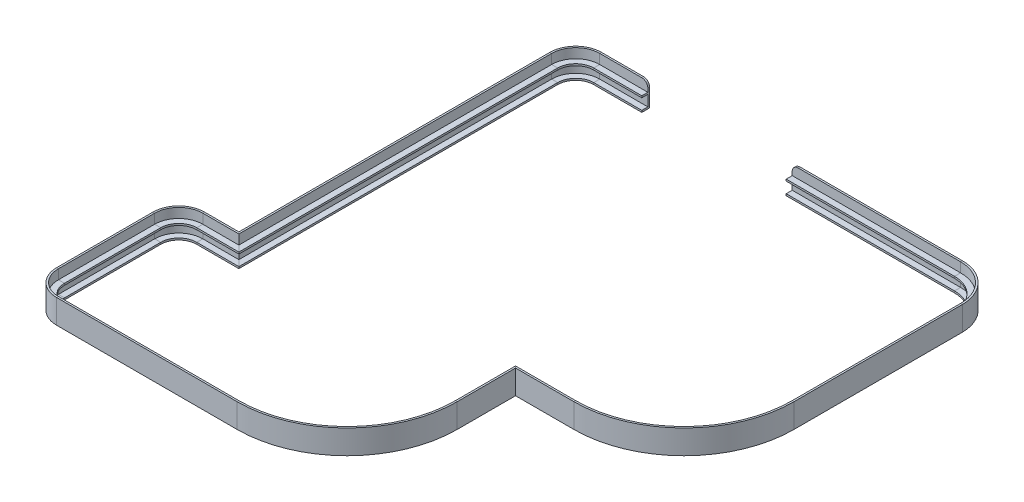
ISO-10303-21;
HEADER;
FILE_DESCRIPTION(('STEP AP214'),'2;1');
FILE_NAME('part.step','',(''),(''),'','','');
FILE_SCHEMA(('AUTOMOTIVE_DESIGN { 1 0 10303 214 1 1 1 1 }'));
ENDSEC;
DATA;
#1=APPLICATION_CONTEXT('core data for automotive mechanical design processes');
#2=APPLICATION_PROTOCOL_DEFINITION('international standard','automotive_design',2000,#1);
#3=PRODUCT_CONTEXT('',#1,'mechanical');
#4=PRODUCT('Part','Part','',(#3));
#5=PRODUCT_RELATED_PRODUCT_CATEGORY('part','',(#4));
#6=PRODUCT_DEFINITION_FORMATION('','',#4);
#7=PRODUCT_DEFINITION_CONTEXT('part definition',#1,'design');
#8=PRODUCT_DEFINITION('design','',#6,#7);
#9=PRODUCT_DEFINITION_SHAPE('','',#8);
#10=(LENGTH_UNIT() NAMED_UNIT(*) SI_UNIT(.MILLI.,.METRE.));
#11=(NAMED_UNIT(*) PLANE_ANGLE_UNIT() SI_UNIT($,.RADIAN.));
#12=(NAMED_UNIT(*) SI_UNIT($,.STERADIAN.) SOLID_ANGLE_UNIT());
#13=UNCERTAINTY_MEASURE_WITH_UNIT(LENGTH_MEASURE(1.E-05),#10,'distance_accuracy_value','');
#14=(GEOMETRIC_REPRESENTATION_CONTEXT(3) GLOBAL_UNCERTAINTY_ASSIGNED_CONTEXT((#13)) GLOBAL_UNIT_ASSIGNED_CONTEXT((#10,
#11,#12)) REPRESENTATION_CONTEXT('',''));
#15=CARTESIAN_POINT('',(0.,0.,0.));
#16=DIRECTION('',(0.,0.,1.));
#17=DIRECTION('',(1.,0.,0.));
#18=AXIS2_PLACEMENT_3D('',#15,#16,#17);
#19=CARTESIAN_POINT('',(-204.999999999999,0.,6.24500451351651E-13));
#20=DIRECTION('',(-1.,0.,0.));
#21=DIRECTION('',(0.,0.,1.));
#22=AXIS2_PLACEMENT_3D('',#19,#20,#21);
#23=PLANE('',#22);
#24=DIRECTION('',(0.,1.,0.));
#25=VECTOR('',#24,1.);
#26=CARTESIAN_POINT('',(-205.000000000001,128.5,-251.499999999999));
#27=LINE('',#26,#25);
#28=CARTESIAN_POINT('',(-205.000000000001,108.5,-251.499999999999));
#29=VERTEX_POINT('',#28);
#30=CARTESIAN_POINT('',(-205.000000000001,123.5,-251.499999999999));
#31=VERTEX_POINT('',#30);
#32=EDGE_CURVE('E1006',#29,#31,#27,.T.);
#33=ORIENTED_EDGE('',*,*,#32,.T.);
#34=DIRECTION('',(0.,0.,1.));
#35=VECTOR('',#34,1.);
#36=CARTESIAN_POINT('',(-205.000000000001,123.5,-249.999999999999));
#37=LINE('',#36,#35);
#38=CARTESIAN_POINT('',(-205.000000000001,123.5,-249.999999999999));
#39=VERTEX_POINT('',#38);
#40=EDGE_CURVE('E1137',#31,#39,#37,.T.);
#41=ORIENTED_EDGE('',*,*,#40,.T.);
#42=DIRECTION('',(0.,-1.,0.));
#43=VECTOR('',#42,1.);
#44=CARTESIAN_POINT('',(-205.000000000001,120.5,-249.999999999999));
#45=LINE('',#44,#43);
#46=CARTESIAN_POINT('',(-205.000000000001,120.5,-249.999999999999));
#47=VERTEX_POINT('',#46);
#48=EDGE_CURVE('E979',#39,#47,#45,.T.);
#49=ORIENTED_EDGE('',*,*,#48,.T.);
#50=DIRECTION('',(0.,0.,1.));
#51=VECTOR('',#50,1.);
#52=CARTESIAN_POINT('',(-205.000000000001,120.5,-244.999999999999));
#53=LINE('',#52,#51);
#54=CARTESIAN_POINT('',(-205.000000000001,120.5,-244.999999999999));
#55=VERTEX_POINT('',#54);
#56=EDGE_CURVE('E1105',#47,#55,#53,.T.);
#57=ORIENTED_EDGE('',*,*,#56,.T.);
#58=DIRECTION('',(0.,-1.,0.));
#59=VECTOR('',#58,1.);
#60=CARTESIAN_POINT('',(-205.000000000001,119.,-244.999999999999));
#61=LINE('',#60,#59);
#62=CARTESIAN_POINT('',(-205.000000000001,119.,-244.999999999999));
#63=VERTEX_POINT('',#62);
#64=EDGE_CURVE('E1091',#55,#63,#61,.T.);
#65=ORIENTED_EDGE('',*,*,#64,.T.);
#66=DIRECTION('',(0.,0.,-1.));
#67=VECTOR('',#66,1.);
#68=CARTESIAN_POINT('',(-205.000000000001,119.,-249.999999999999));
#69=LINE('',#68,#67);
#70=CARTESIAN_POINT('',(-205.000000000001,119.,-249.999999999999));
#71=VERTEX_POINT('',#70);
#72=EDGE_CURVE('E1077',#63,#71,#69,.T.);
#73=ORIENTED_EDGE('',*,*,#72,.T.);
#74=DIRECTION('',(0.,-1.,0.));
#75=VECTOR('',#74,1.);
#76=CARTESIAN_POINT('',(-205.000000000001,110.,-249.999999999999));
#77=LINE('',#76,#75);
#78=CARTESIAN_POINT('',(-205.000000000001,110.,-249.999999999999));
#79=VERTEX_POINT('',#78);
#80=EDGE_CURVE('E1063',#71,#79,#77,.T.);
#81=ORIENTED_EDGE('',*,*,#80,.T.);
#82=DIRECTION('',(0.,0.,1.));
#83=VECTOR('',#82,1.);
#84=CARTESIAN_POINT('',(-205.000000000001,110.,-244.999999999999));
#85=LINE('',#84,#83);
#86=CARTESIAN_POINT('',(-205.000000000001,110.,-244.999999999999));
#87=VERTEX_POINT('',#86);
#88=EDGE_CURVE('E1049',#79,#87,#85,.T.);
#89=ORIENTED_EDGE('',*,*,#88,.T.);
#90=DIRECTION('',(0.,-1.,0.));
#91=VECTOR('',#90,1.);
#92=CARTESIAN_POINT('',(-205.000000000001,108.5,-244.999999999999));
#93=LINE('',#92,#91);
#94=CARTESIAN_POINT('',(-205.000000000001,108.5,-244.999999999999));
#95=VERTEX_POINT('',#94);
#96=EDGE_CURVE('E1035',#87,#95,#93,.T.);
#97=ORIENTED_EDGE('',*,*,#96,.T.);
#98=DIRECTION('',(0.,0.,-1.));
#99=VECTOR('',#98,1.);
#100=CARTESIAN_POINT('',(-205.000000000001,108.5,-251.499999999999));
#101=LINE('',#100,#99);
#102=EDGE_CURVE('E1021',#95,#29,#101,.T.);
#103=ORIENTED_EDGE('',*,*,#102,.T.);
#104=EDGE_LOOP('',(#33,#41,#49,#57,#65,#73,#81,#89,#97,#103));
#105=FACE_BOUND('',#104,.T.);
#106=ADVANCED_FACE('F32',(#105),#23,.F.);
#107=CARTESIAN_POINT('',(-84.9999999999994,0.,-1.52655665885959E-13));
#108=DIRECTION('',(-1.,0.,0.));
#109=DIRECTION('',(0.,0.,1.));
#110=AXIS2_PLACEMENT_3D('',#107,#108,#109);
#111=PLANE('',#110);
#112=DIRECTION('',(0.,-1.,0.));
#113=VECTOR('',#112,1.);
#114=CARTESIAN_POINT('',(-85.0000000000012,120.5,-250.));
#115=LINE('',#114,#113);
#116=CARTESIAN_POINT('',(-85.0000000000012,123.5,-250.));
#117=VERTEX_POINT('',#116);
#118=CARTESIAN_POINT('',(-85.0000000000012,120.5,-250.));
#119=VERTEX_POINT('',#118);
#120=EDGE_CURVE('E1206',#117,#119,#115,.T.);
#121=ORIENTED_EDGE('',*,*,#120,.F.);
#122=DIRECTION('',(0.,0.,1.));
#123=VECTOR('',#122,1.);
#124=CARTESIAN_POINT('',(-84.9999999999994,123.5,-1.52655665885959E-13));
#125=LINE('',#124,#123);
#126=CARTESIAN_POINT('',(-85.0000000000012,123.5,-251.5));
#127=VERTEX_POINT('',#126);
#128=EDGE_CURVE('E40',#117,#127,#125,.F.);
#129=ORIENTED_EDGE('',*,*,#128,.T.);
#130=DIRECTION('',(0.,1.,0.));
#131=VECTOR('',#130,1.);
#132=CARTESIAN_POINT('',(-85.0000000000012,128.5,-251.5));
#133=LINE('',#132,#131);
#134=CARTESIAN_POINT('',(-85.0000000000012,108.5,-251.5));
#135=VERTEX_POINT('',#134);
#136=EDGE_CURVE('E1203',#135,#127,#133,.T.);
#137=ORIENTED_EDGE('',*,*,#136,.F.);
#138=DIRECTION('',(0.,0.,-1.));
#139=VECTOR('',#138,1.);
#140=CARTESIAN_POINT('',(-85.0000000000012,108.5,-251.5));
#141=LINE('',#140,#139);
#142=CARTESIAN_POINT('',(-85.0000000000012,108.5,-245.));
#143=VERTEX_POINT('',#142);
#144=EDGE_CURVE('E1205',#143,#135,#141,.T.);
#145=ORIENTED_EDGE('',*,*,#144,.F.);
#146=DIRECTION('',(0.,-1.,0.));
#147=VECTOR('',#146,1.);
#148=CARTESIAN_POINT('',(-85.0000000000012,108.5,-245.));
#149=LINE('',#148,#147);
#150=CARTESIAN_POINT('',(-85.0000000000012,110.,-245.));
#151=VERTEX_POINT('',#150);
#152=EDGE_CURVE('E1233',#151,#143,#149,.T.);
#153=ORIENTED_EDGE('',*,*,#152,.F.);
#154=DIRECTION('',(0.,0.,1.));
#155=VECTOR('',#154,1.);
#156=CARTESIAN_POINT('',(-85.0000000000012,110.,-245.));
#157=LINE('',#156,#155);
#158=CARTESIAN_POINT('',(-85.0000000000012,110.,-250.));
#159=VERTEX_POINT('',#158);
#160=EDGE_CURVE('E1260',#159,#151,#157,.T.);
#161=ORIENTED_EDGE('',*,*,#160,.F.);
#162=DIRECTION('',(0.,-1.,0.));
#163=VECTOR('',#162,1.);
#164=CARTESIAN_POINT('',(-85.0000000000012,110.,-250.));
#165=LINE('',#164,#163);
#166=CARTESIAN_POINT('',(-85.0000000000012,119.,-250.));
#167=VERTEX_POINT('',#166);
#168=EDGE_CURVE('E1287',#167,#159,#165,.T.);
#169=ORIENTED_EDGE('',*,*,#168,.F.);
#170=DIRECTION('',(0.,0.,-1.));
#171=VECTOR('',#170,1.);
#172=CARTESIAN_POINT('',(-85.0000000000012,119.,-250.));
#173=LINE('',#172,#171);
#174=CARTESIAN_POINT('',(-85.0000000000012,119.,-245.));
#175=VERTEX_POINT('',#174);
#176=EDGE_CURVE('E1314',#175,#167,#173,.T.);
#177=ORIENTED_EDGE('',*,*,#176,.F.);
#178=DIRECTION('',(0.,-1.,0.));
#179=VECTOR('',#178,1.);
#180=CARTESIAN_POINT('',(-85.0000000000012,119.,-245.));
#181=LINE('',#180,#179);
#182=CARTESIAN_POINT('',(-85.0000000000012,120.5,-245.));
#183=VERTEX_POINT('',#182);
#184=EDGE_CURVE('E1340',#183,#175,#181,.T.);
#185=ORIENTED_EDGE('',*,*,#184,.F.);
#186=DIRECTION('',(0.,0.,1.));
#187=VECTOR('',#186,1.);
#188=CARTESIAN_POINT('',(-85.0000000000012,120.5,-245.));
#189=LINE('',#188,#187);
#190=EDGE_CURVE('E1141',#119,#183,#189,.T.);
#191=ORIENTED_EDGE('',*,*,#190,.F.);
#192=EDGE_LOOP('',(#121,#129,#137,#145,#153,#161,#169,#177,#185,#191));
#193=FACE_BOUND('',#192,.T.);
#194=ADVANCED_FACE('F1912',(#193),#111,.T.);
#195=CARTESIAN_POINT('',(-259.999999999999,120.5,35.600000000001));
#196=DIRECTION('',(0.,1.,0.));
#197=DIRECTION('',(0.,0.,-1.));
#198=AXIS2_PLACEMENT_3D('',#195,#196,#197);
#199=PLANE('',#198);
#200=DIRECTION('',(-0.707106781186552,0.,-0.707106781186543));
#201=VECTOR('',#200,1.);
#202=CARTESIAN_POINT('',(-277.499999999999,120.5,17.5000000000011));
#203=LINE('',#202,#201);
#204=CARTESIAN_POINT('',(-259.999999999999,120.5,35.000000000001));
#205=VERTEX_POINT('',#204);
#206=CARTESIAN_POINT('',(-264.999999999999,120.5,30.000000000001));
#207=VERTEX_POINT('',#206);
#208=EDGE_CURVE('E588',#205,#207,#203,.T.);
#209=ORIENTED_EDGE('',*,*,#208,.F.);
#210=DIRECTION('',(0.,0.,-1.));
#211=VECTOR('',#210,1.);
#212=CARTESIAN_POINT('',(-259.999999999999,120.5,35.600000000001));
#213=LINE('',#212,#211);
#214=CARTESIAN_POINT('',(-260.000000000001,120.5,-229.999999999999));
#215=VERTEX_POINT('',#214);
#216=EDGE_CURVE('E1134',#205,#215,#213,.T.);
#217=ORIENTED_EDGE('',*,*,#216,.T.);
#218=DIRECTION('',(1.,0.,0.));
#219=VECTOR('',#218,1.);
#220=CARTESIAN_POINT('',(-260.000000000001,120.5,-229.999999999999));
#221=LINE('',#220,#219);
#222=CARTESIAN_POINT('',(-265.000000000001,120.5,-229.999999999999));
#223=VERTEX_POINT('',#222);
#224=EDGE_CURVE('E1102',#223,#215,#221,.T.);
#225=ORIENTED_EDGE('',*,*,#224,.F.);
#226=DIRECTION('',(0.,0.,-1.));
#227=VECTOR('',#226,1.);
#228=CARTESIAN_POINT('',(-264.999999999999,120.5,35.6000000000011));
#229=LINE('',#228,#227);
#230=EDGE_CURVE('E950',#207,#223,#229,.T.);
#231=ORIENTED_EDGE('',*,*,#230,.F.);
#232=EDGE_LOOP('',(#209,#217,#225,#231));
#233=FACE_BOUND('',#232,.T.);
#234=ADVANCED_FACE('F1908',(#233),#199,.T.);
#235=CARTESIAN_POINT('',(-259.999999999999,119.,35.600000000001));
#236=DIRECTION('',(1.,0.,0.));
#237=DIRECTION('',(0.,0.,-1.));
#238=AXIS2_PLACEMENT_3D('',#235,#236,#237);
#239=PLANE('',#238);
#240=DIRECTION('',(0.,1.,0.));
#241=VECTOR('',#240,1.);
#242=CARTESIAN_POINT('',(-259.999999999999,119.,35.000000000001));
#243=LINE('',#242,#241);
#244=CARTESIAN_POINT('',(-259.999999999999,119.,35.000000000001));
#245=VERTEX_POINT('',#244);
#246=EDGE_CURVE('E947',#245,#205,#243,.T.);
#247=ORIENTED_EDGE('',*,*,#246,.F.);
#248=DIRECTION('',(0.,0.,-1.));
#249=VECTOR('',#248,1.);
#250=CARTESIAN_POINT('',(-259.999999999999,119.,35.600000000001));
#251=LINE('',#250,#249);
#252=CARTESIAN_POINT('',(-260.000000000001,119.,-229.999999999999));
#253=VERTEX_POINT('',#252);
#254=EDGE_CURVE('E1132',#245,#253,#251,.T.);
#255=ORIENTED_EDGE('',*,*,#254,.T.);
#256=DIRECTION('',(0.,-1.,0.));
#257=VECTOR('',#256,1.);
#258=CARTESIAN_POINT('',(-260.000000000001,119.,-229.999999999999));
#259=LINE('',#258,#257);
#260=EDGE_CURVE('E1088',#215,#253,#259,.T.);
#261=ORIENTED_EDGE('',*,*,#260,.F.);
#262=ORIENTED_EDGE('',*,*,#216,.F.);
#263=EDGE_LOOP('',(#247,#255,#261,#262));
#264=FACE_BOUND('',#263,.T.);
#265=ADVANCED_FACE('F1911',(#264),#239,.T.);
#266=CARTESIAN_POINT('',(-264.999999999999,119.,35.6000000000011));
#267=DIRECTION('',(0.,-1.,0.));
#268=DIRECTION('',(0.,0.,1.));
#269=AXIS2_PLACEMENT_3D('',#266,#267,#268);
#270=PLANE('',#269);
#271=DIRECTION('',(0.707106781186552,0.,0.707106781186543));
#272=VECTOR('',#271,1.);
#273=CARTESIAN_POINT('',(-279.999999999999,119.,15.0000000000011));
#274=LINE('',#273,#272);
#275=CARTESIAN_POINT('',(-264.999999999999,119.,30.000000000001));
#276=VERTEX_POINT('',#275);
#277=EDGE_CURVE('E944',#276,#245,#274,.T.);
#278=ORIENTED_EDGE('',*,*,#277,.F.);
#279=DIRECTION('',(0.,0.,-1.));
#280=VECTOR('',#279,1.);
#281=CARTESIAN_POINT('',(-264.999999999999,119.,35.6000000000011));
#282=LINE('',#281,#280);
#283=CARTESIAN_POINT('',(-265.000000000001,119.,-229.999999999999));
#284=VERTEX_POINT('',#283);
#285=EDGE_CURVE('E1130',#276,#284,#282,.T.);
#286=ORIENTED_EDGE('',*,*,#285,.T.);
#287=DIRECTION('',(-1.,0.,0.));
#288=VECTOR('',#287,1.);
#289=CARTESIAN_POINT('',(-265.000000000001,119.,-229.999999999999));
#290=LINE('',#289,#288);
#291=EDGE_CURVE('E1074',#253,#284,#290,.T.);
#292=ORIENTED_EDGE('',*,*,#291,.F.);
#293=ORIENTED_EDGE('',*,*,#254,.F.);
#294=EDGE_LOOP('',(#278,#286,#292,#293));
#295=FACE_BOUND('',#294,.T.);
#296=ADVANCED_FACE('F1916',(#295),#270,.T.);
#297=CARTESIAN_POINT('',(-264.999999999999,110.,35.6000000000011));
#298=DIRECTION('',(1.,0.,0.));
#299=DIRECTION('',(0.,0.,-1.));
#300=AXIS2_PLACEMENT_3D('',#297,#298,#299);
#301=PLANE('',#300);
#302=DIRECTION('',(0.,1.,0.));
#303=VECTOR('',#302,1.);
#304=CARTESIAN_POINT('',(-264.999999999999,110.,30.000000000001));
#305=LINE('',#304,#303);
#306=CARTESIAN_POINT('',(-264.999999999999,110.,30.000000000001));
#307=VERTEX_POINT('',#306);
#308=EDGE_CURVE('E941',#307,#276,#305,.T.);
#309=ORIENTED_EDGE('',*,*,#308,.F.);
#310=DIRECTION('',(0.,0.,-1.));
#311=VECTOR('',#310,1.);
#312=CARTESIAN_POINT('',(-264.999999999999,110.,35.6000000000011));
#313=LINE('',#312,#311);
#314=CARTESIAN_POINT('',(-265.000000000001,110.,-229.999999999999));
#315=VERTEX_POINT('',#314);
#316=EDGE_CURVE('E1128',#307,#315,#313,.T.);
#317=ORIENTED_EDGE('',*,*,#316,.T.);
#318=DIRECTION('',(0.,-1.,0.));
#319=VECTOR('',#318,1.);
#320=CARTESIAN_POINT('',(-265.000000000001,110.,-229.999999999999));
#321=LINE('',#320,#319);
#322=EDGE_CURVE('E1060',#284,#315,#321,.T.);
#323=ORIENTED_EDGE('',*,*,#322,.F.);
#324=ORIENTED_EDGE('',*,*,#285,.F.);
#325=EDGE_LOOP('',(#309,#317,#323,#324));
#326=FACE_BOUND('',#325,.T.);
#327=ADVANCED_FACE('F1920',(#326),#301,.T.);
#328=CARTESIAN_POINT('',(-259.999999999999,110.,35.600000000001));
#329=DIRECTION('',(0.,1.,0.));
#330=DIRECTION('',(0.,0.,-1.));
#331=AXIS2_PLACEMENT_3D('',#328,#329,#330);
#332=PLANE('',#331);
#333=DIRECTION('',(-0.707106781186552,0.,-0.707106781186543));
#334=VECTOR('',#333,1.);
#335=CARTESIAN_POINT('',(-277.499999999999,110.,17.5000000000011));
#336=LINE('',#335,#334);
#337=CARTESIAN_POINT('',(-259.999999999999,110.,35.000000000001));
#338=VERTEX_POINT('',#337);
#339=EDGE_CURVE('E938',#338,#307,#336,.T.);
#340=ORIENTED_EDGE('',*,*,#339,.F.);
#341=DIRECTION('',(0.,0.,-1.));
#342=VECTOR('',#341,1.);
#343=CARTESIAN_POINT('',(-259.999999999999,110.,35.600000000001));
#344=LINE('',#343,#342);
#345=CARTESIAN_POINT('',(-260.000000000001,110.,-229.999999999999));
#346=VERTEX_POINT('',#345);
#347=EDGE_CURVE('E1126',#338,#346,#344,.T.);
#348=ORIENTED_EDGE('',*,*,#347,.T.);
#349=DIRECTION('',(1.,0.,0.));
#350=VECTOR('',#349,1.);
#351=CARTESIAN_POINT('',(-260.000000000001,110.,-229.999999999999));
#352=LINE('',#351,#350);
#353=EDGE_CURVE('E1046',#315,#346,#352,.T.);
#354=ORIENTED_EDGE('',*,*,#353,.F.);
#355=ORIENTED_EDGE('',*,*,#316,.F.);
#356=EDGE_LOOP('',(#340,#348,#354,#355));
#357=FACE_BOUND('',#356,.T.);
#358=ADVANCED_FACE('F1924',(#357),#332,.T.);
#359=CARTESIAN_POINT('',(-259.999999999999,108.5,35.600000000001));
#360=DIRECTION('',(1.,0.,0.));
#361=DIRECTION('',(0.,0.,-1.));
#362=AXIS2_PLACEMENT_3D('',#359,#360,#361);
#363=PLANE('',#362);
#364=DIRECTION('',(0.,1.,0.));
#365=VECTOR('',#364,1.);
#366=CARTESIAN_POINT('',(-259.999999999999,108.5,35.000000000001));
#367=LINE('',#366,#365);
#368=CARTESIAN_POINT('',(-259.999999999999,108.5,35.000000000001));
#369=VERTEX_POINT('',#368);
#370=EDGE_CURVE('E935',#369,#338,#367,.T.);
#371=ORIENTED_EDGE('',*,*,#370,.F.);
#372=DIRECTION('',(0.,0.,-1.));
#373=VECTOR('',#372,1.);
#374=CARTESIAN_POINT('',(-259.999999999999,108.5,35.600000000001));
#375=LINE('',#374,#373);
#376=CARTESIAN_POINT('',(-260.000000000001,108.5,-229.999999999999));
#377=VERTEX_POINT('',#376);
#378=EDGE_CURVE('E1124',#369,#377,#375,.T.);
#379=ORIENTED_EDGE('',*,*,#378,.T.);
#380=DIRECTION('',(0.,-1.,0.));
#381=VECTOR('',#380,1.);
#382=CARTESIAN_POINT('',(-260.000000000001,108.5,-229.999999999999));
#383=LINE('',#382,#381);
#384=EDGE_CURVE('E1032',#346,#377,#383,.T.);
#385=ORIENTED_EDGE('',*,*,#384,.F.);
#386=ORIENTED_EDGE('',*,*,#347,.F.);
#387=EDGE_LOOP('',(#371,#379,#385,#386));
#388=FACE_BOUND('',#387,.T.);
#389=ADVANCED_FACE('F1928',(#388),#363,.T.);
#390=CARTESIAN_POINT('',(-266.499999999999,108.5,35.6000000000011));
#391=DIRECTION('',(0.,-1.,0.));
#392=DIRECTION('',(0.,0.,1.));
#393=AXIS2_PLACEMENT_3D('',#390,#391,#392);
#394=PLANE('',#393);
#395=DIRECTION('',(0.707106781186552,0.,0.707106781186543));
#396=VECTOR('',#395,1.);
#397=CARTESIAN_POINT('',(-280.749999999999,108.5,14.2500000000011));
#398=LINE('',#397,#396);
#399=CARTESIAN_POINT('',(-266.499999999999,108.5,28.500000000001));
#400=VERTEX_POINT('',#399);
#401=EDGE_CURVE('E932',#400,#369,#398,.T.);
#402=ORIENTED_EDGE('',*,*,#401,.F.);
#403=DIRECTION('',(0.,0.,-1.));
#404=VECTOR('',#403,1.);
#405=CARTESIAN_POINT('',(-266.499999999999,108.5,35.6000000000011));
#406=LINE('',#405,#404);
#407=CARTESIAN_POINT('',(-266.500000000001,108.5,-229.999999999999));
#408=VERTEX_POINT('',#407);
#409=EDGE_CURVE('E1122',#400,#408,#406,.T.);
#410=ORIENTED_EDGE('',*,*,#409,.T.);
#411=DIRECTION('',(-1.,0.,0.));
#412=VECTOR('',#411,1.);
#413=CARTESIAN_POINT('',(-266.500000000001,108.5,-229.999999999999));
#414=LINE('',#413,#412);
#415=EDGE_CURVE('E1018',#377,#408,#414,.T.);
#416=ORIENTED_EDGE('',*,*,#415,.F.);
#417=ORIENTED_EDGE('',*,*,#378,.F.);
#418=EDGE_LOOP('',(#402,#410,#416,#417));
#419=FACE_BOUND('',#418,.T.);
#420=ADVANCED_FACE('F1932',(#419),#394,.T.);
#421=CARTESIAN_POINT('',(-266.499999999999,128.5,35.6000000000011));
#422=DIRECTION('',(-1.,0.,0.));
#423=DIRECTION('',(0.,0.,1.));
#424=AXIS2_PLACEMENT_3D('',#421,#422,#423);
#425=PLANE('',#424);
#426=DIRECTION('',(0.,-1.,0.));
#427=VECTOR('',#426,1.);
#428=CARTESIAN_POINT('',(-266.499999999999,128.5,28.500000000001));
#429=LINE('',#428,#427);
#430=CARTESIAN_POINT('',(-266.499999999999,128.5,28.500000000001));
#431=VERTEX_POINT('',#430);
#432=EDGE_CURVE('E929',#431,#400,#429,.T.);
#433=ORIENTED_EDGE('',*,*,#432,.F.);
#434=DIRECTION('',(0.,0.,-1.));
#435=VECTOR('',#434,1.);
#436=CARTESIAN_POINT('',(-266.499999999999,128.5,35.6000000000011));
#437=LINE('',#436,#435);
#438=CARTESIAN_POINT('',(-266.500000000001,128.5,-229.999999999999));
#439=VERTEX_POINT('',#438);
#440=EDGE_CURVE('E1120',#431,#439,#437,.T.);
#441=ORIENTED_EDGE('',*,*,#440,.T.);
#442=DIRECTION('',(0.,1.,0.));
#443=VECTOR('',#442,1.);
#444=CARTESIAN_POINT('',(-266.500000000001,128.5,-229.999999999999));
#445=LINE('',#444,#443);
#446=EDGE_CURVE('E1003',#408,#439,#445,.T.);
#447=ORIENTED_EDGE('',*,*,#446,.F.);
#448=ORIENTED_EDGE('',*,*,#409,.F.);
#449=EDGE_LOOP('',(#433,#441,#447,#448));
#450=FACE_BOUND('',#449,.T.);
#451=ADVANCED_FACE('F1936',(#450),#425,.T.);
#452=CARTESIAN_POINT('',(-264.999999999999,128.5,35.6000000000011));
#453=DIRECTION('',(0.,1.,0.));
#454=DIRECTION('',(0.,0.,-1.));
#455=AXIS2_PLACEMENT_3D('',#452,#453,#454);
#456=PLANE('',#455);
#457=DIRECTION('',(-0.707106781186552,0.,-0.707106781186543));
#458=VECTOR('',#457,1.);
#459=CARTESIAN_POINT('',(-279.999999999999,128.5,15.0000000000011));
#460=LINE('',#459,#458);
#461=CARTESIAN_POINT('',(-264.999999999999,128.5,30.000000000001));
#462=VERTEX_POINT('',#461);
#463=EDGE_CURVE('E926',#462,#431,#460,.T.);
#464=ORIENTED_EDGE('',*,*,#463,.F.);
#465=DIRECTION('',(0.,0.,-1.));
#466=VECTOR('',#465,1.);
#467=CARTESIAN_POINT('',(-264.999999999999,128.5,35.6000000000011));
#468=LINE('',#467,#466);
#469=CARTESIAN_POINT('',(-265.000000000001,128.5,-229.999999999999));
#470=VERTEX_POINT('',#469);
#471=EDGE_CURVE('E1118',#462,#470,#468,.T.);
#472=ORIENTED_EDGE('',*,*,#471,.T.);
#473=DIRECTION('',(1.,0.,0.));
#474=VECTOR('',#473,1.);
#475=CARTESIAN_POINT('',(-265.000000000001,128.5,-229.999999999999));
#476=LINE('',#475,#474);
#477=EDGE_CURVE('E990',#439,#470,#476,.T.);
#478=ORIENTED_EDGE('',*,*,#477,.F.);
#479=ORIENTED_EDGE('',*,*,#440,.F.);
#480=EDGE_LOOP('',(#464,#472,#478,#479));
#481=FACE_BOUND('',#480,.T.);
#482=ADVANCED_FACE('F1940',(#481),#456,.T.);
#483=CARTESIAN_POINT('',(-264.999999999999,120.5,35.6000000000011));
#484=DIRECTION('',(1.,0.,0.));
#485=DIRECTION('',(0.,0.,-1.));
#486=AXIS2_PLACEMENT_3D('',#483,#484,#485);
#487=PLANE('',#486);
#488=DIRECTION('',(0.,1.,0.));
#489=VECTOR('',#488,1.);
#490=CARTESIAN_POINT('',(-264.999999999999,120.5,30.000000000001));
#491=LINE('',#490,#489);
#492=EDGE_CURVE('E923',#207,#462,#491,.T.);
#493=ORIENTED_EDGE('',*,*,#492,.F.);
#494=ORIENTED_EDGE('',*,*,#230,.T.);
#495=DIRECTION('',(0.,-1.,0.));
#496=VECTOR('',#495,1.);
#497=CARTESIAN_POINT('',(-265.000000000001,120.5,-229.999999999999));
#498=LINE('',#497,#496);
#499=EDGE_CURVE('E987',#470,#223,#498,.T.);
#500=ORIENTED_EDGE('',*,*,#499,.F.);
#501=ORIENTED_EDGE('',*,*,#471,.F.);
#502=EDGE_LOOP('',(#493,#494,#500,#501));
#503=FACE_BOUND('',#502,.T.);
#504=ADVANCED_FACE('F1906',(#503),#487,.T.);
#505=CARTESIAN_POINT('',(-260.000000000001,120.5,-229.999999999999));
#506=DIRECTION('',(0.,1.,0.));
#507=DIRECTION('',(0.,0.,-1.));
#508=AXIS2_PLACEMENT_3D('',#505,#506,#507);
#509=PLANE('',#508);
#510=CARTESIAN_POINT('',(-245.000000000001,120.5,-229.999999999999));
#511=DIRECTION('',(0.,-1.,0.));
#512=DIRECTION('',(-1.,0.,0.));
#513=AXIS2_PLACEMENT_3D('',#510,#511,#512);
#514=CIRCLE('',#513,14.9999999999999);
#515=CARTESIAN_POINT('',(-245.000000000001,120.5,-244.999999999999));
#516=VERTEX_POINT('',#515);
#517=EDGE_CURVE('E1099',#215,#516,#514,.T.);
#518=ORIENTED_EDGE('',*,*,#517,.T.);
#519=DIRECTION('',(0.,0.,1.));
#520=VECTOR('',#519,1.);
#521=CARTESIAN_POINT('',(-245.000000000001,120.5,-244.999999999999));
#522=LINE('',#521,#520);
#523=CARTESIAN_POINT('',(-245.000000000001,120.5,-249.999999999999));
#524=VERTEX_POINT('',#523);
#525=EDGE_CURVE('E1111',#524,#516,#522,.T.);
#526=ORIENTED_EDGE('',*,*,#525,.F.);
#527=CARTESIAN_POINT('',(-245.000000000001,120.5,-229.999999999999));
#528=DIRECTION('',(0.,-1.,0.));
#529=DIRECTION('',(-1.,0.,0.));
#530=AXIS2_PLACEMENT_3D('',#527,#528,#529);
#531=CIRCLE('',#530,19.9999999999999);
#532=EDGE_CURVE('E991',#223,#524,#531,.T.);
#533=ORIENTED_EDGE('',*,*,#532,.F.);
#534=ORIENTED_EDGE('',*,*,#224,.T.);
#535=EDGE_LOOP('',(#518,#526,#533,#534));
#536=FACE_BOUND('',#535,.T.);
#537=ADVANCED_FACE('F1899',(#536),#509,.T.);
#538=CARTESIAN_POINT('',(-245.000000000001,119.,-229.999999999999));
#539=DIRECTION('',(0.,-1.,0.));
#540=DIRECTION('',(0.,0.,1.));
#541=AXIS2_PLACEMENT_3D('',#538,#539,#540);
#542=CYLINDRICAL_SURFACE('',#541,14.9999999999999);
#543=CARTESIAN_POINT('',(-245.000000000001,119.,-229.999999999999));
#544=DIRECTION('',(0.,-1.,0.));
#545=DIRECTION('',(-1.,0.,0.));
#546=AXIS2_PLACEMENT_3D('',#543,#544,#545);
#547=CIRCLE('',#546,14.9999999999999);
#548=CARTESIAN_POINT('',(-245.000000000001,119.,-244.999999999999));
#549=VERTEX_POINT('',#548);
#550=EDGE_CURVE('E1085',#253,#549,#547,.T.);
#551=ORIENTED_EDGE('',*,*,#550,.T.);
#552=DIRECTION('',(0.,-1.,0.));
#553=VECTOR('',#552,1.);
#554=CARTESIAN_POINT('',(-245.000000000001,119.,-244.999999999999));
#555=LINE('',#554,#553);
#556=EDGE_CURVE('E1096',#516,#549,#555,.T.);
#557=ORIENTED_EDGE('',*,*,#556,.F.);
#558=ORIENTED_EDGE('',*,*,#517,.F.);
#559=ORIENTED_EDGE('',*,*,#260,.T.);
#560=EDGE_LOOP('',(#551,#557,#558,#559));
#561=FACE_BOUND('',#560,.T.);
#562=ADVANCED_FACE('F1892',(#561),#542,.F.);
#563=CARTESIAN_POINT('',(-265.000000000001,119.,-229.999999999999));
#564=DIRECTION('',(0.,-1.,0.));
#565=DIRECTION('',(0.,0.,1.));
#566=AXIS2_PLACEMENT_3D('',#563,#564,#565);
#567=PLANE('',#566);
#568=CARTESIAN_POINT('',(-245.000000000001,119.,-229.999999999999));
#569=DIRECTION('',(0.,-1.,0.));
#570=DIRECTION('',(-1.,0.,0.));
#571=AXIS2_PLACEMENT_3D('',#568,#569,#570);
#572=CIRCLE('',#571,19.9999999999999);
#573=CARTESIAN_POINT('',(-245.000000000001,119.,-249.999999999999));
#574=VERTEX_POINT('',#573);
#575=EDGE_CURVE('E1071',#284,#574,#572,.T.);
#576=ORIENTED_EDGE('',*,*,#575,.T.);
#577=DIRECTION('',(0.,0.,-1.));
#578=VECTOR('',#577,1.);
#579=CARTESIAN_POINT('',(-245.000000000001,119.,-249.999999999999));
#580=LINE('',#579,#578);
#581=EDGE_CURVE('E1082',#549,#574,#580,.T.);
#582=ORIENTED_EDGE('',*,*,#581,.F.);
#583=ORIENTED_EDGE('',*,*,#550,.F.);
#584=ORIENTED_EDGE('',*,*,#291,.T.);
#585=EDGE_LOOP('',(#576,#582,#583,#584));
#586=FACE_BOUND('',#585,.T.);
#587=ADVANCED_FACE('F1884',(#586),#567,.T.);
#588=CARTESIAN_POINT('',(-245.000000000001,119.,-229.999999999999));
#589=DIRECTION('',(0.,-1.,0.));
#590=DIRECTION('',(0.,0.,1.));
#591=AXIS2_PLACEMENT_3D('',#588,#589,#590);
#592=CYLINDRICAL_SURFACE('',#591,19.9999999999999);
#593=CARTESIAN_POINT('',(-245.000000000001,110.,-229.999999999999));
#594=DIRECTION('',(0.,-1.,0.));
#595=DIRECTION('',(-1.,0.,0.));
#596=AXIS2_PLACEMENT_3D('',#593,#594,#595);
#597=CIRCLE('',#596,19.9999999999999);
#598=CARTESIAN_POINT('',(-245.000000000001,110.,-249.999999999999));
#599=VERTEX_POINT('',#598);
#600=EDGE_CURVE('E1057',#315,#599,#597,.T.);
#601=ORIENTED_EDGE('',*,*,#600,.T.);
#602=DIRECTION('',(0.,-1.,0.));
#603=VECTOR('',#602,1.);
#604=CARTESIAN_POINT('',(-245.000000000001,110.,-249.999999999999));
#605=LINE('',#604,#603);
#606=EDGE_CURVE('E1068',#574,#599,#605,.T.);
#607=ORIENTED_EDGE('',*,*,#606,.F.);
#608=ORIENTED_EDGE('',*,*,#575,.F.);
#609=ORIENTED_EDGE('',*,*,#322,.T.);
#610=EDGE_LOOP('',(#601,#607,#608,#609));
#611=FACE_BOUND('',#610,.T.);
#612=ADVANCED_FACE('F1876',(#611),#592,.F.);
#613=CARTESIAN_POINT('',(-260.000000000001,110.,-229.999999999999));
#614=DIRECTION('',(0.,1.,0.));
#615=DIRECTION('',(0.,0.,-1.));
#616=AXIS2_PLACEMENT_3D('',#613,#614,#615);
#617=PLANE('',#616);
#618=CARTESIAN_POINT('',(-245.000000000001,110.,-229.999999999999));
#619=DIRECTION('',(0.,-1.,0.));
#620=DIRECTION('',(-1.,0.,0.));
#621=AXIS2_PLACEMENT_3D('',#618,#619,#620);
#622=CIRCLE('',#621,14.9999999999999);
#623=CARTESIAN_POINT('',(-245.000000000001,110.,-244.999999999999));
#624=VERTEX_POINT('',#623);
#625=EDGE_CURVE('E1043',#346,#624,#622,.T.);
#626=ORIENTED_EDGE('',*,*,#625,.T.);
#627=DIRECTION('',(0.,0.,1.));
#628=VECTOR('',#627,1.);
#629=CARTESIAN_POINT('',(-245.000000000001,110.,-244.999999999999));
#630=LINE('',#629,#628);
#631=EDGE_CURVE('E1054',#599,#624,#630,.T.);
#632=ORIENTED_EDGE('',*,*,#631,.F.);
#633=ORIENTED_EDGE('',*,*,#600,.F.);
#634=ORIENTED_EDGE('',*,*,#353,.T.);
#635=EDGE_LOOP('',(#626,#632,#633,#634));
#636=FACE_BOUND('',#635,.T.);
#637=ADVANCED_FACE('F1868',(#636),#617,.T.);
#638=CARTESIAN_POINT('',(-245.000000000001,119.,-229.999999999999));
#639=DIRECTION('',(0.,-1.,0.));
#640=DIRECTION('',(0.,0.,1.));
#641=AXIS2_PLACEMENT_3D('',#638,#639,#640);
#642=CYLINDRICAL_SURFACE('',#641,14.9999999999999);
#643=CARTESIAN_POINT('',(-245.000000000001,108.5,-229.999999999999));
#644=DIRECTION('',(0.,-1.,0.));
#645=DIRECTION('',(-1.,0.,0.));
#646=AXIS2_PLACEMENT_3D('',#643,#644,#645);
#647=CIRCLE('',#646,14.9999999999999);
#648=CARTESIAN_POINT('',(-245.000000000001,108.5,-244.999999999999));
#649=VERTEX_POINT('',#648);
#650=EDGE_CURVE('E1029',#377,#649,#647,.T.);
#651=ORIENTED_EDGE('',*,*,#650,.T.);
#652=DIRECTION('',(0.,-1.,0.));
#653=VECTOR('',#652,1.);
#654=CARTESIAN_POINT('',(-245.000000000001,108.5,-244.999999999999));
#655=LINE('',#654,#653);
#656=EDGE_CURVE('E1040',#624,#649,#655,.T.);
#657=ORIENTED_EDGE('',*,*,#656,.F.);
#658=ORIENTED_EDGE('',*,*,#625,.F.);
#659=ORIENTED_EDGE('',*,*,#384,.T.);
#660=EDGE_LOOP('',(#651,#657,#658,#659));
#661=FACE_BOUND('',#660,.T.);
#662=ADVANCED_FACE('F1860',(#661),#642,.F.);
#663=CARTESIAN_POINT('',(-266.500000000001,108.5,-229.999999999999));
#664=DIRECTION('',(0.,-1.,0.));
#665=DIRECTION('',(0.,0.,1.));
#666=AXIS2_PLACEMENT_3D('',#663,#664,#665);
#667=PLANE('',#666);
#668=CARTESIAN_POINT('',(-245.000000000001,108.5,-229.999999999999));
#669=DIRECTION('',(0.,-1.,0.));
#670=DIRECTION('',(-1.,0.,0.));
#671=AXIS2_PLACEMENT_3D('',#668,#669,#670);
#672=CIRCLE('',#671,21.5);
#673=CARTESIAN_POINT('',(-245.000000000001,108.5,-251.499999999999));
#674=VERTEX_POINT('',#673);
#675=EDGE_CURVE('E1015',#408,#674,#672,.T.);
#676=ORIENTED_EDGE('',*,*,#675,.T.);
#677=DIRECTION('',(0.,0.,-1.));
#678=VECTOR('',#677,1.);
#679=CARTESIAN_POINT('',(-245.000000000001,108.5,-251.499999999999));
#680=LINE('',#679,#678);
#681=EDGE_CURVE('E1026',#649,#674,#680,.T.);
#682=ORIENTED_EDGE('',*,*,#681,.F.);
#683=ORIENTED_EDGE('',*,*,#650,.F.);
#684=ORIENTED_EDGE('',*,*,#415,.T.);
#685=EDGE_LOOP('',(#676,#682,#683,#684));
#686=FACE_BOUND('',#685,.T.);
#687=ADVANCED_FACE('F1852',(#686),#667,.T.);
#688=CARTESIAN_POINT('',(-245.000000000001,119.,-229.999999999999));
#689=DIRECTION('',(0.,-1.,0.));
#690=DIRECTION('',(0.,0.,1.));
#691=AXIS2_PLACEMENT_3D('',#688,#689,#690);
#692=CYLINDRICAL_SURFACE('',#691,21.5);
#693=CARTESIAN_POINT('',(-245.000000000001,128.5,-229.999999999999));
#694=DIRECTION('',(0.,-1.,0.));
#695=DIRECTION('',(-1.,0.,0.));
#696=AXIS2_PLACEMENT_3D('',#693,#694,#695);
#697=CIRCLE('',#696,21.5);
#698=CARTESIAN_POINT('',(-245.000000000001,128.5,-251.499999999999));
#699=VERTEX_POINT('',#698);
#700=EDGE_CURVE('E1000',#439,#699,#697,.T.);
#701=ORIENTED_EDGE('',*,*,#700,.T.);
#702=DIRECTION('',(0.,1.,0.));
#703=VECTOR('',#702,1.);
#704=CARTESIAN_POINT('',(-245.000000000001,128.5,-251.499999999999));
#705=LINE('',#704,#703);
#706=EDGE_CURVE('E1012',#674,#699,#705,.T.);
#707=ORIENTED_EDGE('',*,*,#706,.F.);
#708=ORIENTED_EDGE('',*,*,#675,.F.);
#709=ORIENTED_EDGE('',*,*,#446,.T.);
#710=EDGE_LOOP('',(#701,#707,#708,#709));
#711=FACE_BOUND('',#710,.T.);
#712=ADVANCED_FACE('F1844',(#711),#692,.T.);
#713=CARTESIAN_POINT('',(-265.000000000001,128.5,-229.999999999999));
#714=DIRECTION('',(0.,1.,0.));
#715=DIRECTION('',(0.,0.,-1.));
#716=AXIS2_PLACEMENT_3D('',#713,#714,#715);
#717=PLANE('',#716);
#718=CARTESIAN_POINT('',(-245.000000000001,128.5,-229.999999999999));
#719=DIRECTION('',(0.,-1.,0.));
#720=DIRECTION('',(-1.,0.,0.));
#721=AXIS2_PLACEMENT_3D('',#718,#719,#720);
#722=CIRCLE('',#721,19.9999999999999);
#723=CARTESIAN_POINT('',(-245.000000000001,128.5,-249.999999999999));
#724=VERTEX_POINT('',#723);
#725=EDGE_CURVE('E985',#470,#724,#722,.T.);
#726=ORIENTED_EDGE('',*,*,#725,.T.);
#727=DIRECTION('',(0.,0.,1.));
#728=VECTOR('',#727,1.);
#729=CARTESIAN_POINT('',(-245.000000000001,128.5,-249.999999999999));
#730=LINE('',#729,#728);
#731=EDGE_CURVE('E997',#699,#724,#730,.T.);
#732=ORIENTED_EDGE('',*,*,#731,.F.);
#733=ORIENTED_EDGE('',*,*,#700,.F.);
#734=ORIENTED_EDGE('',*,*,#477,.T.);
#735=EDGE_LOOP('',(#726,#732,#733,#734));
#736=FACE_BOUND('',#735,.T.);
#737=ADVANCED_FACE('F1836',(#736),#717,.T.);
#738=CARTESIAN_POINT('',(-245.000000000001,119.,-229.999999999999));
#739=DIRECTION('',(0.,-1.,0.));
#740=DIRECTION('',(0.,0.,1.));
#741=AXIS2_PLACEMENT_3D('',#738,#739,#740);
#742=CYLINDRICAL_SURFACE('',#741,19.9999999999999);
#743=DIRECTION('',(0.,-1.,0.));
#744=VECTOR('',#743,1.);
#745=CARTESIAN_POINT('',(-245.000000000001,120.5,-249.999999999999));
#746=LINE('',#745,#744);
#747=EDGE_CURVE('E982',#724,#524,#746,.T.);
#748=ORIENTED_EDGE('',*,*,#747,.F.);
#749=ORIENTED_EDGE('',*,*,#725,.F.);
#750=ORIENTED_EDGE('',*,*,#499,.T.);
#751=ORIENTED_EDGE('',*,*,#532,.T.);
#752=EDGE_LOOP('',(#748,#749,#750,#751));
#753=FACE_BOUND('',#752,.T.);
#754=ADVANCED_FACE('F1832',(#753),#742,.F.);
#755=CARTESIAN_POINT('',(-245.000000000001,120.5,-244.999999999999));
#756=DIRECTION('',(0.,1.,0.));
#757=DIRECTION('',(0.,0.,-1.));
#758=AXIS2_PLACEMENT_3D('',#755,#756,#757);
#759=PLANE('',#758);
#760=DIRECTION('',(1.,0.,0.));
#761=VECTOR('',#760,1.);
#762=CARTESIAN_POINT('',(-245.000000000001,120.5,-244.999999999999));
#763=LINE('',#762,#761);
#764=EDGE_CURVE('E1093',#516,#55,#763,.T.);
#765=ORIENTED_EDGE('',*,*,#764,.T.);
#766=ORIENTED_EDGE('',*,*,#56,.F.);
#767=DIRECTION('',(1.,0.,0.));
#768=VECTOR('',#767,1.);
#769=CARTESIAN_POINT('',(-245.000000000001,120.5,-249.999999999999));
#770=LINE('',#769,#768);
#771=EDGE_CURVE('E986',#524,#47,#770,.T.);
#772=ORIENTED_EDGE('',*,*,#771,.F.);
#773=ORIENTED_EDGE('',*,*,#525,.T.);
#774=EDGE_LOOP('',(#765,#766,#772,#773));
#775=FACE_BOUND('',#774,.T.);
#776=ADVANCED_FACE('F1835',(#775),#759,.T.);
#777=CARTESIAN_POINT('',(-245.000000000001,119.,-244.999999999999));
#778=DIRECTION('',(0.,0.,1.));
#779=DIRECTION('',(1.,0.,0.));
#780=AXIS2_PLACEMENT_3D('',#777,#778,#779);
#781=PLANE('',#780);
#782=DIRECTION('',(1.,0.,0.));
#783=VECTOR('',#782,1.);
#784=CARTESIAN_POINT('',(-245.000000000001,119.,-244.999999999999));
#785=LINE('',#784,#783);
#786=EDGE_CURVE('E1079',#549,#63,#785,.T.);
#787=ORIENTED_EDGE('',*,*,#786,.T.);
#788=ORIENTED_EDGE('',*,*,#64,.F.);
#789=ORIENTED_EDGE('',*,*,#764,.F.);
#790=ORIENTED_EDGE('',*,*,#556,.T.);
#791=EDGE_LOOP('',(#787,#788,#789,#790));
#792=FACE_BOUND('',#791,.T.);
#793=ADVANCED_FACE('F1888',(#792),#781,.T.);
#794=CARTESIAN_POINT('',(-245.000000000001,119.,-249.999999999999));
#795=DIRECTION('',(0.,-1.,0.));
#796=DIRECTION('',(0.,0.,1.));
#797=AXIS2_PLACEMENT_3D('',#794,#795,#796);
#798=PLANE('',#797);
#799=DIRECTION('',(1.,0.,0.));
#800=VECTOR('',#799,1.);
#801=CARTESIAN_POINT('',(-245.000000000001,119.,-249.999999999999));
#802=LINE('',#801,#800);
#803=EDGE_CURVE('E1065',#574,#71,#802,.T.);
#804=ORIENTED_EDGE('',*,*,#803,.T.);
#805=ORIENTED_EDGE('',*,*,#72,.F.);
#806=ORIENTED_EDGE('',*,*,#786,.F.);
#807=ORIENTED_EDGE('',*,*,#581,.T.);
#808=EDGE_LOOP('',(#804,#805,#806,#807));
#809=FACE_BOUND('',#808,.T.);
#810=ADVANCED_FACE('F1880',(#809),#798,.T.);
#811=CARTESIAN_POINT('',(-245.000000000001,110.,-249.999999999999));
#812=DIRECTION('',(0.,0.,1.));
#813=DIRECTION('',(1.,0.,0.));
#814=AXIS2_PLACEMENT_3D('',#811,#812,#813);
#815=PLANE('',#814);
#816=DIRECTION('',(1.,0.,0.));
#817=VECTOR('',#816,1.);
#818=CARTESIAN_POINT('',(-245.000000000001,110.,-249.999999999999));
#819=LINE('',#818,#817);
#820=EDGE_CURVE('E1051',#599,#79,#819,.T.);
#821=ORIENTED_EDGE('',*,*,#820,.T.);
#822=ORIENTED_EDGE('',*,*,#80,.F.);
#823=ORIENTED_EDGE('',*,*,#803,.F.);
#824=ORIENTED_EDGE('',*,*,#606,.T.);
#825=EDGE_LOOP('',(#821,#822,#823,#824));
#826=FACE_BOUND('',#825,.T.);
#827=ADVANCED_FACE('F1872',(#826),#815,.T.);
#828=CARTESIAN_POINT('',(-245.000000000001,110.,-244.999999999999));
#829=DIRECTION('',(0.,1.,0.));
#830=DIRECTION('',(0.,0.,-1.));
#831=AXIS2_PLACEMENT_3D('',#828,#829,#830);
#832=PLANE('',#831);
#833=DIRECTION('',(1.,0.,0.));
#834=VECTOR('',#833,1.);
#835=CARTESIAN_POINT('',(-245.000000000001,110.,-244.999999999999));
#836=LINE('',#835,#834);
#837=EDGE_CURVE('E1037',#624,#87,#836,.T.);
#838=ORIENTED_EDGE('',*,*,#837,.T.);
#839=ORIENTED_EDGE('',*,*,#88,.F.);
#840=ORIENTED_EDGE('',*,*,#820,.F.);
#841=ORIENTED_EDGE('',*,*,#631,.T.);
#842=EDGE_LOOP('',(#838,#839,#840,#841));
#843=FACE_BOUND('',#842,.T.);
#844=ADVANCED_FACE('F1864',(#843),#832,.T.);
#845=CARTESIAN_POINT('',(-245.000000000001,108.5,-244.999999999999));
#846=DIRECTION('',(0.,0.,1.));
#847=DIRECTION('',(1.,0.,0.));
#848=AXIS2_PLACEMENT_3D('',#845,#846,#847);
#849=PLANE('',#848);
#850=DIRECTION('',(1.,0.,0.));
#851=VECTOR('',#850,1.);
#852=CARTESIAN_POINT('',(-245.000000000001,108.5,-244.999999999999));
#853=LINE('',#852,#851);
#854=EDGE_CURVE('E1023',#649,#95,#853,.T.);
#855=ORIENTED_EDGE('',*,*,#854,.T.);
#856=ORIENTED_EDGE('',*,*,#96,.F.);
#857=ORIENTED_EDGE('',*,*,#837,.F.);
#858=ORIENTED_EDGE('',*,*,#656,.T.);
#859=EDGE_LOOP('',(#855,#856,#857,#858));
#860=FACE_BOUND('',#859,.T.);
#861=ADVANCED_FACE('F1856',(#860),#849,.T.);
#862=CARTESIAN_POINT('',(-245.000000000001,108.5,-251.499999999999));
#863=DIRECTION('',(0.,-1.,0.));
#864=DIRECTION('',(0.,0.,1.));
#865=AXIS2_PLACEMENT_3D('',#862,#863,#864);
#866=PLANE('',#865);
#867=DIRECTION('',(1.,0.,0.));
#868=VECTOR('',#867,1.);
#869=CARTESIAN_POINT('',(-245.000000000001,108.5,-251.499999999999));
#870=LINE('',#869,#868);
#871=EDGE_CURVE('E1009',#674,#29,#870,.T.);
#872=ORIENTED_EDGE('',*,*,#871,.T.);
#873=ORIENTED_EDGE('',*,*,#102,.F.);
#874=ORIENTED_EDGE('',*,*,#854,.F.);
#875=ORIENTED_EDGE('',*,*,#681,.T.);
#876=EDGE_LOOP('',(#872,#873,#874,#875));
#877=FACE_BOUND('',#876,.T.);
#878=ADVANCED_FACE('F1848',(#877),#866,.T.);
#879=CARTESIAN_POINT('',(-245.000000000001,128.5,-251.499999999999));
#880=DIRECTION('',(0.,0.,-1.));
#881=DIRECTION('',(-1.,0.,0.));
#882=AXIS2_PLACEMENT_3D('',#879,#880,#881);
#883=PLANE('',#882);
#884=DIRECTION('',(1.,0.,0.));
#885=VECTOR('',#884,1.);
#886=CARTESIAN_POINT('',(-245.000000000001,128.5,-251.499999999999));
#887=LINE('',#886,#885);
#888=CARTESIAN_POINT('',(-210.000000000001,128.5,-251.499999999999));
#889=VERTEX_POINT('',#888);
#890=EDGE_CURVE('E994',#699,#889,#887,.T.);
#891=ORIENTED_EDGE('',*,*,#890,.T.);
#892=CARTESIAN_POINT('',(-210.000000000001,123.5,-251.499999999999));
#893=DIRECTION('',(0.,0.,-1.));
#894=DIRECTION('',(-1.,0.,0.));
#895=AXIS2_PLACEMENT_3D('',#892,#893,#894);
#896=CIRCLE('',#895,5.);
#897=EDGE_CURVE('E1145',#889,#31,#896,.T.);
#898=ORIENTED_EDGE('',*,*,#897,.T.);
#899=ORIENTED_EDGE('',*,*,#32,.F.);
#900=ORIENTED_EDGE('',*,*,#871,.F.);
#901=ORIENTED_EDGE('',*,*,#706,.T.);
#902=EDGE_LOOP('',(#891,#898,#899,#900,#901));
#903=FACE_BOUND('',#902,.T.);
#904=ADVANCED_FACE('F1840',(#903),#883,.T.);
#905=CARTESIAN_POINT('',(-245.000000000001,128.5,-249.999999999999));
#906=DIRECTION('',(0.,1.,0.));
#907=DIRECTION('',(0.,0.,-1.));
#908=AXIS2_PLACEMENT_3D('',#905,#906,#907);
#909=PLANE('',#908);
#910=DIRECTION('',(1.,0.,0.));
#911=VECTOR('',#910,1.);
#912=CARTESIAN_POINT('',(-245.000000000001,128.5,-249.999999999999));
#913=LINE('',#912,#911);
#914=CARTESIAN_POINT('',(-210.000000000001,128.5,-249.999999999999));
#915=VERTEX_POINT('',#914);
#916=EDGE_CURVE('E981',#724,#915,#913,.T.);
#917=ORIENTED_EDGE('',*,*,#916,.T.);
#918=DIRECTION('',(0.,0.,1.));
#919=VECTOR('',#918,1.);
#920=CARTESIAN_POINT('',(-210.000000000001,128.5,-251.499999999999));
#921=LINE('',#920,#919);
#922=EDGE_CURVE('E1143',#915,#889,#921,.F.);
#923=ORIENTED_EDGE('',*,*,#922,.T.);
#924=ORIENTED_EDGE('',*,*,#890,.F.);
#925=ORIENTED_EDGE('',*,*,#731,.T.);
#926=EDGE_LOOP('',(#917,#923,#924,#925));
#927=FACE_BOUND('',#926,.T.);
#928=ADVANCED_FACE('F1830',(#927),#909,.T.);
#929=CARTESIAN_POINT('',(-245.000000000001,120.5,-249.999999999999));
#930=DIRECTION('',(0.,0.,1.));
#931=DIRECTION('',(1.,0.,0.));
#932=AXIS2_PLACEMENT_3D('',#929,#930,#931);
#933=PLANE('',#932);
#934=ORIENTED_EDGE('',*,*,#48,.F.);
#935=CARTESIAN_POINT('',(-210.000000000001,123.5,-249.999999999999));
#936=DIRECTION('',(0.,0.,1.));
#937=DIRECTION('',(1.,0.,0.));
#938=AXIS2_PLACEMENT_3D('',#935,#936,#937);
#939=CIRCLE('',#938,5.);
#940=EDGE_CURVE('E1140',#39,#915,#939,.T.);
#941=ORIENTED_EDGE('',*,*,#940,.T.);
#942=ORIENTED_EDGE('',*,*,#916,.F.);
#943=ORIENTED_EDGE('',*,*,#747,.T.);
#944=ORIENTED_EDGE('',*,*,#771,.T.);
#945=EDGE_LOOP('',(#934,#941,#942,#943,#944));
#946=FACE_BOUND('',#945,.T.);
#947=ADVANCED_FACE('F1771',(#946),#933,.T.);
#948=CARTESIAN_POINT('',(-59.9999999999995,120.5,4.39999999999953));
#949=DIRECTION('',(0.,1.,0.));
#950=DIRECTION('',(0.,0.,-1.));
#951=AXIS2_PLACEMENT_3D('',#948,#949,#950);
#952=PLANE('',#951);
#953=DIRECTION('',(0.707106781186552,0.,0.707106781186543));
#954=VECTOR('',#953,1.);
#955=CARTESIAN_POINT('',(-32.4999999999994,120.5,32.4999999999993));
#956=LINE('',#955,#954);
#957=CARTESIAN_POINT('',(-59.9999999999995,120.5,4.99999999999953));
#958=VERTEX_POINT('',#957);
#959=CARTESIAN_POINT('',(-54.9999999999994,120.5,9.99999999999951));
#960=VERTEX_POINT('',#959);
#961=EDGE_CURVE('E1399',#958,#960,#956,.T.);
#962=ORIENTED_EDGE('',*,*,#961,.F.);
#963=DIRECTION('',(0.,0.,1.));
#964=VECTOR('',#963,1.);
#965=CARTESIAN_POINT('',(-59.9999999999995,120.5,4.39999999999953));
#966=LINE('',#965,#964);
#967=CARTESIAN_POINT('',(-59.9999999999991,120.5,59.9999999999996));
#968=VERTEX_POINT('',#967);
#969=EDGE_CURVE('E545',#958,#968,#966,.T.);
#970=ORIENTED_EDGE('',*,*,#969,.T.);
#971=DIRECTION('',(-1.,0.,0.));
#972=VECTOR('',#971,1.);
#973=CARTESIAN_POINT('',(-59.9999999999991,120.5,59.9999999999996));
#974=LINE('',#973,#972);
#975=CARTESIAN_POINT('',(-54.9999999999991,120.5,59.9999999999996));
#976=VERTEX_POINT('',#975);
#977=EDGE_CURVE('E603',#976,#968,#974,.T.);
#978=ORIENTED_EDGE('',*,*,#977,.F.);
#979=DIRECTION('',(0.,0.,1.));
#980=VECTOR('',#979,1.);
#981=CARTESIAN_POINT('',(-54.9999999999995,120.5,4.3999999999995));
#982=LINE('',#981,#980);
#983=EDGE_CURVE('E586',#960,#976,#982,.T.);
#984=ORIENTED_EDGE('',*,*,#983,.F.);
#985=EDGE_LOOP('',(#962,#970,#978,#984));
#986=FACE_BOUND('',#985,.T.);
#987=ADVANCED_FACE('F1560',(#986),#952,.T.);
#988=CARTESIAN_POINT('',(-59.9999999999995,119.,4.39999999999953));
#989=DIRECTION('',(-1.,0.,0.));
#990=DIRECTION('',(0.,0.,1.));
#991=AXIS2_PLACEMENT_3D('',#988,#989,#990);
#992=PLANE('',#991);
#993=DIRECTION('',(0.,1.,0.));
#994=VECTOR('',#993,1.);
#995=CARTESIAN_POINT('',(-59.9999999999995,119.,4.99999999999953));
#996=LINE('',#995,#994);
#997=CARTESIAN_POINT('',(-59.9999999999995,119.,4.99999999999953));
#998=VERTEX_POINT('',#997);
#999=EDGE_CURVE('E539',#998,#958,#996,.T.);
#1000=ORIENTED_EDGE('',*,*,#999,.F.);
#1001=DIRECTION('',(0.,0.,1.));
#1002=VECTOR('',#1001,1.);
#1003=CARTESIAN_POINT('',(-59.9999999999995,119.,4.39999999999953));
#1004=LINE('',#1003,#1002);
#1005=CARTESIAN_POINT('',(-59.9999999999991,119.,59.9999999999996));
#1006=VERTEX_POINT('',#1005);
#1007=EDGE_CURVE('E543',#998,#1006,#1004,.T.);
#1008=ORIENTED_EDGE('',*,*,#1007,.T.);
#1009=DIRECTION('',(0.,-1.,0.));
#1010=VECTOR('',#1009,1.);
#1011=CARTESIAN_POINT('',(-59.9999999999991,119.,59.9999999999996));
#1012=LINE('',#1011,#1010);
#1013=EDGE_CURVE('E606',#968,#1006,#1012,.T.);
#1014=ORIENTED_EDGE('',*,*,#1013,.F.);
#1015=ORIENTED_EDGE('',*,*,#969,.F.);
#1016=EDGE_LOOP('',(#1000,#1008,#1014,#1015));
#1017=FACE_BOUND('',#1016,.T.);
#1018=ADVANCED_FACE('F541',(#1017),#992,.T.);
#1019=CARTESIAN_POINT('',(-54.9999999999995,119.,4.3999999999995));
#1020=DIRECTION('',(0.,-1.,0.));
#1021=DIRECTION('',(0.,0.,1.));
#1022=AXIS2_PLACEMENT_3D('',#1019,#1020,#1021);
#1023=PLANE('',#1022);
#1024=DIRECTION('',(-0.707106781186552,0.,-0.707106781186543));
#1025=VECTOR('',#1024,1.);
#1026=CARTESIAN_POINT('',(-29.9999999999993,119.,34.9999999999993));
#1027=LINE('',#1026,#1025);
#1028=CARTESIAN_POINT('',(-54.9999999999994,119.,9.99999999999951));
#1029=VERTEX_POINT('',#1028);
#1030=EDGE_CURVE('E549',#1029,#998,#1027,.T.);
#1031=ORIENTED_EDGE('',*,*,#1030,.F.);
#1032=DIRECTION('',(0.,0.,1.));
#1033=VECTOR('',#1032,1.);
#1034=CARTESIAN_POINT('',(-54.9999999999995,119.,4.3999999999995));
#1035=LINE('',#1034,#1033);
#1036=CARTESIAN_POINT('',(-54.9999999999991,119.,59.9999999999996));
#1037=VERTEX_POINT('',#1036);
#1038=EDGE_CURVE('E560',#1029,#1037,#1035,.T.);
#1039=ORIENTED_EDGE('',*,*,#1038,.T.);
#1040=DIRECTION('',(1.,0.,0.));
#1041=VECTOR('',#1040,1.);
#1042=CARTESIAN_POINT('',(-54.9999999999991,119.,59.9999999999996));
#1043=LINE('',#1042,#1041);
#1044=EDGE_CURVE('E558',#1006,#1037,#1043,.T.);
#1045=ORIENTED_EDGE('',*,*,#1044,.F.);
#1046=ORIENTED_EDGE('',*,*,#1007,.F.);
#1047=EDGE_LOOP('',(#1031,#1039,#1045,#1046));
#1048=FACE_BOUND('',#1047,.T.);
#1049=ADVANCED_FACE('F555',(#1048),#1023,.T.);
#1050=CARTESIAN_POINT('',(-54.9999999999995,110.,4.3999999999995));
#1051=DIRECTION('',(-1.,0.,0.));
#1052=DIRECTION('',(0.,0.,1.));
#1053=AXIS2_PLACEMENT_3D('',#1050,#1051,#1052);
#1054=PLANE('',#1053);
#1055=DIRECTION('',(0.,1.,0.));
#1056=VECTOR('',#1055,1.);
#1057=CARTESIAN_POINT('',(-54.9999999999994,110.,9.99999999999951));
#1058=LINE('',#1057,#1056);
#1059=CARTESIAN_POINT('',(-54.9999999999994,110.,9.99999999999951));
#1060=VERTEX_POINT('',#1059);
#1061=EDGE_CURVE('E569',#1060,#1029,#1058,.T.);
#1062=ORIENTED_EDGE('',*,*,#1061,.F.);
#1063=DIRECTION('',(0.,0.,1.));
#1064=VECTOR('',#1063,1.);
#1065=CARTESIAN_POINT('',(-54.9999999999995,110.,4.3999999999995));
#1066=LINE('',#1065,#1064);
#1067=CARTESIAN_POINT('',(-54.9999999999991,110.,59.9999999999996));
#1068=VERTEX_POINT('',#1067);
#1069=EDGE_CURVE('E591',#1060,#1068,#1066,.T.);
#1070=ORIENTED_EDGE('',*,*,#1069,.T.);
#1071=DIRECTION('',(0.,-1.,0.));
#1072=VECTOR('',#1071,1.);
#1073=CARTESIAN_POINT('',(-54.9999999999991,110.,59.9999999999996));
#1074=LINE('',#1073,#1072);
#1075=EDGE_CURVE('E693',#1037,#1068,#1074,.T.);
#1076=ORIENTED_EDGE('',*,*,#1075,.F.);
#1077=ORIENTED_EDGE('',*,*,#1038,.F.);
#1078=EDGE_LOOP('',(#1062,#1070,#1076,#1077));
#1079=FACE_BOUND('',#1078,.T.);
#1080=ADVANCED_FACE('F1724',(#1079),#1054,.T.);
#1081=CARTESIAN_POINT('',(-59.9999999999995,110.,4.39999999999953));
#1082=DIRECTION('',(0.,1.,0.));
#1083=DIRECTION('',(0.,0.,-1.));
#1084=AXIS2_PLACEMENT_3D('',#1081,#1082,#1083);
#1085=PLANE('',#1084);
#1086=DIRECTION('',(0.707106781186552,0.,0.707106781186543));
#1087=VECTOR('',#1086,1.);
#1088=CARTESIAN_POINT('',(-32.4999999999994,110.,32.4999999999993));
#1089=LINE('',#1088,#1087);
#1090=CARTESIAN_POINT('',(-59.9999999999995,110.,4.99999999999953));
#1091=VERTEX_POINT('',#1090);
#1092=EDGE_CURVE('E1418',#1091,#1060,#1089,.T.);
#1093=ORIENTED_EDGE('',*,*,#1092,.F.);
#1094=DIRECTION('',(0.,0.,1.));
#1095=VECTOR('',#1094,1.);
#1096=CARTESIAN_POINT('',(-59.9999999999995,110.,4.39999999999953));
#1097=LINE('',#1096,#1095);
#1098=CARTESIAN_POINT('',(-59.9999999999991,110.,59.9999999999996));
#1099=VERTEX_POINT('',#1098);
#1100=EDGE_CURVE('E593',#1091,#1099,#1097,.T.);
#1101=ORIENTED_EDGE('',*,*,#1100,.T.);
#1102=DIRECTION('',(-1.,0.,0.));
#1103=VECTOR('',#1102,1.);
#1104=CARTESIAN_POINT('',(-59.9999999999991,110.,59.9999999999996));
#1105=LINE('',#1104,#1103);
#1106=EDGE_CURVE('E725',#1068,#1099,#1105,.T.);
#1107=ORIENTED_EDGE('',*,*,#1106,.F.);
#1108=ORIENTED_EDGE('',*,*,#1069,.F.);
#1109=EDGE_LOOP('',(#1093,#1101,#1107,#1108));
#1110=FACE_BOUND('',#1109,.T.);
#1111=ADVANCED_FACE('F1718',(#1110),#1085,.T.);
#1112=CARTESIAN_POINT('',(-59.9999999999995,108.5,4.39999999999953));
#1113=DIRECTION('',(-1.,0.,0.));
#1114=DIRECTION('',(0.,0.,1.));
#1115=AXIS2_PLACEMENT_3D('',#1112,#1113,#1114);
#1116=PLANE('',#1115);
#1117=DIRECTION('',(0.,1.,0.));
#1118=VECTOR('',#1117,1.);
#1119=CARTESIAN_POINT('',(-59.9999999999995,108.5,4.99999999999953));
#1120=LINE('',#1119,#1118);
#1121=CARTESIAN_POINT('',(-59.9999999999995,108.5,4.99999999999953));
#1122=VERTEX_POINT('',#1121);
#1123=EDGE_CURVE('E1415',#1122,#1091,#1120,.T.);
#1124=ORIENTED_EDGE('',*,*,#1123,.F.);
#1125=DIRECTION('',(0.,0.,1.));
#1126=VECTOR('',#1125,1.);
#1127=CARTESIAN_POINT('',(-59.9999999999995,108.5,4.39999999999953));
#1128=LINE('',#1127,#1126);
#1129=CARTESIAN_POINT('',(-59.9999999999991,108.5,59.9999999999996));
#1130=VERTEX_POINT('',#1129);
#1131=EDGE_CURVE('E595',#1122,#1130,#1128,.T.);
#1132=ORIENTED_EDGE('',*,*,#1131,.T.);
#1133=DIRECTION('',(0.,-1.,0.));
#1134=VECTOR('',#1133,1.);
#1135=CARTESIAN_POINT('',(-59.9999999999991,108.5,59.9999999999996));
#1136=LINE('',#1135,#1134);
#1137=EDGE_CURVE('E757',#1099,#1130,#1136,.T.);
#1138=ORIENTED_EDGE('',*,*,#1137,.F.);
#1139=ORIENTED_EDGE('',*,*,#1100,.F.);
#1140=EDGE_LOOP('',(#1124,#1132,#1138,#1139));
#1141=FACE_BOUND('',#1140,.T.);
#1142=ADVANCED_FACE('F1525',(#1141),#1116,.T.);
#1143=CARTESIAN_POINT('',(-53.4999999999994,108.5,4.39999999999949));
#1144=DIRECTION('',(0.,-1.,0.));
#1145=DIRECTION('',(0.,0.,1.));
#1146=AXIS2_PLACEMENT_3D('',#1143,#1144,#1145);
#1147=PLANE('',#1146);
#1148=DIRECTION('',(-0.707106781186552,0.,-0.707106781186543));
#1149=VECTOR('',#1148,1.);
#1150=CARTESIAN_POINT('',(-29.2499999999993,108.5,35.7499999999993));
#1151=LINE('',#1150,#1149);
#1152=CARTESIAN_POINT('',(-53.4999999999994,108.5,11.4999999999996));
#1153=VERTEX_POINT('',#1152);
#1154=EDGE_CURVE('E1412',#1153,#1122,#1151,.T.);
#1155=ORIENTED_EDGE('',*,*,#1154,.F.);
#1156=DIRECTION('',(0.,0.,1.));
#1157=VECTOR('',#1156,1.);
#1158=CARTESIAN_POINT('',(-53.4999999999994,108.5,4.39999999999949));
#1159=LINE('',#1158,#1157);
#1160=CARTESIAN_POINT('',(-53.499999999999,108.5,59.9999999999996));
#1161=VERTEX_POINT('',#1160);
#1162=EDGE_CURVE('E597',#1153,#1161,#1159,.T.);
#1163=ORIENTED_EDGE('',*,*,#1162,.T.);
#1164=DIRECTION('',(1.,0.,0.));
#1165=VECTOR('',#1164,1.);
#1166=CARTESIAN_POINT('',(-53.499999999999,108.5,59.9999999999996));
#1167=LINE('',#1166,#1165);
#1168=EDGE_CURVE('E789',#1130,#1161,#1167,.T.);
#1169=ORIENTED_EDGE('',*,*,#1168,.F.);
#1170=ORIENTED_EDGE('',*,*,#1131,.F.);
#1171=EDGE_LOOP('',(#1155,#1163,#1169,#1170));
#1172=FACE_BOUND('',#1171,.T.);
#1173=ADVANCED_FACE('F1530',(#1172),#1147,.T.);
#1174=CARTESIAN_POINT('',(-53.4999999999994,128.5,4.39999999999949));
#1175=DIRECTION('',(1.,0.,0.));
#1176=DIRECTION('',(0.,0.,-1.));
#1177=AXIS2_PLACEMENT_3D('',#1174,#1175,#1176);
#1178=PLANE('',#1177);
#1179=DIRECTION('',(0.,-1.,0.));
#1180=VECTOR('',#1179,1.);
#1181=CARTESIAN_POINT('',(-53.4999999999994,128.5,11.4999999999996));
#1182=LINE('',#1181,#1180);
#1183=CARTESIAN_POINT('',(-53.4999999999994,128.5,11.4999999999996));
#1184=VERTEX_POINT('',#1183);
#1185=EDGE_CURVE('E1409',#1184,#1153,#1182,.T.);
#1186=ORIENTED_EDGE('',*,*,#1185,.F.);
#1187=DIRECTION('',(0.,0.,1.));
#1188=VECTOR('',#1187,1.);
#1189=CARTESIAN_POINT('',(-53.4999999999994,128.5,4.39999999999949));
#1190=LINE('',#1189,#1188);
#1191=CARTESIAN_POINT('',(-53.499999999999,128.5,59.9999999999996));
#1192=VERTEX_POINT('',#1191);
#1193=EDGE_CURVE('E599',#1184,#1192,#1190,.T.);
#1194=ORIENTED_EDGE('',*,*,#1193,.T.);
#1195=DIRECTION('',(0.,1.,0.));
#1196=VECTOR('',#1195,1.);
#1197=CARTESIAN_POINT('',(-53.499999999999,128.5,59.9999999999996));
#1198=LINE('',#1197,#1196);
#1199=EDGE_CURVE('E821',#1161,#1192,#1198,.T.);
#1200=ORIENTED_EDGE('',*,*,#1199,.F.);
#1201=ORIENTED_EDGE('',*,*,#1162,.F.);
#1202=EDGE_LOOP('',(#1186,#1194,#1200,#1201));
#1203=FACE_BOUND('',#1202,.T.);
#1204=ADVANCED_FACE('F1754',(#1203),#1178,.T.);
#1205=CARTESIAN_POINT('',(-54.9999999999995,128.5,4.3999999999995));
#1206=DIRECTION('',(0.,1.,0.));
#1207=DIRECTION('',(0.,0.,-1.));
#1208=AXIS2_PLACEMENT_3D('',#1205,#1206,#1207);
#1209=PLANE('',#1208);
#1210=DIRECTION('',(0.707106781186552,0.,0.707106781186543));
#1211=VECTOR('',#1210,1.);
#1212=CARTESIAN_POINT('',(-29.9999999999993,128.5,34.9999999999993));
#1213=LINE('',#1212,#1211);
#1214=CARTESIAN_POINT('',(-54.9999999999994,128.5,9.99999999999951));
#1215=VERTEX_POINT('',#1214);
#1216=EDGE_CURVE('E1406',#1215,#1184,#1213,.T.);
#1217=ORIENTED_EDGE('',*,*,#1216,.F.);
#1218=DIRECTION('',(0.,0.,1.));
#1219=VECTOR('',#1218,1.);
#1220=CARTESIAN_POINT('',(-54.9999999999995,128.5,4.3999999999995));
#1221=LINE('',#1220,#1219);
#1222=CARTESIAN_POINT('',(-54.9999999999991,128.5,59.9999999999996));
#1223=VERTEX_POINT('',#1222);
#1224=EDGE_CURVE('E601',#1215,#1223,#1221,.T.);
#1225=ORIENTED_EDGE('',*,*,#1224,.T.);
#1226=DIRECTION('',(-1.,0.,0.));
#1227=VECTOR('',#1226,1.);
#1228=CARTESIAN_POINT('',(-54.9999999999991,128.5,59.9999999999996));
#1229=LINE('',#1228,#1227);
#1230=EDGE_CURVE('E853',#1192,#1223,#1229,.T.);
#1231=ORIENTED_EDGE('',*,*,#1230,.F.);
#1232=ORIENTED_EDGE('',*,*,#1193,.F.);
#1233=EDGE_LOOP('',(#1217,#1225,#1231,#1232));
#1234=FACE_BOUND('',#1233,.T.);
#1235=ADVANCED_FACE('F1547',(#1234),#1209,.T.);
#1236=CARTESIAN_POINT('',(-54.9999999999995,120.5,4.3999999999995));
#1237=DIRECTION('',(-1.,0.,0.));
#1238=DIRECTION('',(0.,0.,1.));
#1239=AXIS2_PLACEMENT_3D('',#1236,#1237,#1238);
#1240=PLANE('',#1239);
#1241=DIRECTION('',(0.,1.,0.));
#1242=VECTOR('',#1241,1.);
#1243=CARTESIAN_POINT('',(-54.9999999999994,120.5,9.99999999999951));
#1244=LINE('',#1243,#1242);
#1245=EDGE_CURVE('E1403',#960,#1215,#1244,.T.);
#1246=ORIENTED_EDGE('',*,*,#1245,.F.);
#1247=ORIENTED_EDGE('',*,*,#983,.T.);
#1248=DIRECTION('',(0.,-1.,0.));
#1249=VECTOR('',#1248,1.);
#1250=CARTESIAN_POINT('',(-54.9999999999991,120.5,59.9999999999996));
#1251=LINE('',#1250,#1249);
#1252=EDGE_CURVE('E617',#1223,#976,#1251,.T.);
#1253=ORIENTED_EDGE('',*,*,#1252,.F.);
#1254=ORIENTED_EDGE('',*,*,#1224,.F.);
#1255=EDGE_LOOP('',(#1246,#1247,#1253,#1254));
#1256=FACE_BOUND('',#1255,.T.);
#1257=ADVANCED_FACE('F1552',(#1256),#1240,.T.);
#1258=CARTESIAN_POINT('',(-59.9999999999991,120.5,59.9999999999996));
#1259=DIRECTION('',(0.,1.,0.));
#1260=DIRECTION('',(0.,0.,-1.));
#1261=AXIS2_PLACEMENT_3D('',#1258,#1259,#1260);
#1262=PLANE('',#1261);
#1263=CARTESIAN_POINT('',(-144.999999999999,120.5,60.0000000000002));
#1264=DIRECTION('',(0.,-1.,0.));
#1265=DIRECTION('',(1.,0.,0.));
#1266=AXIS2_PLACEMENT_3D('',#1263,#1264,#1265);
#1267=CIRCLE('',#1266,85.);
#1268=CARTESIAN_POINT('',(-144.999999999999,120.5,145.));
#1269=VERTEX_POINT('',#1268);
#1270=EDGE_CURVE('E610',#968,#1269,#1267,.T.);
#1271=ORIENTED_EDGE('',*,*,#1270,.T.);
#1272=DIRECTION('',(0.,0.,-1.));
#1273=VECTOR('',#1272,1.);
#1274=CARTESIAN_POINT('',(-144.999999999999,120.5,145.));
#1275=LINE('',#1274,#1273);
#1276=CARTESIAN_POINT('',(-144.999999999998,120.5,150.));
#1277=VERTEX_POINT('',#1276);
#1278=EDGE_CURVE('E607',#1277,#1269,#1275,.T.);
#1279=ORIENTED_EDGE('',*,*,#1278,.F.);
#1280=CARTESIAN_POINT('',(-144.999999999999,120.5,60.0000000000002));
#1281=DIRECTION('',(0.,-1.,0.));
#1282=DIRECTION('',(1.,0.,0.));
#1283=AXIS2_PLACEMENT_3D('',#1280,#1281,#1282);
#1284=CIRCLE('',#1283,90.);
#1285=EDGE_CURVE('E611',#976,#1277,#1284,.T.);
#1286=ORIENTED_EDGE('',*,*,#1285,.F.);
#1287=ORIENTED_EDGE('',*,*,#977,.T.);
#1288=EDGE_LOOP('',(#1271,#1279,#1286,#1287));
#1289=FACE_BOUND('',#1288,.T.);
#1290=ADVANCED_FACE('F1566',(#1289),#1262,.T.);
#1291=CARTESIAN_POINT('',(-144.999999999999,119.,60.0000000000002));
#1292=DIRECTION('',(0.,-1.,0.));
#1293=DIRECTION('',(0.,0.,1.));
#1294=AXIS2_PLACEMENT_3D('',#1291,#1292,#1293);
#1295=CYLINDRICAL_SURFACE('',#1294,85.);
#1296=CARTESIAN_POINT('',(-144.999999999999,119.,60.0000000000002));
#1297=DIRECTION('',(0.,-1.,0.));
#1298=DIRECTION('',(1.,0.,0.));
#1299=AXIS2_PLACEMENT_3D('',#1296,#1297,#1298);
#1300=CIRCLE('',#1299,85.);
#1301=CARTESIAN_POINT('',(-144.999999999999,119.,145.));
#1302=VERTEX_POINT('',#1301);
#1303=EDGE_CURVE('E665',#1006,#1302,#1300,.T.);
#1304=ORIENTED_EDGE('',*,*,#1303,.T.);
#1305=DIRECTION('',(0.,-1.,0.));
#1306=VECTOR('',#1305,1.);
#1307=CARTESIAN_POINT('',(-144.999999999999,119.,145.));
#1308=LINE('',#1307,#1306);
#1309=EDGE_CURVE('E614',#1269,#1302,#1308,.T.);
#1310=ORIENTED_EDGE('',*,*,#1309,.F.);
#1311=ORIENTED_EDGE('',*,*,#1270,.F.);
#1312=ORIENTED_EDGE('',*,*,#1013,.T.);
#1313=EDGE_LOOP('',(#1304,#1310,#1311,#1312));
#1314=FACE_BOUND('',#1313,.T.);
#1315=ADVANCED_FACE('F1728',(#1314),#1295,.F.);
#1316=CARTESIAN_POINT('',(-54.9999999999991,119.,59.9999999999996));
#1317=DIRECTION('',(0.,-1.,0.));
#1318=DIRECTION('',(0.,0.,1.));
#1319=AXIS2_PLACEMENT_3D('',#1316,#1317,#1318);
#1320=PLANE('',#1319);
#1321=CARTESIAN_POINT('',(-144.999999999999,119.,60.0000000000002));
#1322=DIRECTION('',(0.,-1.,0.));
#1323=DIRECTION('',(1.,0.,0.));
#1324=AXIS2_PLACEMENT_3D('',#1321,#1322,#1323);
#1325=CIRCLE('',#1324,90.);
#1326=CARTESIAN_POINT('',(-144.999999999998,119.,150.));
#1327=VERTEX_POINT('',#1326);
#1328=EDGE_CURVE('E696',#1037,#1327,#1325,.T.);
#1329=ORIENTED_EDGE('',*,*,#1328,.T.);
#1330=DIRECTION('',(0.,0.,1.));
#1331=VECTOR('',#1330,1.);
#1332=CARTESIAN_POINT('',(-144.999999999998,119.,150.));
#1333=LINE('',#1332,#1331);
#1334=EDGE_CURVE('E668',#1302,#1327,#1333,.T.);
#1335=ORIENTED_EDGE('',*,*,#1334,.F.);
#1336=ORIENTED_EDGE('',*,*,#1303,.F.);
#1337=ORIENTED_EDGE('',*,*,#1044,.T.);
#1338=EDGE_LOOP('',(#1329,#1335,#1336,#1337));
#1339=FACE_BOUND('',#1338,.T.);
#1340=ADVANCED_FACE('F1726',(#1339),#1320,.T.);
#1341=CARTESIAN_POINT('',(-144.999999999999,119.,60.0000000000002));
#1342=DIRECTION('',(0.,-1.,0.));
#1343=DIRECTION('',(0.,0.,1.));
#1344=AXIS2_PLACEMENT_3D('',#1341,#1342,#1343);
#1345=CYLINDRICAL_SURFACE('',#1344,90.);
#1346=CARTESIAN_POINT('',(-144.999999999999,110.,60.0000000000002));
#1347=DIRECTION('',(0.,-1.,0.));
#1348=DIRECTION('',(1.,0.,0.));
#1349=AXIS2_PLACEMENT_3D('',#1346,#1347,#1348);
#1350=CIRCLE('',#1349,90.);
#1351=CARTESIAN_POINT('',(-144.999999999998,110.,150.));
#1352=VERTEX_POINT('',#1351);
#1353=EDGE_CURVE('E728',#1068,#1352,#1350,.T.);
#1354=ORIENTED_EDGE('',*,*,#1353,.T.);
#1355=DIRECTION('',(0.,-1.,0.));
#1356=VECTOR('',#1355,1.);
#1357=CARTESIAN_POINT('',(-144.999999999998,110.,150.));
#1358=LINE('',#1357,#1356);
#1359=EDGE_CURVE('E699',#1327,#1352,#1358,.T.);
#1360=ORIENTED_EDGE('',*,*,#1359,.F.);
#1361=ORIENTED_EDGE('',*,*,#1328,.F.);
#1362=ORIENTED_EDGE('',*,*,#1075,.T.);
#1363=EDGE_LOOP('',(#1354,#1360,#1361,#1362));
#1364=FACE_BOUND('',#1363,.T.);
#1365=ADVANCED_FACE('F1722',(#1364),#1345,.F.);
#1366=CARTESIAN_POINT('',(-59.9999999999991,110.,59.9999999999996));
#1367=DIRECTION('',(0.,1.,0.));
#1368=DIRECTION('',(0.,0.,-1.));
#1369=AXIS2_PLACEMENT_3D('',#1366,#1367,#1368);
#1370=PLANE('',#1369);
#1371=CARTESIAN_POINT('',(-144.999999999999,110.,60.0000000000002));
#1372=DIRECTION('',(0.,-1.,0.));
#1373=DIRECTION('',(1.,0.,0.));
#1374=AXIS2_PLACEMENT_3D('',#1371,#1372,#1373);
#1375=CIRCLE('',#1374,85.);
#1376=CARTESIAN_POINT('',(-144.999999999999,110.,145.));
#1377=VERTEX_POINT('',#1376);
#1378=EDGE_CURVE('E760',#1099,#1377,#1375,.T.);
#1379=ORIENTED_EDGE('',*,*,#1378,.T.);
#1380=DIRECTION('',(0.,0.,-1.));
#1381=VECTOR('',#1380,1.);
#1382=CARTESIAN_POINT('',(-144.999999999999,110.,145.));
#1383=LINE('',#1382,#1381);
#1384=EDGE_CURVE('E731',#1352,#1377,#1383,.T.);
#1385=ORIENTED_EDGE('',*,*,#1384,.F.);
#1386=ORIENTED_EDGE('',*,*,#1353,.F.);
#1387=ORIENTED_EDGE('',*,*,#1106,.T.);
#1388=EDGE_LOOP('',(#1379,#1385,#1386,#1387));
#1389=FACE_BOUND('',#1388,.T.);
#1390=ADVANCED_FACE('F1715',(#1389),#1370,.T.);
#1391=CARTESIAN_POINT('',(-144.999999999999,119.,60.0000000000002));
#1392=DIRECTION('',(0.,-1.,0.));
#1393=DIRECTION('',(0.,0.,1.));
#1394=AXIS2_PLACEMENT_3D('',#1391,#1392,#1393);
#1395=CYLINDRICAL_SURFACE('',#1394,85.);
#1396=CARTESIAN_POINT('',(-144.999999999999,108.5,60.0000000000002));
#1397=DIRECTION('',(0.,-1.,0.));
#1398=DIRECTION('',(1.,0.,0.));
#1399=AXIS2_PLACEMENT_3D('',#1396,#1397,#1398);
#1400=CIRCLE('',#1399,85.);
#1401=CARTESIAN_POINT('',(-144.999999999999,108.5,145.));
#1402=VERTEX_POINT('',#1401);
#1403=EDGE_CURVE('E792',#1130,#1402,#1400,.T.);
#1404=ORIENTED_EDGE('',*,*,#1403,.T.);
#1405=DIRECTION('',(0.,-1.,0.));
#1406=VECTOR('',#1405,1.);
#1407=CARTESIAN_POINT('',(-144.999999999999,108.5,145.));
#1408=LINE('',#1407,#1406);
#1409=EDGE_CURVE('E763',#1377,#1402,#1408,.T.);
#1410=ORIENTED_EDGE('',*,*,#1409,.F.);
#1411=ORIENTED_EDGE('',*,*,#1378,.F.);
#1412=ORIENTED_EDGE('',*,*,#1137,.T.);
#1413=EDGE_LOOP('',(#1404,#1410,#1411,#1412));
#1414=FACE_BOUND('',#1413,.T.);
#1415=ADVANCED_FACE('F1710',(#1414),#1395,.F.);
#1416=CARTESIAN_POINT('',(-53.499999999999,108.5,59.9999999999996));
#1417=DIRECTION('',(0.,-1.,0.));
#1418=DIRECTION('',(0.,0.,1.));
#1419=AXIS2_PLACEMENT_3D('',#1416,#1417,#1418);
#1420=PLANE('',#1419);
#1421=CARTESIAN_POINT('',(-144.999999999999,108.5,60.0000000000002));
#1422=DIRECTION('',(0.,-1.,0.));
#1423=DIRECTION('',(1.,0.,0.));
#1424=AXIS2_PLACEMENT_3D('',#1421,#1422,#1423);
#1425=CIRCLE('',#1424,91.5000000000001);
#1426=CARTESIAN_POINT('',(-144.999999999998,108.5,151.5));
#1427=VERTEX_POINT('',#1426);
#1428=EDGE_CURVE('E824',#1161,#1427,#1425,.T.);
#1429=ORIENTED_EDGE('',*,*,#1428,.T.);
#1430=DIRECTION('',(0.,0.,1.));
#1431=VECTOR('',#1430,1.);
#1432=CARTESIAN_POINT('',(-144.999999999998,108.5,151.5));
#1433=LINE('',#1432,#1431);
#1434=EDGE_CURVE('E795',#1402,#1427,#1433,.T.);
#1435=ORIENTED_EDGE('',*,*,#1434,.F.);
#1436=ORIENTED_EDGE('',*,*,#1403,.F.);
#1437=ORIENTED_EDGE('',*,*,#1168,.T.);
#1438=EDGE_LOOP('',(#1429,#1435,#1436,#1437));
#1439=FACE_BOUND('',#1438,.T.);
#1440=ADVANCED_FACE('F1708',(#1439),#1420,.T.);
#1441=CARTESIAN_POINT('',(-144.999999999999,119.,60.0000000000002));
#1442=DIRECTION('',(0.,-1.,0.));
#1443=DIRECTION('',(0.,0.,1.));
#1444=AXIS2_PLACEMENT_3D('',#1441,#1442,#1443);
#1445=CYLINDRICAL_SURFACE('',#1444,91.5000000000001);
#1446=CARTESIAN_POINT('',(-144.999999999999,128.5,60.0000000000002));
#1447=DIRECTION('',(0.,-1.,0.));
#1448=DIRECTION('',(1.,0.,0.));
#1449=AXIS2_PLACEMENT_3D('',#1446,#1447,#1448);
#1450=CIRCLE('',#1449,91.5000000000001);
#1451=CARTESIAN_POINT('',(-144.999999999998,128.5,151.5));
#1452=VERTEX_POINT('',#1451);
#1453=EDGE_CURVE('E856',#1192,#1452,#1450,.T.);
#1454=ORIENTED_EDGE('',*,*,#1453,.T.);
#1455=DIRECTION('',(0.,1.,0.));
#1456=VECTOR('',#1455,1.);
#1457=CARTESIAN_POINT('',(-144.999999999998,128.5,151.5));
#1458=LINE('',#1457,#1456);
#1459=EDGE_CURVE('E827',#1427,#1452,#1458,.T.);
#1460=ORIENTED_EDGE('',*,*,#1459,.F.);
#1461=ORIENTED_EDGE('',*,*,#1428,.F.);
#1462=ORIENTED_EDGE('',*,*,#1199,.T.);
#1463=EDGE_LOOP('',(#1454,#1460,#1461,#1462));
#1464=FACE_BOUND('',#1463,.T.);
#1465=ADVANCED_FACE('F1705',(#1464),#1445,.T.);
#1466=CARTESIAN_POINT('',(-54.9999999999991,128.5,59.9999999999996));
#1467=DIRECTION('',(0.,1.,0.));
#1468=DIRECTION('',(0.,0.,-1.));
#1469=AXIS2_PLACEMENT_3D('',#1466,#1467,#1468);
#1470=PLANE('',#1469);
#1471=CARTESIAN_POINT('',(-144.999999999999,128.5,60.0000000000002));
#1472=DIRECTION('',(0.,-1.,0.));
#1473=DIRECTION('',(1.,0.,0.));
#1474=AXIS2_PLACEMENT_3D('',#1471,#1472,#1473);
#1475=CIRCLE('',#1474,90.);
#1476=CARTESIAN_POINT('',(-144.999999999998,128.5,150.));
#1477=VERTEX_POINT('',#1476);
#1478=EDGE_CURVE('E886',#1223,#1477,#1475,.T.);
#1479=ORIENTED_EDGE('',*,*,#1478,.T.);
#1480=DIRECTION('',(0.,0.,-1.));
#1481=VECTOR('',#1480,1.);
#1482=CARTESIAN_POINT('',(-144.999999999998,128.5,150.));
#1483=LINE('',#1482,#1481);
#1484=EDGE_CURVE('E859',#1452,#1477,#1483,.T.);
#1485=ORIENTED_EDGE('',*,*,#1484,.F.);
#1486=ORIENTED_EDGE('',*,*,#1453,.F.);
#1487=ORIENTED_EDGE('',*,*,#1230,.T.);
#1488=EDGE_LOOP('',(#1479,#1485,#1486,#1487));
#1489=FACE_BOUND('',#1488,.T.);
#1490=ADVANCED_FACE('F1572',(#1489),#1470,.T.);
#1491=CARTESIAN_POINT('',(-144.999999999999,119.,60.0000000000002));
#1492=DIRECTION('',(0.,-1.,0.));
#1493=DIRECTION('',(0.,0.,1.));
#1494=AXIS2_PLACEMENT_3D('',#1491,#1492,#1493);
#1495=CYLINDRICAL_SURFACE('',#1494,90.);
#1496=DIRECTION('',(0.,-1.,0.));
#1497=VECTOR('',#1496,1.);
#1498=CARTESIAN_POINT('',(-144.999999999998,120.5,150.));
#1499=LINE('',#1498,#1497);
#1500=EDGE_CURVE('E628',#1477,#1277,#1499,.T.);
#1501=ORIENTED_EDGE('',*,*,#1500,.F.);
#1502=ORIENTED_EDGE('',*,*,#1478,.F.);
#1503=ORIENTED_EDGE('',*,*,#1252,.T.);
#1504=ORIENTED_EDGE('',*,*,#1285,.T.);
#1505=EDGE_LOOP('',(#1501,#1502,#1503,#1504));
#1506=FACE_BOUND('',#1505,.T.);
#1507=ADVANCED_FACE('F1569',(#1506),#1495,.F.);
#1508=CARTESIAN_POINT('',(-144.999999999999,120.5,145.));
#1509=DIRECTION('',(0.,1.,0.));
#1510=DIRECTION('',(0.,0.,-1.));
#1511=AXIS2_PLACEMENT_3D('',#1508,#1509,#1510);
#1512=PLANE('',#1511);
#1513=DIRECTION('',(-1.,0.,0.));
#1514=VECTOR('',#1513,1.);
#1515=CARTESIAN_POINT('',(-144.999999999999,120.5,145.));
#1516=LINE('',#1515,#1514);
#1517=CARTESIAN_POINT('',(-294.999999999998,120.5,145.000000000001));
#1518=VERTEX_POINT('',#1517);
#1519=EDGE_CURVE('E623',#1269,#1518,#1516,.T.);
#1520=ORIENTED_EDGE('',*,*,#1519,.T.);
#1521=DIRECTION('',(0.,0.,-1.));
#1522=VECTOR('',#1521,1.);
#1523=CARTESIAN_POINT('',(-294.999999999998,120.5,145.000000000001));
#1524=LINE('',#1523,#1522);
#1525=CARTESIAN_POINT('',(-294.999999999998,120.5,150.000000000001));
#1526=VERTEX_POINT('',#1525);
#1527=EDGE_CURVE('E618',#1526,#1518,#1524,.T.);
#1528=ORIENTED_EDGE('',*,*,#1527,.F.);
#1529=DIRECTION('',(-1.,0.,0.));
#1530=VECTOR('',#1529,1.);
#1531=CARTESIAN_POINT('',(-144.999999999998,120.5,150.));
#1532=LINE('',#1531,#1530);
#1533=EDGE_CURVE('E626',#1277,#1526,#1532,.T.);
#1534=ORIENTED_EDGE('',*,*,#1533,.F.);
#1535=ORIENTED_EDGE('',*,*,#1278,.T.);
#1536=EDGE_LOOP('',(#1520,#1528,#1534,#1535));
#1537=FACE_BOUND('',#1536,.T.);
#1538=ADVANCED_FACE('F1656',(#1537),#1512,.T.);
#1539=CARTESIAN_POINT('',(-144.999999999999,119.,145.));
#1540=DIRECTION('',(0.,0.,-1.));
#1541=DIRECTION('',(-1.,0.,0.));
#1542=AXIS2_PLACEMENT_3D('',#1539,#1540,#1541);
#1543=PLANE('',#1542);
#1544=DIRECTION('',(-1.,0.,0.));
#1545=VECTOR('',#1544,1.);
#1546=CARTESIAN_POINT('',(-144.999999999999,119.,145.));
#1547=LINE('',#1546,#1545);
#1548=CARTESIAN_POINT('',(-294.999999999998,119.,145.000000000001));
#1549=VERTEX_POINT('',#1548);
#1550=EDGE_CURVE('E625',#1302,#1549,#1547,.T.);
#1551=ORIENTED_EDGE('',*,*,#1550,.T.);
#1552=DIRECTION('',(0.,-1.,0.));
#1553=VECTOR('',#1552,1.);
#1554=CARTESIAN_POINT('',(-294.999999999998,119.,145.000000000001));
#1555=LINE('',#1554,#1553);
#1556=EDGE_CURVE('E621',#1518,#1549,#1555,.T.);
#1557=ORIENTED_EDGE('',*,*,#1556,.F.);
#1558=ORIENTED_EDGE('',*,*,#1519,.F.);
#1559=ORIENTED_EDGE('',*,*,#1309,.T.);
#1560=EDGE_LOOP('',(#1551,#1557,#1558,#1559));
#1561=FACE_BOUND('',#1560,.T.);
#1562=ADVANCED_FACE('F1663',(#1561),#1543,.T.);
#1563=CARTESIAN_POINT('',(-144.999999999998,119.,150.));
#1564=DIRECTION('',(0.,-1.,0.));
#1565=DIRECTION('',(0.,0.,1.));
#1566=AXIS2_PLACEMENT_3D('',#1563,#1564,#1565);
#1567=PLANE('',#1566);
#1568=DIRECTION('',(-1.,0.,0.));
#1569=VECTOR('',#1568,1.);
#1570=CARTESIAN_POINT('',(-144.999999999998,119.,150.));
#1571=LINE('',#1570,#1569);
#1572=CARTESIAN_POINT('',(-294.999999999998,119.,150.000000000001));
#1573=VERTEX_POINT('',#1572);
#1574=EDGE_CURVE('E673',#1327,#1573,#1571,.T.);
#1575=ORIENTED_EDGE('',*,*,#1574,.T.);
#1576=DIRECTION('',(0.,0.,1.));
#1577=VECTOR('',#1576,1.);
#1578=CARTESIAN_POINT('',(-294.999999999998,119.,150.000000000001));
#1579=LINE('',#1578,#1577);
#1580=EDGE_CURVE('E671',#1549,#1573,#1579,.T.);
#1581=ORIENTED_EDGE('',*,*,#1580,.F.);
#1582=ORIENTED_EDGE('',*,*,#1550,.F.);
#1583=ORIENTED_EDGE('',*,*,#1334,.T.);
#1584=EDGE_LOOP('',(#1575,#1581,#1582,#1583));
#1585=FACE_BOUND('',#1584,.T.);
#1586=ADVANCED_FACE('F1671',(#1585),#1567,.T.);
#1587=CARTESIAN_POINT('',(-144.999999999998,110.,150.));
#1588=DIRECTION('',(0.,0.,-1.));
#1589=DIRECTION('',(-1.,0.,0.));
#1590=AXIS2_PLACEMENT_3D('',#1587,#1588,#1589);
#1591=PLANE('',#1590);
#1592=DIRECTION('',(-1.,0.,0.));
#1593=VECTOR('',#1592,1.);
#1594=CARTESIAN_POINT('',(-144.999999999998,110.,150.));
#1595=LINE('',#1594,#1593);
#1596=CARTESIAN_POINT('',(-294.999999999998,110.,150.000000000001));
#1597=VERTEX_POINT('',#1596);
#1598=EDGE_CURVE('E704',#1352,#1597,#1595,.T.);
#1599=ORIENTED_EDGE('',*,*,#1598,.T.);
#1600=DIRECTION('',(0.,-1.,0.));
#1601=VECTOR('',#1600,1.);
#1602=CARTESIAN_POINT('',(-294.999999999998,110.,150.000000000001));
#1603=LINE('',#1602,#1601);
#1604=EDGE_CURVE('E702',#1573,#1597,#1603,.T.);
#1605=ORIENTED_EDGE('',*,*,#1604,.F.);
#1606=ORIENTED_EDGE('',*,*,#1574,.F.);
#1607=ORIENTED_EDGE('',*,*,#1359,.T.);
#1608=EDGE_LOOP('',(#1599,#1605,#1606,#1607));
#1609=FACE_BOUND('',#1608,.T.);
#1610=ADVANCED_FACE('F1679',(#1609),#1591,.T.);
#1611=CARTESIAN_POINT('',(-144.999999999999,110.,145.));
#1612=DIRECTION('',(0.,1.,0.));
#1613=DIRECTION('',(0.,0.,-1.));
#1614=AXIS2_PLACEMENT_3D('',#1611,#1612,#1613);
#1615=PLANE('',#1614);
#1616=DIRECTION('',(-1.,0.,0.));
#1617=VECTOR('',#1616,1.);
#1618=CARTESIAN_POINT('',(-144.999999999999,110.,145.));
#1619=LINE('',#1618,#1617);
#1620=CARTESIAN_POINT('',(-294.999999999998,110.,145.000000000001));
#1621=VERTEX_POINT('',#1620);
#1622=EDGE_CURVE('E736',#1377,#1621,#1619,.T.);
#1623=ORIENTED_EDGE('',*,*,#1622,.T.);
#1624=DIRECTION('',(0.,0.,-1.));
#1625=VECTOR('',#1624,1.);
#1626=CARTESIAN_POINT('',(-294.999999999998,110.,145.000000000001));
#1627=LINE('',#1626,#1625);
#1628=EDGE_CURVE('E734',#1597,#1621,#1627,.T.);
#1629=ORIENTED_EDGE('',*,*,#1628,.F.);
#1630=ORIENTED_EDGE('',*,*,#1598,.F.);
#1631=ORIENTED_EDGE('',*,*,#1384,.T.);
#1632=EDGE_LOOP('',(#1623,#1629,#1630,#1631));
#1633=FACE_BOUND('',#1632,.T.);
#1634=ADVANCED_FACE('F1687',(#1633),#1615,.T.);
#1635=CARTESIAN_POINT('',(-144.999999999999,108.5,145.));
#1636=DIRECTION('',(0.,0.,-1.));
#1637=DIRECTION('',(-1.,0.,0.));
#1638=AXIS2_PLACEMENT_3D('',#1635,#1636,#1637);
#1639=PLANE('',#1638);
#1640=DIRECTION('',(-1.,0.,0.));
#1641=VECTOR('',#1640,1.);
#1642=CARTESIAN_POINT('',(-144.999999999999,108.5,145.));
#1643=LINE('',#1642,#1641);
#1644=CARTESIAN_POINT('',(-294.999999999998,108.5,145.000000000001));
#1645=VERTEX_POINT('',#1644);
#1646=EDGE_CURVE('E768',#1402,#1645,#1643,.T.);
#1647=ORIENTED_EDGE('',*,*,#1646,.T.);
#1648=DIRECTION('',(0.,-1.,0.));
#1649=VECTOR('',#1648,1.);
#1650=CARTESIAN_POINT('',(-294.999999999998,108.5,145.000000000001));
#1651=LINE('',#1650,#1649);
#1652=EDGE_CURVE('E766',#1621,#1645,#1651,.T.);
#1653=ORIENTED_EDGE('',*,*,#1652,.F.);
#1654=ORIENTED_EDGE('',*,*,#1622,.F.);
#1655=ORIENTED_EDGE('',*,*,#1409,.T.);
#1656=EDGE_LOOP('',(#1647,#1653,#1654,#1655));
#1657=FACE_BOUND('',#1656,.T.);
#1658=ADVANCED_FACE('F1695',(#1657),#1639,.T.);
#1659=CARTESIAN_POINT('',(-144.999999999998,108.5,151.5));
#1660=DIRECTION('',(0.,-1.,0.));
#1661=DIRECTION('',(0.,0.,1.));
#1662=AXIS2_PLACEMENT_3D('',#1659,#1660,#1661);
#1663=PLANE('',#1662);
#1664=DIRECTION('',(-1.,0.,0.));
#1665=VECTOR('',#1664,1.);
#1666=CARTESIAN_POINT('',(-144.999999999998,108.5,151.5));
#1667=LINE('',#1666,#1665);
#1668=CARTESIAN_POINT('',(-294.999999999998,108.5,151.500000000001));
#1669=VERTEX_POINT('',#1668);
#1670=EDGE_CURVE('E800',#1427,#1669,#1667,.T.);
#1671=ORIENTED_EDGE('',*,*,#1670,.T.);
#1672=DIRECTION('',(0.,0.,1.));
#1673=VECTOR('',#1672,1.);
#1674=CARTESIAN_POINT('',(-294.999999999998,108.5,151.500000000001));
#1675=LINE('',#1674,#1673);
#1676=EDGE_CURVE('E798',#1645,#1669,#1675,.T.);
#1677=ORIENTED_EDGE('',*,*,#1676,.F.);
#1678=ORIENTED_EDGE('',*,*,#1646,.F.);
#1679=ORIENTED_EDGE('',*,*,#1434,.T.);
#1680=EDGE_LOOP('',(#1671,#1677,#1678,#1679));
#1681=FACE_BOUND('',#1680,.T.);
#1682=ADVANCED_FACE('F1702',(#1681),#1663,.T.);
#1683=CARTESIAN_POINT('',(-144.999999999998,128.5,151.5));
#1684=DIRECTION('',(0.,0.,1.));
#1685=DIRECTION('',(1.,0.,0.));
#1686=AXIS2_PLACEMENT_3D('',#1683,#1684,#1685);
#1687=PLANE('',#1686);
#1688=DIRECTION('',(-1.,0.,0.));
#1689=VECTOR('',#1688,1.);
#1690=CARTESIAN_POINT('',(-144.999999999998,128.5,151.5));
#1691=LINE('',#1690,#1689);
#1692=CARTESIAN_POINT('',(-294.999999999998,128.5,151.500000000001));
#1693=VERTEX_POINT('',#1692);
#1694=EDGE_CURVE('E832',#1452,#1693,#1691,.T.);
#1695=ORIENTED_EDGE('',*,*,#1694,.T.);
#1696=DIRECTION('',(0.,1.,0.));
#1697=VECTOR('',#1696,1.);
#1698=CARTESIAN_POINT('',(-294.999999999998,128.5,151.500000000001));
#1699=LINE('',#1698,#1697);
#1700=EDGE_CURVE('E830',#1669,#1693,#1699,.T.);
#1701=ORIENTED_EDGE('',*,*,#1700,.F.);
#1702=ORIENTED_EDGE('',*,*,#1670,.F.);
#1703=ORIENTED_EDGE('',*,*,#1459,.T.);
#1704=EDGE_LOOP('',(#1695,#1701,#1702,#1703));
#1705=FACE_BOUND('',#1704,.T.);
#1706=ADVANCED_FACE('F1581',(#1705),#1687,.T.);
#1707=CARTESIAN_POINT('',(-144.999999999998,128.5,150.));
#1708=DIRECTION('',(0.,1.,0.));
#1709=DIRECTION('',(0.,0.,-1.));
#1710=AXIS2_PLACEMENT_3D('',#1707,#1708,#1709);
#1711=PLANE('',#1710);
#1712=DIRECTION('',(-1.,0.,0.));
#1713=VECTOR('',#1712,1.);
#1714=CARTESIAN_POINT('',(-144.999999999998,128.5,150.));
#1715=LINE('',#1714,#1713);
#1716=CARTESIAN_POINT('',(-294.999999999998,128.5,150.000000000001));
#1717=VERTEX_POINT('',#1716);
#1718=EDGE_CURVE('E622',#1477,#1717,#1715,.T.);
#1719=ORIENTED_EDGE('',*,*,#1718,.T.);
#1720=DIRECTION('',(0.,0.,-1.));
#1721=VECTOR('',#1720,1.);
#1722=CARTESIAN_POINT('',(-294.999999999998,128.5,150.000000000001));
#1723=LINE('',#1722,#1721);
#1724=EDGE_CURVE('E862',#1693,#1717,#1723,.T.);
#1725=ORIENTED_EDGE('',*,*,#1724,.F.);
#1726=ORIENTED_EDGE('',*,*,#1694,.F.);
#1727=ORIENTED_EDGE('',*,*,#1484,.T.);
#1728=EDGE_LOOP('',(#1719,#1725,#1726,#1727));
#1729=FACE_BOUND('',#1728,.T.);
#1730=ADVANCED_FACE('F1575',(#1729),#1711,.T.);
#1731=CARTESIAN_POINT('',(-144.999999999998,120.5,150.));
#1732=DIRECTION('',(0.,0.,-1.));
#1733=DIRECTION('',(-1.,0.,0.));
#1734=AXIS2_PLACEMENT_3D('',#1731,#1732,#1733);
#1735=PLANE('',#1734);
#1736=DIRECTION('',(0.,-1.,0.));
#1737=VECTOR('',#1736,1.);
#1738=CARTESIAN_POINT('',(-294.999999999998,120.5,150.000000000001));
#1739=LINE('',#1738,#1737);
#1740=EDGE_CURVE('E639',#1717,#1526,#1739,.T.);
#1741=ORIENTED_EDGE('',*,*,#1740,.F.);
#1742=ORIENTED_EDGE('',*,*,#1718,.F.);
#1743=ORIENTED_EDGE('',*,*,#1500,.T.);
#1744=ORIENTED_EDGE('',*,*,#1533,.T.);
#1745=EDGE_LOOP('',(#1741,#1742,#1743,#1744));
#1746=FACE_BOUND('',#1745,.T.);
#1747=ADVANCED_FACE('F1777',(#1746),#1735,.T.);
#1748=CARTESIAN_POINT('',(-294.999999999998,120.5,145.000000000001));
#1749=DIRECTION('',(0.,1.,0.));
#1750=DIRECTION('',(0.,0.,-1.));
#1751=AXIS2_PLACEMENT_3D('',#1748,#1749,#1750);
#1752=PLANE('',#1751);
#1753=CARTESIAN_POINT('',(-294.999999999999,120.5,130.000000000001));
#1754=DIRECTION('',(0.,-1.,0.));
#1755=DIRECTION('',(0.,0.,1.));
#1756=AXIS2_PLACEMENT_3D('',#1753,#1754,#1755);
#1757=CIRCLE('',#1756,15.);
#1758=CARTESIAN_POINT('',(-309.999999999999,120.5,130.000000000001));
#1759=VERTEX_POINT('',#1758);
#1760=EDGE_CURVE('E632',#1518,#1759,#1757,.T.);
#1761=ORIENTED_EDGE('',*,*,#1760,.T.);
#1762=DIRECTION('',(1.,0.,0.));
#1763=VECTOR('',#1762,1.);
#1764=CARTESIAN_POINT('',(-309.999999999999,120.5,130.000000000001));
#1765=LINE('',#1764,#1763);
#1766=CARTESIAN_POINT('',(-314.999999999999,120.5,130.000000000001));
#1767=VERTEX_POINT('',#1766);
#1768=EDGE_CURVE('E629',#1767,#1759,#1765,.T.);
#1769=ORIENTED_EDGE('',*,*,#1768,.F.);
#1770=CARTESIAN_POINT('',(-294.999999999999,120.5,130.000000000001));
#1771=DIRECTION('',(0.,-1.,0.));
#1772=DIRECTION('',(0.,0.,1.));
#1773=AXIS2_PLACEMENT_3D('',#1770,#1771,#1772);
#1774=CIRCLE('',#1773,20.);
#1775=EDGE_CURVE('E633',#1526,#1767,#1774,.T.);
#1776=ORIENTED_EDGE('',*,*,#1775,.F.);
#1777=ORIENTED_EDGE('',*,*,#1527,.T.);
#1778=EDGE_LOOP('',(#1761,#1769,#1776,#1777));
#1779=FACE_BOUND('',#1778,.T.);
#1780=ADVANCED_FACE('F1649',(#1779),#1752,.T.);
#1781=CARTESIAN_POINT('',(-294.999999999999,119.,130.000000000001));
#1782=DIRECTION('',(0.,-1.,0.));
#1783=DIRECTION('',(0.,0.,1.));
#1784=AXIS2_PLACEMENT_3D('',#1781,#1782,#1783);
#1785=CYLINDRICAL_SURFACE('',#1784,15.);
#1786=CARTESIAN_POINT('',(-294.999999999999,119.,130.000000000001));
#1787=DIRECTION('',(0.,-1.,0.));
#1788=DIRECTION('',(0.,0.,1.));
#1789=AXIS2_PLACEMENT_3D('',#1786,#1787,#1788);
#1790=CIRCLE('',#1789,15.);
#1791=CARTESIAN_POINT('',(-309.999999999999,119.,130.000000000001));
#1792=VERTEX_POINT('',#1791);
#1793=EDGE_CURVE('E676',#1549,#1792,#1790,.T.);
#1794=ORIENTED_EDGE('',*,*,#1793,.T.);
#1795=DIRECTION('',(0.,-1.,0.));
#1796=VECTOR('',#1795,1.);
#1797=CARTESIAN_POINT('',(-309.999999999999,119.,130.000000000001));
#1798=LINE('',#1797,#1796);
#1799=EDGE_CURVE('E636',#1759,#1792,#1798,.T.);
#1800=ORIENTED_EDGE('',*,*,#1799,.F.);
#1801=ORIENTED_EDGE('',*,*,#1760,.F.);
#1802=ORIENTED_EDGE('',*,*,#1556,.T.);
#1803=EDGE_LOOP('',(#1794,#1800,#1801,#1802));
#1804=FACE_BOUND('',#1803,.T.);
#1805=ADVANCED_FACE('F1662',(#1804),#1785,.F.);
#1806=CARTESIAN_POINT('',(-294.999999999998,119.,150.000000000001));
#1807=DIRECTION('',(0.,-1.,0.));
#1808=DIRECTION('',(0.,0.,1.));
#1809=AXIS2_PLACEMENT_3D('',#1806,#1807,#1808);
#1810=PLANE('',#1809);
#1811=CARTESIAN_POINT('',(-294.999999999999,119.,130.000000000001));
#1812=DIRECTION('',(0.,-1.,0.));
#1813=DIRECTION('',(0.,0.,1.));
#1814=AXIS2_PLACEMENT_3D('',#1811,#1812,#1813);
#1815=CIRCLE('',#1814,20.);
#1816=CARTESIAN_POINT('',(-314.999999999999,119.,130.000000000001));
#1817=VERTEX_POINT('',#1816);
#1818=EDGE_CURVE('E707',#1573,#1817,#1815,.T.);
#1819=ORIENTED_EDGE('',*,*,#1818,.T.);
#1820=DIRECTION('',(-1.,0.,0.));
#1821=VECTOR('',#1820,1.);
#1822=CARTESIAN_POINT('',(-314.999999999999,119.,130.000000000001));
#1823=LINE('',#1822,#1821);
#1824=EDGE_CURVE('E679',#1792,#1817,#1823,.T.);
#1825=ORIENTED_EDGE('',*,*,#1824,.F.);
#1826=ORIENTED_EDGE('',*,*,#1793,.F.);
#1827=ORIENTED_EDGE('',*,*,#1580,.T.);
#1828=EDGE_LOOP('',(#1819,#1825,#1826,#1827));
#1829=FACE_BOUND('',#1828,.T.);
#1830=ADVANCED_FACE('F1670',(#1829),#1810,.T.);
#1831=CARTESIAN_POINT('',(-294.999999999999,119.,130.000000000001));
#1832=DIRECTION('',(0.,-1.,0.));
#1833=DIRECTION('',(0.,0.,1.));
#1834=AXIS2_PLACEMENT_3D('',#1831,#1832,#1833);
#1835=CYLINDRICAL_SURFACE('',#1834,20.);
#1836=CARTESIAN_POINT('',(-294.999999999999,110.,130.000000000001));
#1837=DIRECTION('',(0.,-1.,0.));
#1838=DIRECTION('',(0.,0.,1.));
#1839=AXIS2_PLACEMENT_3D('',#1836,#1837,#1838);
#1840=CIRCLE('',#1839,20.);
#1841=CARTESIAN_POINT('',(-314.999999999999,110.,130.000000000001));
#1842=VERTEX_POINT('',#1841);
#1843=EDGE_CURVE('E739',#1597,#1842,#1840,.T.);
#1844=ORIENTED_EDGE('',*,*,#1843,.T.);
#1845=DIRECTION('',(0.,-1.,0.));
#1846=VECTOR('',#1845,1.);
#1847=CARTESIAN_POINT('',(-314.999999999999,110.,130.000000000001));
#1848=LINE('',#1847,#1846);
#1849=EDGE_CURVE('E710',#1817,#1842,#1848,.T.);
#1850=ORIENTED_EDGE('',*,*,#1849,.F.);
#1851=ORIENTED_EDGE('',*,*,#1818,.F.);
#1852=ORIENTED_EDGE('',*,*,#1604,.T.);
#1853=EDGE_LOOP('',(#1844,#1850,#1851,#1852));
#1854=FACE_BOUND('',#1853,.T.);
#1855=ADVANCED_FACE('F1678',(#1854),#1835,.F.);
#1856=CARTESIAN_POINT('',(-294.999999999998,110.,145.000000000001));
#1857=DIRECTION('',(0.,1.,0.));
#1858=DIRECTION('',(0.,0.,-1.));
#1859=AXIS2_PLACEMENT_3D('',#1856,#1857,#1858);
#1860=PLANE('',#1859);
#1861=CARTESIAN_POINT('',(-294.999999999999,110.,130.000000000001));
#1862=DIRECTION('',(0.,-1.,0.));
#1863=DIRECTION('',(0.,0.,1.));
#1864=AXIS2_PLACEMENT_3D('',#1861,#1862,#1863);
#1865=CIRCLE('',#1864,15.);
#1866=CARTESIAN_POINT('',(-309.999999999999,110.,130.000000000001));
#1867=VERTEX_POINT('',#1866);
#1868=EDGE_CURVE('E771',#1621,#1867,#1865,.T.);
#1869=ORIENTED_EDGE('',*,*,#1868,.T.);
#1870=DIRECTION('',(1.,0.,0.));
#1871=VECTOR('',#1870,1.);
#1872=CARTESIAN_POINT('',(-309.999999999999,110.,130.000000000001));
#1873=LINE('',#1872,#1871);
#1874=EDGE_CURVE('E742',#1842,#1867,#1873,.T.);
#1875=ORIENTED_EDGE('',*,*,#1874,.F.);
#1876=ORIENTED_EDGE('',*,*,#1843,.F.);
#1877=ORIENTED_EDGE('',*,*,#1628,.T.);
#1878=EDGE_LOOP('',(#1869,#1875,#1876,#1877));
#1879=FACE_BOUND('',#1878,.T.);
#1880=ADVANCED_FACE('F1686',(#1879),#1860,.T.);
#1881=CARTESIAN_POINT('',(-294.999999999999,119.,130.000000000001));
#1882=DIRECTION('',(0.,-1.,0.));
#1883=DIRECTION('',(0.,0.,1.));
#1884=AXIS2_PLACEMENT_3D('',#1881,#1882,#1883);
#1885=CYLINDRICAL_SURFACE('',#1884,15.);
#1886=CARTESIAN_POINT('',(-294.999999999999,108.5,130.000000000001));
#1887=DIRECTION('',(0.,-1.,0.));
#1888=DIRECTION('',(0.,0.,1.));
#1889=AXIS2_PLACEMENT_3D('',#1886,#1887,#1888);
#1890=CIRCLE('',#1889,15.);
#1891=CARTESIAN_POINT('',(-309.999999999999,108.5,130.000000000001));
#1892=VERTEX_POINT('',#1891);
#1893=EDGE_CURVE('E803',#1645,#1892,#1890,.T.);
#1894=ORIENTED_EDGE('',*,*,#1893,.T.);
#1895=DIRECTION('',(0.,-1.,0.));
#1896=VECTOR('',#1895,1.);
#1897=CARTESIAN_POINT('',(-309.999999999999,108.5,130.000000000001));
#1898=LINE('',#1897,#1896);
#1899=EDGE_CURVE('E774',#1867,#1892,#1898,.T.);
#1900=ORIENTED_EDGE('',*,*,#1899,.F.);
#1901=ORIENTED_EDGE('',*,*,#1868,.F.);
#1902=ORIENTED_EDGE('',*,*,#1652,.T.);
#1903=EDGE_LOOP('',(#1894,#1900,#1901,#1902));
#1904=FACE_BOUND('',#1903,.T.);
#1905=ADVANCED_FACE('F1694',(#1904),#1885,.F.);
#1906=CARTESIAN_POINT('',(-294.999999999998,108.5,151.500000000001));
#1907=DIRECTION('',(0.,-1.,0.));
#1908=DIRECTION('',(0.,0.,1.));
#1909=AXIS2_PLACEMENT_3D('',#1906,#1907,#1908);
#1910=PLANE('',#1909);
#1911=CARTESIAN_POINT('',(-294.999999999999,108.5,130.000000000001));
#1912=DIRECTION('',(0.,-1.,0.));
#1913=DIRECTION('',(0.,0.,1.));
#1914=AXIS2_PLACEMENT_3D('',#1911,#1912,#1913);
#1915=CIRCLE('',#1914,21.5);
#1916=CARTESIAN_POINT('',(-316.499999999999,108.5,130.000000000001));
#1917=VERTEX_POINT('',#1916);
#1918=EDGE_CURVE('E835',#1669,#1917,#1915,.T.);
#1919=ORIENTED_EDGE('',*,*,#1918,.T.);
#1920=DIRECTION('',(-1.,0.,0.));
#1921=VECTOR('',#1920,1.);
#1922=CARTESIAN_POINT('',(-316.499999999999,108.5,130.000000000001));
#1923=LINE('',#1922,#1921);
#1924=EDGE_CURVE('E806',#1892,#1917,#1923,.T.);
#1925=ORIENTED_EDGE('',*,*,#1924,.F.);
#1926=ORIENTED_EDGE('',*,*,#1893,.F.);
#1927=ORIENTED_EDGE('',*,*,#1676,.T.);
#1928=EDGE_LOOP('',(#1919,#1925,#1926,#1927));
#1929=FACE_BOUND('',#1928,.T.);
#1930=ADVANCED_FACE('F1701',(#1929),#1910,.T.);
#1931=CARTESIAN_POINT('',(-294.999999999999,119.,130.000000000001));
#1932=DIRECTION('',(0.,-1.,0.));
#1933=DIRECTION('',(0.,0.,1.));
#1934=AXIS2_PLACEMENT_3D('',#1931,#1932,#1933);
#1935=CYLINDRICAL_SURFACE('',#1934,21.5);
#1936=CARTESIAN_POINT('',(-294.999999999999,128.5,130.000000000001));
#1937=DIRECTION('',(0.,-1.,0.));
#1938=DIRECTION('',(0.,0.,1.));
#1939=AXIS2_PLACEMENT_3D('',#1936,#1937,#1938);
#1940=CIRCLE('',#1939,21.5);
#1941=CARTESIAN_POINT('',(-316.499999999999,128.5,130.000000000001));
#1942=VERTEX_POINT('',#1941);
#1943=EDGE_CURVE('E866',#1693,#1942,#1940,.T.);
#1944=ORIENTED_EDGE('',*,*,#1943,.T.);
#1945=DIRECTION('',(0.,1.,0.));
#1946=VECTOR('',#1945,1.);
#1947=CARTESIAN_POINT('',(-316.499999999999,128.5,130.000000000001));
#1948=LINE('',#1947,#1946);
#1949=EDGE_CURVE('E838',#1917,#1942,#1948,.T.);
#1950=ORIENTED_EDGE('',*,*,#1949,.F.);
#1951=ORIENTED_EDGE('',*,*,#1918,.F.);
#1952=ORIENTED_EDGE('',*,*,#1700,.T.);
#1953=EDGE_LOOP('',(#1944,#1950,#1951,#1952));
#1954=FACE_BOUND('',#1953,.T.);
#1955=ADVANCED_FACE('F1588',(#1954),#1935,.T.);
#1956=CARTESIAN_POINT('',(-294.999999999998,128.5,150.000000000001));
#1957=DIRECTION('',(0.,1.,0.));
#1958=DIRECTION('',(0.,0.,-1.));
#1959=AXIS2_PLACEMENT_3D('',#1956,#1957,#1958);
#1960=PLANE('',#1959);
#1961=CARTESIAN_POINT('',(-294.999999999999,128.5,130.000000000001));
#1962=DIRECTION('',(0.,-1.,0.));
#1963=DIRECTION('',(0.,0.,1.));
#1964=AXIS2_PLACEMENT_3D('',#1961,#1962,#1963);
#1965=CIRCLE('',#1964,20.);
#1966=CARTESIAN_POINT('',(-314.999999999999,128.5,130.000000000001));
#1967=VERTEX_POINT('',#1966);
#1968=EDGE_CURVE('E894',#1717,#1967,#1965,.T.);
#1969=ORIENTED_EDGE('',*,*,#1968,.T.);
#1970=DIRECTION('',(1.,0.,0.));
#1971=VECTOR('',#1970,1.);
#1972=CARTESIAN_POINT('',(-314.999999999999,128.5,130.000000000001));
#1973=LINE('',#1972,#1971);
#1974=EDGE_CURVE('E869',#1942,#1967,#1973,.T.);
#1975=ORIENTED_EDGE('',*,*,#1974,.F.);
#1976=ORIENTED_EDGE('',*,*,#1943,.F.);
#1977=ORIENTED_EDGE('',*,*,#1724,.T.);
#1978=EDGE_LOOP('',(#1969,#1975,#1976,#1977));
#1979=FACE_BOUND('',#1978,.T.);
#1980=ADVANCED_FACE('F1585',(#1979),#1960,.T.);
#1981=CARTESIAN_POINT('',(-294.999999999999,119.,130.000000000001));
#1982=DIRECTION('',(0.,-1.,0.));
#1983=DIRECTION('',(0.,0.,1.));
#1984=AXIS2_PLACEMENT_3D('',#1981,#1982,#1983);
#1985=CYLINDRICAL_SURFACE('',#1984,20.);
#1986=DIRECTION('',(0.,-1.,0.));
#1987=VECTOR('',#1986,1.);
#1988=CARTESIAN_POINT('',(-314.999999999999,120.5,130.000000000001));
#1989=LINE('',#1988,#1987);
#1990=EDGE_CURVE('E650',#1967,#1767,#1989,.T.);
#1991=ORIENTED_EDGE('',*,*,#1990,.F.);
#1992=ORIENTED_EDGE('',*,*,#1968,.F.);
#1993=ORIENTED_EDGE('',*,*,#1740,.T.);
#1994=ORIENTED_EDGE('',*,*,#1775,.T.);
#1995=EDGE_LOOP('',(#1991,#1992,#1993,#1994));
#1996=FACE_BOUND('',#1995,.T.);
#1997=ADVANCED_FACE('F1651',(#1996),#1985,.F.);
#1998=CARTESIAN_POINT('',(-309.999999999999,120.5,130.000000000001));
#1999=DIRECTION('',(0.,1.,0.));
#2000=DIRECTION('',(0.,0.,-1.));
#2001=AXIS2_PLACEMENT_3D('',#1998,#1999,#2000);
#2002=PLANE('',#2001);
#2003=DIRECTION('',(0.,0.,-1.));
#2004=VECTOR('',#2003,1.);
#2005=CARTESIAN_POINT('',(-309.999999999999,120.5,130.000000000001));
#2006=LINE('',#2005,#2004);
#2007=CARTESIAN_POINT('',(-309.999999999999,120.5,50.0000000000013));
#2008=VERTEX_POINT('',#2007);
#2009=EDGE_CURVE('E643',#1759,#2008,#2006,.T.);
#2010=ORIENTED_EDGE('',*,*,#2009,.T.);
#2011=DIRECTION('',(1.,0.,0.));
#2012=VECTOR('',#2011,1.);
#2013=CARTESIAN_POINT('',(-309.999999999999,120.5,50.0000000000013));
#2014=LINE('',#2013,#2012);
#2015=CARTESIAN_POINT('',(-314.999999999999,120.5,50.0000000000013));
#2016=VERTEX_POINT('',#2015);
#2017=EDGE_CURVE('E640',#2016,#2008,#2014,.T.);
#2018=ORIENTED_EDGE('',*,*,#2017,.F.);
#2019=DIRECTION('',(0.,0.,-1.));
#2020=VECTOR('',#2019,1.);
#2021=CARTESIAN_POINT('',(-314.999999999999,120.5,130.000000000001));
#2022=LINE('',#2021,#2020);
#2023=EDGE_CURVE('E644',#1767,#2016,#2022,.T.);
#2024=ORIENTED_EDGE('',*,*,#2023,.F.);
#2025=ORIENTED_EDGE('',*,*,#1768,.T.);
#2026=EDGE_LOOP('',(#2010,#2018,#2024,#2025));
#2027=FACE_BOUND('',#2026,.T.);
#2028=ADVANCED_FACE('F1642',(#2027),#2002,.T.);
#2029=CARTESIAN_POINT('',(-309.999999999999,119.,130.000000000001));
#2030=DIRECTION('',(1.,0.,0.));
#2031=DIRECTION('',(0.,0.,-1.));
#2032=AXIS2_PLACEMENT_3D('',#2029,#2030,#2031);
#2033=PLANE('',#2032);
#2034=DIRECTION('',(0.,0.,-1.));
#2035=VECTOR('',#2034,1.);
#2036=CARTESIAN_POINT('',(-309.999999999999,119.,130.000000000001));
#2037=LINE('',#2036,#2035);
#2038=CARTESIAN_POINT('',(-309.999999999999,119.,50.0000000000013));
#2039=VERTEX_POINT('',#2038);
#2040=EDGE_CURVE('E682',#1792,#2039,#2037,.T.);
#2041=ORIENTED_EDGE('',*,*,#2040,.T.);
#2042=DIRECTION('',(0.,-1.,0.));
#2043=VECTOR('',#2042,1.);
#2044=CARTESIAN_POINT('',(-309.999999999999,119.,50.0000000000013));
#2045=LINE('',#2044,#2043);
#2046=EDGE_CURVE('E647',#2008,#2039,#2045,.T.);
#2047=ORIENTED_EDGE('',*,*,#2046,.F.);
#2048=ORIENTED_EDGE('',*,*,#2009,.F.);
#2049=ORIENTED_EDGE('',*,*,#1799,.T.);
#2050=EDGE_LOOP('',(#2041,#2047,#2048,#2049));
#2051=FACE_BOUND('',#2050,.T.);
#2052=ADVANCED_FACE('F1779',(#2051),#2033,.T.);
#2053=CARTESIAN_POINT('',(-314.999999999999,119.,130.000000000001));
#2054=DIRECTION('',(0.,-1.,0.));
#2055=DIRECTION('',(0.,0.,1.));
#2056=AXIS2_PLACEMENT_3D('',#2053,#2054,#2055);
#2057=PLANE('',#2056);
#2058=DIRECTION('',(0.,0.,-1.));
#2059=VECTOR('',#2058,1.);
#2060=CARTESIAN_POINT('',(-314.999999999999,119.,130.000000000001));
#2061=LINE('',#2060,#2059);
#2062=CARTESIAN_POINT('',(-314.999999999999,119.,50.0000000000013));
#2063=VERTEX_POINT('',#2062);
#2064=EDGE_CURVE('E713',#1817,#2063,#2061,.T.);
#2065=ORIENTED_EDGE('',*,*,#2064,.T.);
#2066=DIRECTION('',(-1.,0.,0.));
#2067=VECTOR('',#2066,1.);
#2068=CARTESIAN_POINT('',(-314.999999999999,119.,50.0000000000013));
#2069=LINE('',#2068,#2067);
#2070=EDGE_CURVE('E685',#2039,#2063,#2069,.T.);
#2071=ORIENTED_EDGE('',*,*,#2070,.F.);
#2072=ORIENTED_EDGE('',*,*,#2040,.F.);
#2073=ORIENTED_EDGE('',*,*,#1824,.T.);
#2074=EDGE_LOOP('',(#2065,#2071,#2072,#2073));
#2075=FACE_BOUND('',#2074,.T.);
#2076=ADVANCED_FACE('F2124',(#2075),#2057,.T.);
#2077=CARTESIAN_POINT('',(-314.999999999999,110.,130.000000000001));
#2078=DIRECTION('',(1.,0.,0.));
#2079=DIRECTION('',(0.,0.,-1.));
#2080=AXIS2_PLACEMENT_3D('',#2077,#2078,#2079);
#2081=PLANE('',#2080);
#2082=DIRECTION('',(0.,0.,-1.));
#2083=VECTOR('',#2082,1.);
#2084=CARTESIAN_POINT('',(-314.999999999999,110.,130.000000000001));
#2085=LINE('',#2084,#2083);
#2086=CARTESIAN_POINT('',(-314.999999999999,110.,50.0000000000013));
#2087=VERTEX_POINT('',#2086);
#2088=EDGE_CURVE('E745',#1842,#2087,#2085,.T.);
#2089=ORIENTED_EDGE('',*,*,#2088,.T.);
#2090=DIRECTION('',(0.,-1.,0.));
#2091=VECTOR('',#2090,1.);
#2092=CARTESIAN_POINT('',(-314.999999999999,110.,50.0000000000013));
#2093=LINE('',#2092,#2091);
#2094=EDGE_CURVE('E716',#2063,#2087,#2093,.T.);
#2095=ORIENTED_EDGE('',*,*,#2094,.F.);
#2096=ORIENTED_EDGE('',*,*,#2064,.F.);
#2097=ORIENTED_EDGE('',*,*,#1849,.T.);
#2098=EDGE_LOOP('',(#2089,#2095,#2096,#2097));
#2099=FACE_BOUND('',#2098,.T.);
#2100=ADVANCED_FACE('F2092',(#2099),#2081,.T.);
#2101=CARTESIAN_POINT('',(-309.999999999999,110.,130.000000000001));
#2102=DIRECTION('',(0.,1.,0.));
#2103=DIRECTION('',(0.,0.,-1.));
#2104=AXIS2_PLACEMENT_3D('',#2101,#2102,#2103);
#2105=PLANE('',#2104);
#2106=DIRECTION('',(0.,0.,-1.));
#2107=VECTOR('',#2106,1.);
#2108=CARTESIAN_POINT('',(-309.999999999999,110.,130.000000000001));
#2109=LINE('',#2108,#2107);
#2110=CARTESIAN_POINT('',(-309.999999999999,110.,50.0000000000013));
#2111=VERTEX_POINT('',#2110);
#2112=EDGE_CURVE('E777',#1867,#2111,#2109,.T.);
#2113=ORIENTED_EDGE('',*,*,#2112,.T.);
#2114=DIRECTION('',(1.,0.,0.));
#2115=VECTOR('',#2114,1.);
#2116=CARTESIAN_POINT('',(-309.999999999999,110.,50.0000000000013));
#2117=LINE('',#2116,#2115);
#2118=EDGE_CURVE('E748',#2087,#2111,#2117,.T.);
#2119=ORIENTED_EDGE('',*,*,#2118,.F.);
#2120=ORIENTED_EDGE('',*,*,#2088,.F.);
#2121=ORIENTED_EDGE('',*,*,#1874,.T.);
#2122=EDGE_LOOP('',(#2113,#2119,#2120,#2121));
#2123=FACE_BOUND('',#2122,.T.);
#2124=ADVANCED_FACE('F2052',(#2123),#2105,.T.);
#2125=CARTESIAN_POINT('',(-309.999999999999,108.5,130.000000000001));
#2126=DIRECTION('',(1.,0.,0.));
#2127=DIRECTION('',(0.,0.,-1.));
#2128=AXIS2_PLACEMENT_3D('',#2125,#2126,#2127);
#2129=PLANE('',#2128);
#2130=DIRECTION('',(0.,0.,-1.));
#2131=VECTOR('',#2130,1.);
#2132=CARTESIAN_POINT('',(-309.999999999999,108.5,130.000000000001));
#2133=LINE('',#2132,#2131);
#2134=CARTESIAN_POINT('',(-309.999999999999,108.5,50.0000000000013));
#2135=VERTEX_POINT('',#2134);
#2136=EDGE_CURVE('E809',#1892,#2135,#2133,.T.);
#2137=ORIENTED_EDGE('',*,*,#2136,.T.);
#2138=DIRECTION('',(0.,-1.,0.));
#2139=VECTOR('',#2138,1.);
#2140=CARTESIAN_POINT('',(-309.999999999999,108.5,50.0000000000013));
#2141=LINE('',#2140,#2139);
#2142=EDGE_CURVE('E780',#2111,#2135,#2141,.T.);
#2143=ORIENTED_EDGE('',*,*,#2142,.F.);
#2144=ORIENTED_EDGE('',*,*,#2112,.F.);
#2145=ORIENTED_EDGE('',*,*,#1899,.T.);
#2146=EDGE_LOOP('',(#2137,#2143,#2144,#2145));
#2147=FACE_BOUND('',#2146,.T.);
#2148=ADVANCED_FACE('F2047',(#2147),#2129,.T.);
#2149=CARTESIAN_POINT('',(-316.499999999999,108.5,130.000000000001));
#2150=DIRECTION('',(0.,-1.,0.));
#2151=DIRECTION('',(0.,0.,1.));
#2152=AXIS2_PLACEMENT_3D('',#2149,#2150,#2151);
#2153=PLANE('',#2152);
#2154=DIRECTION('',(0.,0.,-1.));
#2155=VECTOR('',#2154,1.);
#2156=CARTESIAN_POINT('',(-316.499999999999,108.5,130.000000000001));
#2157=LINE('',#2156,#2155);
#2158=CARTESIAN_POINT('',(-316.499999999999,108.5,50.0000000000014));
#2159=VERTEX_POINT('',#2158);
#2160=EDGE_CURVE('E841',#1917,#2159,#2157,.T.);
#2161=ORIENTED_EDGE('',*,*,#2160,.T.);
#2162=DIRECTION('',(-1.,0.,0.));
#2163=VECTOR('',#2162,1.);
#2164=CARTESIAN_POINT('',(-316.499999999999,108.5,50.0000000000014));
#2165=LINE('',#2164,#2163);
#2166=EDGE_CURVE('E812',#2135,#2159,#2165,.T.);
#2167=ORIENTED_EDGE('',*,*,#2166,.F.);
#2168=ORIENTED_EDGE('',*,*,#2136,.F.);
#2169=ORIENTED_EDGE('',*,*,#1924,.T.);
#2170=EDGE_LOOP('',(#2161,#2167,#2168,#2169));
#2171=FACE_BOUND('',#2170,.T.);
#2172=ADVANCED_FACE('F1595',(#2171),#2153,.T.);
#2173=CARTESIAN_POINT('',(-316.499999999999,128.5,130.000000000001));
#2174=DIRECTION('',(-1.,0.,0.));
#2175=DIRECTION('',(0.,0.,1.));
#2176=AXIS2_PLACEMENT_3D('',#2173,#2174,#2175);
#2177=PLANE('',#2176);
#2178=DIRECTION('',(0.,0.,-1.));
#2179=VECTOR('',#2178,1.);
#2180=CARTESIAN_POINT('',(-316.499999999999,128.5,130.000000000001));
#2181=LINE('',#2180,#2179);
#2182=CARTESIAN_POINT('',(-316.499999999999,128.5,50.0000000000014));
#2183=VERTEX_POINT('',#2182);
#2184=EDGE_CURVE('E872',#1942,#2183,#2181,.T.);
#2185=ORIENTED_EDGE('',*,*,#2184,.T.);
#2186=DIRECTION('',(0.,1.,0.));
#2187=VECTOR('',#2186,1.);
#2188=CARTESIAN_POINT('',(-316.499999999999,128.5,50.0000000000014));
#2189=LINE('',#2188,#2187);
#2190=EDGE_CURVE('E844',#2159,#2183,#2189,.T.);
#2191=ORIENTED_EDGE('',*,*,#2190,.F.);
#2192=ORIENTED_EDGE('',*,*,#2160,.F.);
#2193=ORIENTED_EDGE('',*,*,#1949,.T.);
#2194=EDGE_LOOP('',(#2185,#2191,#2192,#2193));
#2195=FACE_BOUND('',#2194,.T.);
#2196=ADVANCED_FACE('F1591',(#2195),#2177,.T.);
#2197=CARTESIAN_POINT('',(-314.999999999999,128.5,130.000000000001));
#2198=DIRECTION('',(0.,1.,0.));
#2199=DIRECTION('',(0.,0.,-1.));
#2200=AXIS2_PLACEMENT_3D('',#2197,#2198,#2199);
#2201=PLANE('',#2200);
#2202=DIRECTION('',(0.,0.,-1.));
#2203=VECTOR('',#2202,1.);
#2204=CARTESIAN_POINT('',(-314.999999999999,128.5,130.000000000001));
#2205=LINE('',#2204,#2203);
#2206=CARTESIAN_POINT('',(-314.999999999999,128.5,50.0000000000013));
#2207=VERTEX_POINT('',#2206);
#2208=EDGE_CURVE('E899',#1967,#2207,#2205,.T.);
#2209=ORIENTED_EDGE('',*,*,#2208,.T.);
#2210=DIRECTION('',(1.,0.,0.));
#2211=VECTOR('',#2210,1.);
#2212=CARTESIAN_POINT('',(-314.999999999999,128.5,50.0000000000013));
#2213=LINE('',#2212,#2211);
#2214=EDGE_CURVE('E875',#2183,#2207,#2213,.T.);
#2215=ORIENTED_EDGE('',*,*,#2214,.F.);
#2216=ORIENTED_EDGE('',*,*,#2184,.F.);
#2217=ORIENTED_EDGE('',*,*,#1974,.T.);
#2218=EDGE_LOOP('',(#2209,#2215,#2216,#2217));
#2219=FACE_BOUND('',#2218,.T.);
#2220=ADVANCED_FACE('F1786',(#2219),#2201,.T.);
#2221=CARTESIAN_POINT('',(-314.999999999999,120.5,130.000000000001));
#2222=DIRECTION('',(1.,0.,0.));
#2223=DIRECTION('',(0.,0.,-1.));
#2224=AXIS2_PLACEMENT_3D('',#2221,#2222,#2223);
#2225=PLANE('',#2224);
#2226=DIRECTION('',(0.,-1.,0.));
#2227=VECTOR('',#2226,1.);
#2228=CARTESIAN_POINT('',(-314.999999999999,120.5,50.0000000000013));
#2229=LINE('',#2228,#2227);
#2230=EDGE_CURVE('E661',#2207,#2016,#2229,.T.);
#2231=ORIENTED_EDGE('',*,*,#2230,.F.);
#2232=ORIENTED_EDGE('',*,*,#2208,.F.);
#2233=ORIENTED_EDGE('',*,*,#1990,.T.);
#2234=ORIENTED_EDGE('',*,*,#2023,.T.);
#2235=EDGE_LOOP('',(#2231,#2232,#2233,#2234));
#2236=FACE_BOUND('',#2235,.T.);
#2237=ADVANCED_FACE('F1643',(#2236),#2225,.T.);
#2238=CARTESIAN_POINT('',(-309.999999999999,120.5,50.0000000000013));
#2239=DIRECTION('',(0.,1.,0.));
#2240=DIRECTION('',(0.,0.,-1.));
#2241=AXIS2_PLACEMENT_3D('',#2238,#2239,#2240);
#2242=PLANE('',#2241);
#2243=CARTESIAN_POINT('',(-294.999999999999,120.5,50.0000000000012));
#2244=DIRECTION('',(0.,-1.,0.));
#2245=DIRECTION('',(-1.,0.,0.));
#2246=AXIS2_PLACEMENT_3D('',#2243,#2244,#2245);
#2247=CIRCLE('',#2246,15.);
#2248=CARTESIAN_POINT('',(-294.999999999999,120.5,35.0000000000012));
#2249=VERTEX_POINT('',#2248);
#2250=EDGE_CURVE('E654',#2008,#2249,#2247,.T.);
#2251=ORIENTED_EDGE('',*,*,#2250,.T.);
#2252=DIRECTION('',(0.,0.,1.));
#2253=VECTOR('',#2252,1.);
#2254=CARTESIAN_POINT('',(-294.999999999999,120.5,35.0000000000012));
#2255=LINE('',#2254,#2253);
#2256=CARTESIAN_POINT('',(-294.999999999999,120.5,30.0000000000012));
#2257=VERTEX_POINT('',#2256);
#2258=EDGE_CURVE('E651',#2257,#2249,#2255,.T.);
#2259=ORIENTED_EDGE('',*,*,#2258,.F.);
#2260=CARTESIAN_POINT('',(-294.999999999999,120.5,50.0000000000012));
#2261=DIRECTION('',(0.,-1.,0.));
#2262=DIRECTION('',(-1.,0.,0.));
#2263=AXIS2_PLACEMENT_3D('',#2260,#2261,#2262);
#2264=CIRCLE('',#2263,20.);
#2265=EDGE_CURVE('E655',#2016,#2257,#2264,.T.);
#2266=ORIENTED_EDGE('',*,*,#2265,.F.);
#2267=ORIENTED_EDGE('',*,*,#2017,.T.);
#2268=EDGE_LOOP('',(#2251,#2259,#2266,#2267));
#2269=FACE_BOUND('',#2268,.T.);
#2270=ADVANCED_FACE('F1634',(#2269),#2242,.T.);
#2271=CARTESIAN_POINT('',(-294.999999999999,119.,50.0000000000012));
#2272=DIRECTION('',(0.,-1.,0.));
#2273=DIRECTION('',(0.,0.,1.));
#2274=AXIS2_PLACEMENT_3D('',#2271,#2272,#2273);
#2275=CYLINDRICAL_SURFACE('',#2274,15.);
#2276=CARTESIAN_POINT('',(-294.999999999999,119.,50.0000000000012));
#2277=DIRECTION('',(0.,-1.,0.));
#2278=DIRECTION('',(-1.,0.,0.));
#2279=AXIS2_PLACEMENT_3D('',#2276,#2277,#2278);
#2280=CIRCLE('',#2279,15.);
#2281=CARTESIAN_POINT('',(-294.999999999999,119.,35.0000000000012));
#2282=VERTEX_POINT('',#2281);
#2283=EDGE_CURVE('E688',#2039,#2282,#2280,.T.);
#2284=ORIENTED_EDGE('',*,*,#2283,.T.);
#2285=DIRECTION('',(0.,-1.,0.));
#2286=VECTOR('',#2285,1.);
#2287=CARTESIAN_POINT('',(-294.999999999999,119.,35.0000000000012));
#2288=LINE('',#2287,#2286);
#2289=EDGE_CURVE('E658',#2249,#2282,#2288,.T.);
#2290=ORIENTED_EDGE('',*,*,#2289,.F.);
#2291=ORIENTED_EDGE('',*,*,#2250,.F.);
#2292=ORIENTED_EDGE('',*,*,#2046,.T.);
#2293=EDGE_LOOP('',(#2284,#2290,#2291,#2292));
#2294=FACE_BOUND('',#2293,.T.);
#2295=ADVANCED_FACE('F1626',(#2294),#2275,.F.);
#2296=CARTESIAN_POINT('',(-314.999999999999,119.,50.0000000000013));
#2297=DIRECTION('',(0.,-1.,0.));
#2298=DIRECTION('',(0.,0.,1.));
#2299=AXIS2_PLACEMENT_3D('',#2296,#2297,#2298);
#2300=PLANE('',#2299);
#2301=CARTESIAN_POINT('',(-294.999999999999,119.,50.0000000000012));
#2302=DIRECTION('',(0.,-1.,0.));
#2303=DIRECTION('',(-1.,0.,0.));
#2304=AXIS2_PLACEMENT_3D('',#2301,#2302,#2303);
#2305=CIRCLE('',#2304,20.);
#2306=CARTESIAN_POINT('',(-294.999999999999,119.,30.0000000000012));
#2307=VERTEX_POINT('',#2306);
#2308=EDGE_CURVE('E719',#2063,#2307,#2305,.T.);
#2309=ORIENTED_EDGE('',*,*,#2308,.T.);
#2310=DIRECTION('',(0.,0.,-1.));
#2311=VECTOR('',#2310,1.);
#2312=CARTESIAN_POINT('',(-294.999999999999,119.,30.0000000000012));
#2313=LINE('',#2312,#2311);
#2314=EDGE_CURVE('E691',#2282,#2307,#2313,.T.);
#2315=ORIENTED_EDGE('',*,*,#2314,.F.);
#2316=ORIENTED_EDGE('',*,*,#2283,.F.);
#2317=ORIENTED_EDGE('',*,*,#2070,.T.);
#2318=EDGE_LOOP('',(#2309,#2315,#2316,#2317));
#2319=FACE_BOUND('',#2318,.T.);
#2320=ADVANCED_FACE('F1622',(#2319),#2300,.T.);
#2321=CARTESIAN_POINT('',(-294.999999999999,119.,50.0000000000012));
#2322=DIRECTION('',(0.,-1.,0.));
#2323=DIRECTION('',(0.,0.,1.));
#2324=AXIS2_PLACEMENT_3D('',#2321,#2322,#2323);
#2325=CYLINDRICAL_SURFACE('',#2324,20.);
#2326=CARTESIAN_POINT('',(-294.999999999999,110.,50.0000000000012));
#2327=DIRECTION('',(0.,-1.,0.));
#2328=DIRECTION('',(-1.,0.,0.));
#2329=AXIS2_PLACEMENT_3D('',#2326,#2327,#2328);
#2330=CIRCLE('',#2329,20.);
#2331=CARTESIAN_POINT('',(-294.999999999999,110.,30.0000000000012));
#2332=VERTEX_POINT('',#2331);
#2333=EDGE_CURVE('E751',#2087,#2332,#2330,.T.);
#2334=ORIENTED_EDGE('',*,*,#2333,.T.);
#2335=DIRECTION('',(0.,-1.,0.));
#2336=VECTOR('',#2335,1.);
#2337=CARTESIAN_POINT('',(-294.999999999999,110.,30.0000000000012));
#2338=LINE('',#2337,#2336);
#2339=EDGE_CURVE('E722',#2307,#2332,#2338,.T.);
#2340=ORIENTED_EDGE('',*,*,#2339,.F.);
#2341=ORIENTED_EDGE('',*,*,#2308,.F.);
#2342=ORIENTED_EDGE('',*,*,#2094,.T.);
#2343=EDGE_LOOP('',(#2334,#2340,#2341,#2342));
#2344=FACE_BOUND('',#2343,.T.);
#2345=ADVANCED_FACE('F1614',(#2344),#2325,.F.);
#2346=CARTESIAN_POINT('',(-309.999999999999,110.,50.0000000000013));
#2347=DIRECTION('',(0.,1.,0.));
#2348=DIRECTION('',(0.,0.,-1.));
#2349=AXIS2_PLACEMENT_3D('',#2346,#2347,#2348);
#2350=PLANE('',#2349);
#2351=CARTESIAN_POINT('',(-294.999999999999,110.,50.0000000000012));
#2352=DIRECTION('',(0.,-1.,0.));
#2353=DIRECTION('',(-1.,0.,0.));
#2354=AXIS2_PLACEMENT_3D('',#2351,#2352,#2353);
#2355=CIRCLE('',#2354,15.);
#2356=CARTESIAN_POINT('',(-294.999999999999,110.,35.0000000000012));
#2357=VERTEX_POINT('',#2356);
#2358=EDGE_CURVE('E783',#2111,#2357,#2355,.T.);
#2359=ORIENTED_EDGE('',*,*,#2358,.T.);
#2360=DIRECTION('',(0.,0.,1.));
#2361=VECTOR('',#2360,1.);
#2362=CARTESIAN_POINT('',(-294.999999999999,110.,35.0000000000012));
#2363=LINE('',#2362,#2361);
#2364=EDGE_CURVE('E754',#2332,#2357,#2363,.T.);
#2365=ORIENTED_EDGE('',*,*,#2364,.F.);
#2366=ORIENTED_EDGE('',*,*,#2333,.F.);
#2367=ORIENTED_EDGE('',*,*,#2118,.T.);
#2368=EDGE_LOOP('',(#2359,#2365,#2366,#2367));
#2369=FACE_BOUND('',#2368,.T.);
#2370=ADVANCED_FACE('F1610',(#2369),#2350,.T.);
#2371=CARTESIAN_POINT('',(-294.999999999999,119.,50.0000000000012));
#2372=DIRECTION('',(0.,-1.,0.));
#2373=DIRECTION('',(0.,0.,1.));
#2374=AXIS2_PLACEMENT_3D('',#2371,#2372,#2373);
#2375=CYLINDRICAL_SURFACE('',#2374,15.);
#2376=CARTESIAN_POINT('',(-294.999999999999,108.5,50.0000000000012));
#2377=DIRECTION('',(0.,-1.,0.));
#2378=DIRECTION('',(-1.,0.,0.));
#2379=AXIS2_PLACEMENT_3D('',#2376,#2377,#2378);
#2380=CIRCLE('',#2379,15.);
#2381=CARTESIAN_POINT('',(-294.999999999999,108.5,35.0000000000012));
#2382=VERTEX_POINT('',#2381);
#2383=EDGE_CURVE('E815',#2135,#2382,#2380,.T.);
#2384=ORIENTED_EDGE('',*,*,#2383,.T.);
#2385=DIRECTION('',(0.,-1.,0.));
#2386=VECTOR('',#2385,1.);
#2387=CARTESIAN_POINT('',(-294.999999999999,108.5,35.0000000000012));
#2388=LINE('',#2387,#2386);
#2389=EDGE_CURVE('E786',#2357,#2382,#2388,.T.);
#2390=ORIENTED_EDGE('',*,*,#2389,.F.);
#2391=ORIENTED_EDGE('',*,*,#2358,.F.);
#2392=ORIENTED_EDGE('',*,*,#2142,.T.);
#2393=EDGE_LOOP('',(#2384,#2390,#2391,#2392));
#2394=FACE_BOUND('',#2393,.T.);
#2395=ADVANCED_FACE('F1602',(#2394),#2375,.F.);
#2396=CARTESIAN_POINT('',(-316.499999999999,108.5,50.0000000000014));
#2397=DIRECTION('',(0.,-1.,0.));
#2398=DIRECTION('',(0.,0.,1.));
#2399=AXIS2_PLACEMENT_3D('',#2396,#2397,#2398);
#2400=PLANE('',#2399);
#2401=CARTESIAN_POINT('',(-294.999999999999,108.5,50.0000000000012));
#2402=DIRECTION('',(0.,-1.,0.));
#2403=DIRECTION('',(-1.,0.,0.));
#2404=AXIS2_PLACEMENT_3D('',#2401,#2402,#2403);
#2405=CIRCLE('',#2404,21.5000000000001);
#2406=CARTESIAN_POINT('',(-294.999999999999,108.5,28.5000000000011));
#2407=VERTEX_POINT('',#2406);
#2408=EDGE_CURVE('E847',#2159,#2407,#2405,.T.);
#2409=ORIENTED_EDGE('',*,*,#2408,.T.);
#2410=DIRECTION('',(0.,0.,-1.));
#2411=VECTOR('',#2410,1.);
#2412=CARTESIAN_POINT('',(-294.999999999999,108.5,28.5000000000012));
#2413=LINE('',#2412,#2411);
#2414=EDGE_CURVE('E818',#2382,#2407,#2413,.T.);
#2415=ORIENTED_EDGE('',*,*,#2414,.F.);
#2416=ORIENTED_EDGE('',*,*,#2383,.F.);
#2417=ORIENTED_EDGE('',*,*,#2166,.T.);
#2418=EDGE_LOOP('',(#2409,#2415,#2416,#2417));
#2419=FACE_BOUND('',#2418,.T.);
#2420=ADVANCED_FACE('F1598',(#2419),#2400,.T.);
#2421=CARTESIAN_POINT('',(-294.999999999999,119.,50.0000000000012));
#2422=DIRECTION('',(0.,-1.,0.));
#2423=DIRECTION('',(0.,0.,1.));
#2424=AXIS2_PLACEMENT_3D('',#2421,#2422,#2423);
#2425=CYLINDRICAL_SURFACE('',#2424,21.5000000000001);
#2426=CARTESIAN_POINT('',(-294.999999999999,128.5,50.0000000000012));
#2427=DIRECTION('',(0.,-1.,0.));
#2428=DIRECTION('',(-1.,0.,0.));
#2429=AXIS2_PLACEMENT_3D('',#2426,#2427,#2428);
#2430=CIRCLE('',#2429,21.5000000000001);
#2431=CARTESIAN_POINT('',(-294.999999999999,128.5,28.5000000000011));
#2432=VERTEX_POINT('',#2431);
#2433=EDGE_CURVE('E878',#2183,#2432,#2430,.T.);
#2434=ORIENTED_EDGE('',*,*,#2433,.T.);
#2435=DIRECTION('',(0.,1.,0.));
#2436=VECTOR('',#2435,1.);
#2437=CARTESIAN_POINT('',(-294.999999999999,128.5,28.5000000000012));
#2438=LINE('',#2437,#2436);
#2439=EDGE_CURVE('E850',#2407,#2432,#2438,.T.);
#2440=ORIENTED_EDGE('',*,*,#2439,.F.);
#2441=ORIENTED_EDGE('',*,*,#2408,.F.);
#2442=ORIENTED_EDGE('',*,*,#2190,.T.);
#2443=EDGE_LOOP('',(#2434,#2440,#2441,#2442));
#2444=FACE_BOUND('',#2443,.T.);
#2445=ADVANCED_FACE('F2007',(#2444),#2425,.T.);
#2446=CARTESIAN_POINT('',(-314.999999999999,128.5,50.0000000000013));
#2447=DIRECTION('',(0.,1.,0.));
#2448=DIRECTION('',(0.,0.,-1.));
#2449=AXIS2_PLACEMENT_3D('',#2446,#2447,#2448);
#2450=PLANE('',#2449);
#2451=CARTESIAN_POINT('',(-294.999999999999,128.5,50.0000000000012));
#2452=DIRECTION('',(0.,-1.,0.));
#2453=DIRECTION('',(-1.,0.,0.));
#2454=AXIS2_PLACEMENT_3D('',#2451,#2452,#2453);
#2455=CIRCLE('',#2454,20.);
#2456=CARTESIAN_POINT('',(-294.999999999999,128.5,30.0000000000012));
#2457=VERTEX_POINT('',#2456);
#2458=EDGE_CURVE('E904',#2207,#2457,#2455,.T.);
#2459=ORIENTED_EDGE('',*,*,#2458,.T.);
#2460=DIRECTION('',(0.,0.,1.));
#2461=VECTOR('',#2460,1.);
#2462=CARTESIAN_POINT('',(-294.999999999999,128.5,30.0000000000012));
#2463=LINE('',#2462,#2461);
#2464=EDGE_CURVE('E881',#2432,#2457,#2463,.T.);
#2465=ORIENTED_EDGE('',*,*,#2464,.F.);
#2466=ORIENTED_EDGE('',*,*,#2433,.F.);
#2467=ORIENTED_EDGE('',*,*,#2214,.T.);
#2468=EDGE_LOOP('',(#2459,#2465,#2466,#2467));
#2469=FACE_BOUND('',#2468,.T.);
#2470=ADVANCED_FACE('F1798',(#2469),#2450,.T.);
#2471=CARTESIAN_POINT('',(-294.999999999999,119.,50.0000000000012));
#2472=DIRECTION('',(0.,-1.,0.));
#2473=DIRECTION('',(0.,0.,1.));
#2474=AXIS2_PLACEMENT_3D('',#2471,#2472,#2473);
#2475=CYLINDRICAL_SURFACE('',#2474,20.);
#2476=DIRECTION('',(0.,-1.,0.));
#2477=VECTOR('',#2476,1.);
#2478=CARTESIAN_POINT('',(-294.999999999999,120.5,30.0000000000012));
#2479=LINE('',#2478,#2477);
#2480=EDGE_CURVE('E907',#2457,#2257,#2479,.T.);
#2481=ORIENTED_EDGE('',*,*,#2480,.F.);
#2482=ORIENTED_EDGE('',*,*,#2458,.F.);
#2483=ORIENTED_EDGE('',*,*,#2230,.T.);
#2484=ORIENTED_EDGE('',*,*,#2265,.T.);
#2485=EDGE_LOOP('',(#2481,#2482,#2483,#2484));
#2486=FACE_BOUND('',#2485,.T.);
#2487=ADVANCED_FACE('F1637',(#2486),#2475,.F.);
#2488=CARTESIAN_POINT('',(-294.999999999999,120.5,35.0000000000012));
#2489=DIRECTION('',(0.,1.,0.));
#2490=DIRECTION('',(0.,0.,-1.));
#2491=AXIS2_PLACEMENT_3D('',#2488,#2489,#2490);
#2492=PLANE('',#2491);
#2493=DIRECTION('',(1.,0.,0.));
#2494=VECTOR('',#2493,1.);
#2495=CARTESIAN_POINT('',(-294.999999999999,120.5,35.0000000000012));
#2496=LINE('',#2495,#2494);
#2497=EDGE_CURVE('E953',#2249,#205,#2496,.T.);
#2498=ORIENTED_EDGE('',*,*,#2497,.T.);
#2499=ORIENTED_EDGE('',*,*,#208,.T.);
#2500=DIRECTION('',(1.,0.,0.));
#2501=VECTOR('',#2500,1.);
#2502=CARTESIAN_POINT('',(-294.999999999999,120.5,30.0000000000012));
#2503=LINE('',#2502,#2501);
#2504=EDGE_CURVE('E920',#2257,#207,#2503,.T.);
#2505=ORIENTED_EDGE('',*,*,#2504,.F.);
#2506=ORIENTED_EDGE('',*,*,#2258,.T.);
#2507=EDGE_LOOP('',(#2498,#2499,#2505,#2506));
#2508=FACE_BOUND('',#2507,.T.);
#2509=ADVANCED_FACE('F1631',(#2508),#2492,.T.);
#2510=CARTESIAN_POINT('',(-294.999999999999,119.,35.0000000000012));
#2511=DIRECTION('',(0.,0.,1.));
#2512=DIRECTION('',(1.,0.,0.));
#2513=AXIS2_PLACEMENT_3D('',#2510,#2511,#2512);
#2514=PLANE('',#2513);
#2515=DIRECTION('',(1.,0.,0.));
#2516=VECTOR('',#2515,1.);
#2517=CARTESIAN_POINT('',(-294.999999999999,119.,35.0000000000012));
#2518=LINE('',#2517,#2516);
#2519=EDGE_CURVE('E956',#2282,#245,#2518,.T.);
#2520=ORIENTED_EDGE('',*,*,#2519,.T.);
#2521=ORIENTED_EDGE('',*,*,#246,.T.);
#2522=ORIENTED_EDGE('',*,*,#2497,.F.);
#2523=ORIENTED_EDGE('',*,*,#2289,.T.);
#2524=EDGE_LOOP('',(#2520,#2521,#2522,#2523));
#2525=FACE_BOUND('',#2524,.T.);
#2526=ADVANCED_FACE('F1629',(#2525),#2514,.T.);
#2527=CARTESIAN_POINT('',(-294.999999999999,119.,30.0000000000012));
#2528=DIRECTION('',(0.,-1.,0.));
#2529=DIRECTION('',(0.,0.,1.));
#2530=AXIS2_PLACEMENT_3D('',#2527,#2528,#2529);
#2531=PLANE('',#2530);
#2532=DIRECTION('',(1.,0.,0.));
#2533=VECTOR('',#2532,1.);
#2534=CARTESIAN_POINT('',(-294.999999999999,119.,30.0000000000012));
#2535=LINE('',#2534,#2533);
#2536=EDGE_CURVE('E959',#2307,#276,#2535,.T.);
#2537=ORIENTED_EDGE('',*,*,#2536,.T.);
#2538=ORIENTED_EDGE('',*,*,#277,.T.);
#2539=ORIENTED_EDGE('',*,*,#2519,.F.);
#2540=ORIENTED_EDGE('',*,*,#2314,.T.);
#2541=EDGE_LOOP('',(#2537,#2538,#2539,#2540));
#2542=FACE_BOUND('',#2541,.T.);
#2543=ADVANCED_FACE('F1619',(#2542),#2531,.T.);
#2544=CARTESIAN_POINT('',(-294.999999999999,110.,30.0000000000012));
#2545=DIRECTION('',(0.,0.,1.));
#2546=DIRECTION('',(1.,0.,0.));
#2547=AXIS2_PLACEMENT_3D('',#2544,#2545,#2546);
#2548=PLANE('',#2547);
#2549=DIRECTION('',(1.,0.,0.));
#2550=VECTOR('',#2549,1.);
#2551=CARTESIAN_POINT('',(-294.999999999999,110.,30.0000000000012));
#2552=LINE('',#2551,#2550);
#2553=EDGE_CURVE('E962',#2332,#307,#2552,.T.);
#2554=ORIENTED_EDGE('',*,*,#2553,.T.);
#2555=ORIENTED_EDGE('',*,*,#308,.T.);
#2556=ORIENTED_EDGE('',*,*,#2536,.F.);
#2557=ORIENTED_EDGE('',*,*,#2339,.T.);
#2558=EDGE_LOOP('',(#2554,#2555,#2556,#2557));
#2559=FACE_BOUND('',#2558,.T.);
#2560=ADVANCED_FACE('F1617',(#2559),#2548,.T.);
#2561=CARTESIAN_POINT('',(-294.999999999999,110.,35.0000000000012));
#2562=DIRECTION('',(0.,1.,0.));
#2563=DIRECTION('',(0.,0.,-1.));
#2564=AXIS2_PLACEMENT_3D('',#2561,#2562,#2563);
#2565=PLANE('',#2564);
#2566=DIRECTION('',(1.,0.,0.));
#2567=VECTOR('',#2566,1.);
#2568=CARTESIAN_POINT('',(-294.999999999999,110.,35.0000000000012));
#2569=LINE('',#2568,#2567);
#2570=EDGE_CURVE('E965',#2357,#338,#2569,.T.);
#2571=ORIENTED_EDGE('',*,*,#2570,.T.);
#2572=ORIENTED_EDGE('',*,*,#339,.T.);
#2573=ORIENTED_EDGE('',*,*,#2553,.F.);
#2574=ORIENTED_EDGE('',*,*,#2364,.T.);
#2575=EDGE_LOOP('',(#2571,#2572,#2573,#2574));
#2576=FACE_BOUND('',#2575,.T.);
#2577=ADVANCED_FACE('F1607',(#2576),#2565,.T.);
#2578=CARTESIAN_POINT('',(-294.999999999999,108.5,35.0000000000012));
#2579=DIRECTION('',(0.,0.,1.));
#2580=DIRECTION('',(1.,0.,0.));
#2581=AXIS2_PLACEMENT_3D('',#2578,#2579,#2580);
#2582=PLANE('',#2581);
#2583=DIRECTION('',(1.,0.,0.));
#2584=VECTOR('',#2583,1.);
#2585=CARTESIAN_POINT('',(-294.999999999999,108.5,35.0000000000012));
#2586=LINE('',#2585,#2584);
#2587=EDGE_CURVE('E968',#2382,#369,#2586,.T.);
#2588=ORIENTED_EDGE('',*,*,#2587,.T.);
#2589=ORIENTED_EDGE('',*,*,#370,.T.);
#2590=ORIENTED_EDGE('',*,*,#2570,.F.);
#2591=ORIENTED_EDGE('',*,*,#2389,.T.);
#2592=EDGE_LOOP('',(#2588,#2589,#2590,#2591));
#2593=FACE_BOUND('',#2592,.T.);
#2594=ADVANCED_FACE('F1605',(#2593),#2582,.T.);
#2595=CARTESIAN_POINT('',(-294.999999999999,108.5,28.5000000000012));
#2596=DIRECTION('',(0.,-1.,0.));
#2597=DIRECTION('',(0.,0.,1.));
#2598=AXIS2_PLACEMENT_3D('',#2595,#2596,#2597);
#2599=PLANE('',#2598);
#2600=DIRECTION('',(1.,0.,0.));
#2601=VECTOR('',#2600,1.);
#2602=CARTESIAN_POINT('',(-294.999999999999,108.5,28.5000000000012));
#2603=LINE('',#2602,#2601);
#2604=EDGE_CURVE('E971',#2407,#400,#2603,.T.);
#2605=ORIENTED_EDGE('',*,*,#2604,.T.);
#2606=ORIENTED_EDGE('',*,*,#401,.T.);
#2607=ORIENTED_EDGE('',*,*,#2587,.F.);
#2608=ORIENTED_EDGE('',*,*,#2414,.T.);
#2609=EDGE_LOOP('',(#2605,#2606,#2607,#2608));
#2610=FACE_BOUND('',#2609,.T.);
#2611=ADVANCED_FACE('F1811',(#2610),#2599,.T.);
#2612=CARTESIAN_POINT('',(-294.999999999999,128.5,28.5000000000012));
#2613=DIRECTION('',(0.,0.,-1.));
#2614=DIRECTION('',(-1.,0.,0.));
#2615=AXIS2_PLACEMENT_3D('',#2612,#2613,#2614);
#2616=PLANE('',#2615);
#2617=DIRECTION('',(1.,0.,0.));
#2618=VECTOR('',#2617,1.);
#2619=CARTESIAN_POINT('',(-294.999999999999,128.5,28.5000000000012));
#2620=LINE('',#2619,#2618);
#2621=EDGE_CURVE('E974',#2432,#431,#2620,.T.);
#2622=ORIENTED_EDGE('',*,*,#2621,.T.);
#2623=ORIENTED_EDGE('',*,*,#432,.T.);
#2624=ORIENTED_EDGE('',*,*,#2604,.F.);
#2625=ORIENTED_EDGE('',*,*,#2439,.T.);
#2626=EDGE_LOOP('',(#2622,#2623,#2624,#2625));
#2627=FACE_BOUND('',#2626,.T.);
#2628=ADVANCED_FACE('F1814',(#2627),#2616,.T.);
#2629=CARTESIAN_POINT('',(-294.999999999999,128.5,30.0000000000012));
#2630=DIRECTION('',(0.,1.,0.));
#2631=DIRECTION('',(0.,0.,-1.));
#2632=AXIS2_PLACEMENT_3D('',#2629,#2630,#2631);
#2633=PLANE('',#2632);
#2634=DIRECTION('',(1.,0.,0.));
#2635=VECTOR('',#2634,1.);
#2636=CARTESIAN_POINT('',(-294.999999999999,128.5,30.0000000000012));
#2637=LINE('',#2636,#2635);
#2638=EDGE_CURVE('E550',#2457,#462,#2637,.T.);
#2639=ORIENTED_EDGE('',*,*,#2638,.T.);
#2640=ORIENTED_EDGE('',*,*,#463,.T.);
#2641=ORIENTED_EDGE('',*,*,#2621,.F.);
#2642=ORIENTED_EDGE('',*,*,#2464,.T.);
#2643=EDGE_LOOP('',(#2639,#2640,#2641,#2642));
#2644=FACE_BOUND('',#2643,.T.);
#2645=ADVANCED_FACE('F1818',(#2644),#2633,.T.);
#2646=CARTESIAN_POINT('',(-294.999999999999,120.5,30.0000000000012));
#2647=DIRECTION('',(0.,0.,1.));
#2648=DIRECTION('',(1.,0.,0.));
#2649=AXIS2_PLACEMENT_3D('',#2646,#2647,#2648);
#2650=PLANE('',#2649);
#2651=ORIENTED_EDGE('',*,*,#2504,.T.);
#2652=ORIENTED_EDGE('',*,*,#492,.T.);
#2653=ORIENTED_EDGE('',*,*,#2638,.F.);
#2654=ORIENTED_EDGE('',*,*,#2480,.T.);
#2655=EDGE_LOOP('',(#2651,#2652,#2653,#2654));
#2656=FACE_BOUND('',#2655,.T.);
#2657=ADVANCED_FACE('F1822',(#2656),#2650,.T.);
#2658=CARTESIAN_POINT('',(-85.0000000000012,120.5,-245.));
#2659=DIRECTION('',(0.,1.,0.));
#2660=DIRECTION('',(0.,0.,-1.));
#2661=AXIS2_PLACEMENT_3D('',#2658,#2659,#2660);
#2662=PLANE('',#2661);
#2663=DIRECTION('',(1.,0.,0.));
#2664=VECTOR('',#2663,1.);
#2665=CARTESIAN_POINT('',(-85.0000000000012,120.5,-245.));
#2666=LINE('',#2665,#2664);
#2667=CARTESIAN_POINT('',(54.9999999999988,120.5,-245.000000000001));
#2668=VERTEX_POINT('',#2667);
#2669=EDGE_CURVE('E1362',#183,#2668,#2666,.T.);
#2670=ORIENTED_EDGE('',*,*,#2669,.T.);
#2671=DIRECTION('',(0.,0.,1.));
#2672=VECTOR('',#2671,1.);
#2673=CARTESIAN_POINT('',(54.9999999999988,120.5,-245.000000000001));
#2674=LINE('',#2673,#2672);
#2675=CARTESIAN_POINT('',(54.9999999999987,120.5,-250.000000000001));
#2676=VERTEX_POINT('',#2675);
#2677=EDGE_CURVE('E1392',#2676,#2668,#2674,.T.);
#2678=ORIENTED_EDGE('',*,*,#2677,.F.);
#2679=DIRECTION('',(1.,0.,0.));
#2680=VECTOR('',#2679,1.);
#2681=CARTESIAN_POINT('',(-85.0000000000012,120.5,-250.));
#2682=LINE('',#2681,#2680);
#2683=EDGE_CURVE('E1390',#119,#2676,#2682,.T.);
#2684=ORIENTED_EDGE('',*,*,#2683,.F.);
#2685=ORIENTED_EDGE('',*,*,#190,.T.);
#2686=EDGE_LOOP('',(#2670,#2678,#2684,#2685));
#2687=FACE_BOUND('',#2686,.T.);
#2688=ADVANCED_FACE('F1826',(#2687),#2662,.T.);
#2689=CARTESIAN_POINT('',(-85.0000000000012,119.,-245.));
#2690=DIRECTION('',(0.,0.,1.));
#2691=DIRECTION('',(1.,0.,0.));
#2692=AXIS2_PLACEMENT_3D('',#2689,#2690,#2691);
#2693=PLANE('',#2692);
#2694=DIRECTION('',(1.,0.,0.));
#2695=VECTOR('',#2694,1.);
#2696=CARTESIAN_POINT('',(-85.0000000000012,119.,-245.));
#2697=LINE('',#2696,#2695);
#2698=CARTESIAN_POINT('',(54.9999999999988,119.,-245.000000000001));
#2699=VERTEX_POINT('',#2698);
#2700=EDGE_CURVE('E1337',#175,#2699,#2697,.T.);
#2701=ORIENTED_EDGE('',*,*,#2700,.T.);
#2702=DIRECTION('',(0.,-1.,0.));
#2703=VECTOR('',#2702,1.);
#2704=CARTESIAN_POINT('',(54.9999999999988,119.,-245.000000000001));
#2705=LINE('',#2704,#2703);
#2706=EDGE_CURVE('E1359',#2668,#2699,#2705,.T.);
#2707=ORIENTED_EDGE('',*,*,#2706,.F.);
#2708=ORIENTED_EDGE('',*,*,#2669,.F.);
#2709=ORIENTED_EDGE('',*,*,#184,.T.);
#2710=EDGE_LOOP('',(#2701,#2707,#2708,#2709));
#2711=FACE_BOUND('',#2710,.T.);
#2712=ADVANCED_FACE('F2357',(#2711),#2693,.T.);
#2713=CARTESIAN_POINT('',(-85.0000000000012,119.,-250.));
#2714=DIRECTION('',(0.,-1.,0.));
#2715=DIRECTION('',(0.,0.,1.));
#2716=AXIS2_PLACEMENT_3D('',#2713,#2714,#2715);
#2717=PLANE('',#2716);
#2718=DIRECTION('',(1.,0.,0.));
#2719=VECTOR('',#2718,1.);
#2720=CARTESIAN_POINT('',(-85.0000000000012,119.,-250.));
#2721=LINE('',#2720,#2719);
#2722=CARTESIAN_POINT('',(54.9999999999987,119.,-250.000000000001));
#2723=VERTEX_POINT('',#2722);
#2724=EDGE_CURVE('E1311',#167,#2723,#2721,.T.);
#2725=ORIENTED_EDGE('',*,*,#2724,.T.);
#2726=DIRECTION('',(0.,0.,-1.));
#2727=VECTOR('',#2726,1.);
#2728=CARTESIAN_POINT('',(54.9999999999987,119.,-250.000000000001));
#2729=LINE('',#2728,#2727);
#2730=EDGE_CURVE('E1334',#2699,#2723,#2729,.T.);
#2731=ORIENTED_EDGE('',*,*,#2730,.F.);
#2732=ORIENTED_EDGE('',*,*,#2700,.F.);
#2733=ORIENTED_EDGE('',*,*,#176,.T.);
#2734=EDGE_LOOP('',(#2725,#2731,#2732,#2733));
#2735=FACE_BOUND('',#2734,.T.);
#2736=ADVANCED_FACE('F2367',(#2735),#2717,.T.);
#2737=CARTESIAN_POINT('',(-85.0000000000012,110.,-250.));
#2738=DIRECTION('',(0.,0.,1.));
#2739=DIRECTION('',(1.,0.,0.));
#2740=AXIS2_PLACEMENT_3D('',#2737,#2738,#2739);
#2741=PLANE('',#2740);
#2742=DIRECTION('',(1.,0.,0.));
#2743=VECTOR('',#2742,1.);
#2744=CARTESIAN_POINT('',(-85.0000000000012,110.,-250.));
#2745=LINE('',#2744,#2743);
#2746=CARTESIAN_POINT('',(54.9999999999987,110.,-250.000000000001));
#2747=VERTEX_POINT('',#2746);
#2748=EDGE_CURVE('E1284',#159,#2747,#2745,.T.);
#2749=ORIENTED_EDGE('',*,*,#2748,.T.);
#2750=DIRECTION('',(0.,-1.,0.));
#2751=VECTOR('',#2750,1.);
#2752=CARTESIAN_POINT('',(54.9999999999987,110.,-250.000000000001));
#2753=LINE('',#2752,#2751);
#2754=EDGE_CURVE('E1308',#2723,#2747,#2753,.T.);
#2755=ORIENTED_EDGE('',*,*,#2754,.F.);
#2756=ORIENTED_EDGE('',*,*,#2724,.F.);
#2757=ORIENTED_EDGE('',*,*,#168,.T.);
#2758=EDGE_LOOP('',(#2749,#2755,#2756,#2757));
#2759=FACE_BOUND('',#2758,.T.);
#2760=ADVANCED_FACE('F2377',(#2759),#2741,.T.);
#2761=CARTESIAN_POINT('',(-85.0000000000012,110.,-245.));
#2762=DIRECTION('',(0.,1.,0.));
#2763=DIRECTION('',(0.,0.,-1.));
#2764=AXIS2_PLACEMENT_3D('',#2761,#2762,#2763);
#2765=PLANE('',#2764);
#2766=DIRECTION('',(1.,0.,0.));
#2767=VECTOR('',#2766,1.);
#2768=CARTESIAN_POINT('',(-85.0000000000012,110.,-245.));
#2769=LINE('',#2768,#2767);
#2770=CARTESIAN_POINT('',(54.9999999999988,110.,-245.000000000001));
#2771=VERTEX_POINT('',#2770);
#2772=EDGE_CURVE('E1257',#151,#2771,#2769,.T.);
#2773=ORIENTED_EDGE('',*,*,#2772,.T.);
#2774=DIRECTION('',(0.,0.,1.));
#2775=VECTOR('',#2774,1.);
#2776=CARTESIAN_POINT('',(54.9999999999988,110.,-245.000000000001));
#2777=LINE('',#2776,#2775);
#2778=EDGE_CURVE('E1281',#2747,#2771,#2777,.T.);
#2779=ORIENTED_EDGE('',*,*,#2778,.F.);
#2780=ORIENTED_EDGE('',*,*,#2748,.F.);
#2781=ORIENTED_EDGE('',*,*,#160,.T.);
#2782=EDGE_LOOP('',(#2773,#2779,#2780,#2781));
#2783=FACE_BOUND('',#2782,.T.);
#2784=ADVANCED_FACE('F2387',(#2783),#2765,.T.);
#2785=CARTESIAN_POINT('',(-85.0000000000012,108.5,-245.));
#2786=DIRECTION('',(0.,0.,1.));
#2787=DIRECTION('',(1.,0.,0.));
#2788=AXIS2_PLACEMENT_3D('',#2785,#2786,#2787);
#2789=PLANE('',#2788);
#2790=DIRECTION('',(1.,0.,0.));
#2791=VECTOR('',#2790,1.);
#2792=CARTESIAN_POINT('',(-85.0000000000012,108.5,-245.));
#2793=LINE('',#2792,#2791);
#2794=CARTESIAN_POINT('',(54.9999999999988,108.5,-245.000000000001));
#2795=VERTEX_POINT('',#2794);
#2796=EDGE_CURVE('E1230',#143,#2795,#2793,.T.);
#2797=ORIENTED_EDGE('',*,*,#2796,.T.);
#2798=DIRECTION('',(0.,-1.,0.));
#2799=VECTOR('',#2798,1.);
#2800=CARTESIAN_POINT('',(54.9999999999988,108.5,-245.000000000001));
#2801=LINE('',#2800,#2799);
#2802=EDGE_CURVE('E1254',#2771,#2795,#2801,.T.);
#2803=ORIENTED_EDGE('',*,*,#2802,.F.);
#2804=ORIENTED_EDGE('',*,*,#2772,.F.);
#2805=ORIENTED_EDGE('',*,*,#152,.T.);
#2806=EDGE_LOOP('',(#2797,#2803,#2804,#2805));
#2807=FACE_BOUND('',#2806,.T.);
#2808=ADVANCED_FACE('F2396',(#2807),#2789,.T.);
#2809=CARTESIAN_POINT('',(-85.0000000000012,108.5,-251.5));
#2810=DIRECTION('',(0.,-1.,0.));
#2811=DIRECTION('',(0.,0.,1.));
#2812=AXIS2_PLACEMENT_3D('',#2809,#2810,#2811);
#2813=PLANE('',#2812);
#2814=DIRECTION('',(1.,0.,0.));
#2815=VECTOR('',#2814,1.);
#2816=CARTESIAN_POINT('',(-85.0000000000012,108.5,-251.5));
#2817=LINE('',#2816,#2815);
#2818=CARTESIAN_POINT('',(54.9999999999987,108.5,-251.500000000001));
#2819=VERTEX_POINT('',#2818);
#2820=EDGE_CURVE('E1202',#135,#2819,#2817,.T.);
#2821=ORIENTED_EDGE('',*,*,#2820,.T.);
#2822=DIRECTION('',(0.,0.,-1.));
#2823=VECTOR('',#2822,1.);
#2824=CARTESIAN_POINT('',(54.9999999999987,108.5,-251.500000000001));
#2825=LINE('',#2824,#2823);
#2826=EDGE_CURVE('E1227',#2795,#2819,#2825,.T.);
#2827=ORIENTED_EDGE('',*,*,#2826,.F.);
#2828=ORIENTED_EDGE('',*,*,#2796,.F.);
#2829=ORIENTED_EDGE('',*,*,#144,.T.);
#2830=EDGE_LOOP('',(#2821,#2827,#2828,#2829));
#2831=FACE_BOUND('',#2830,.T.);
#2832=ADVANCED_FACE('F2405',(#2831),#2813,.T.);
#2833=CARTESIAN_POINT('',(-85.0000000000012,128.5,-251.5));
#2834=DIRECTION('',(0.,0.,-1.));
#2835=DIRECTION('',(-1.,0.,0.));
#2836=AXIS2_PLACEMENT_3D('',#2833,#2834,#2835);
#2837=PLANE('',#2836);
#2838=ORIENTED_EDGE('',*,*,#136,.T.);
#2839=CARTESIAN_POINT('',(-80.0000000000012,123.5,-251.5));
#2840=DIRECTION('',(0.,0.,-1.));
#2841=DIRECTION('',(-1.,0.,0.));
#2842=AXIS2_PLACEMENT_3D('',#2839,#2840,#2841);
#2843=CIRCLE('',#2842,5.);
#2844=CARTESIAN_POINT('',(-80.0000000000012,128.5,-251.5));
#2845=VERTEX_POINT('',#2844);
#2846=EDGE_CURVE('E11',#127,#2845,#2843,.T.);
#2847=ORIENTED_EDGE('',*,*,#2846,.T.);
#2848=DIRECTION('',(1.,0.,0.));
#2849=VECTOR('',#2848,1.);
#2850=CARTESIAN_POINT('',(-85.0000000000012,128.5,-251.5));
#2851=LINE('',#2850,#2849);
#2852=CARTESIAN_POINT('',(54.9999999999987,128.5,-251.500000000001));
#2853=VERTEX_POINT('',#2852);
#2854=EDGE_CURVE('E1157',#2845,#2853,#2851,.T.);
#2855=ORIENTED_EDGE('',*,*,#2854,.T.);
#2856=DIRECTION('',(0.,1.,0.));
#2857=VECTOR('',#2856,1.);
#2858=CARTESIAN_POINT('',(54.9999999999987,128.5,-251.500000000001));
#2859=LINE('',#2858,#2857);
#2860=EDGE_CURVE('E1199',#2819,#2853,#2859,.T.);
#2861=ORIENTED_EDGE('',*,*,#2860,.F.);
#2862=ORIENTED_EDGE('',*,*,#2820,.F.);
#2863=EDGE_LOOP('',(#2838,#2847,#2855,#2861,#2862));
#2864=FACE_BOUND('',#2863,.T.);
#2865=ADVANCED_FACE('F2414',(#2864),#2837,.T.);
#2866=CARTESIAN_POINT('',(-85.0000000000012,128.5,-250.));
#2867=DIRECTION('',(0.,1.,0.));
#2868=DIRECTION('',(0.,0.,-1.));
#2869=AXIS2_PLACEMENT_3D('',#2866,#2867,#2868);
#2870=PLANE('',#2869);
#2871=ORIENTED_EDGE('',*,*,#2854,.F.);
#2872=DIRECTION('',(0.,0.,1.));
#2873=VECTOR('',#2872,1.);
#2874=CARTESIAN_POINT('',(-80.0000000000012,128.5,-250.));
#2875=LINE('',#2874,#2873);
#2876=CARTESIAN_POINT('',(-80.0000000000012,128.5,-250.));
#2877=VERTEX_POINT('',#2876);
#2878=EDGE_CURVE('E1147',#2845,#2877,#2875,.T.);
#2879=ORIENTED_EDGE('',*,*,#2878,.T.);
#2880=DIRECTION('',(1.,0.,0.));
#2881=VECTOR('',#2880,1.);
#2882=CARTESIAN_POINT('',(-85.0000000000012,128.5,-250.));
#2883=LINE('',#2882,#2881);
#2884=CARTESIAN_POINT('',(54.9999999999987,128.5,-250.000000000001));
#2885=VERTEX_POINT('',#2884);
#2886=EDGE_CURVE('E1155',#2877,#2885,#2883,.T.);
#2887=ORIENTED_EDGE('',*,*,#2886,.T.);
#2888=DIRECTION('',(0.,0.,1.));
#2889=VECTOR('',#2888,1.);
#2890=CARTESIAN_POINT('',(54.9999999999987,128.5,-250.000000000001));
#2891=LINE('',#2890,#2889);
#2892=EDGE_CURVE('E1166',#2853,#2885,#2891,.T.);
#2893=ORIENTED_EDGE('',*,*,#2892,.F.);
#2894=EDGE_LOOP('',(#2871,#2879,#2887,#2893));
#2895=FACE_BOUND('',#2894,.T.);
#2896=ADVANCED_FACE('F1153',(#2895),#2870,.T.);
#2897=CARTESIAN_POINT('',(-85.0000000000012,120.5,-250.));
#2898=DIRECTION('',(0.,0.,1.));
#2899=DIRECTION('',(1.,0.,0.));
#2900=AXIS2_PLACEMENT_3D('',#2897,#2898,#2899);
#2901=PLANE('',#2900);
#2902=ORIENTED_EDGE('',*,*,#2886,.F.);
#2903=CARTESIAN_POINT('',(-80.0000000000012,123.5,-250.));
#2904=DIRECTION('',(0.,0.,1.));
#2905=DIRECTION('',(1.,0.,0.));
#2906=AXIS2_PLACEMENT_3D('',#2903,#2904,#2905);
#2907=CIRCLE('',#2906,5.);
#2908=EDGE_CURVE('E54',#2877,#117,#2907,.T.);
#2909=ORIENTED_EDGE('',*,*,#2908,.T.);
#2910=ORIENTED_EDGE('',*,*,#120,.T.);
#2911=ORIENTED_EDGE('',*,*,#2683,.T.);
#2912=DIRECTION('',(0.,-1.,0.));
#2913=VECTOR('',#2912,1.);
#2914=CARTESIAN_POINT('',(54.9999999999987,120.5,-250.000000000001));
#2915=LINE('',#2914,#2913);
#2916=EDGE_CURVE('E1164',#2885,#2676,#2915,.T.);
#2917=ORIENTED_EDGE('',*,*,#2916,.F.);
#2918=EDGE_LOOP('',(#2902,#2909,#2910,#2911,#2917));
#2919=FACE_BOUND('',#2918,.T.);
#2920=ADVANCED_FACE('F1161',(#2919),#2901,.T.);
#2921=CARTESIAN_POINT('',(54.9999999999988,120.5,-245.000000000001));
#2922=DIRECTION('',(0.,1.,0.));
#2923=DIRECTION('',(0.,0.,-1.));
#2924=AXIS2_PLACEMENT_3D('',#2921,#2922,#2923);
#2925=PLANE('',#2924);
#2926=CARTESIAN_POINT('',(54.9999999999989,120.5,-220.000000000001));
#2927=DIRECTION('',(0.,-1.,0.));
#2928=DIRECTION('',(0.,0.,-1.));
#2929=AXIS2_PLACEMENT_3D('',#2926,#2927,#2928);
#2930=CIRCLE('',#2929,24.9999999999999);
#2931=CARTESIAN_POINT('',(79.9999999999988,120.5,-220.000000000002));
#2932=VERTEX_POINT('',#2931);
#2933=EDGE_CURVE('E1356',#2668,#2932,#2930,.T.);
#2934=ORIENTED_EDGE('',*,*,#2933,.T.);
#2935=DIRECTION('',(-1.,0.,0.));
#2936=VECTOR('',#2935,1.);
#2937=CARTESIAN_POINT('',(79.9999999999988,120.5,-220.000000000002));
#2938=LINE('',#2937,#2936);
#2939=CARTESIAN_POINT('',(84.9999999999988,120.5,-220.000000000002));
#2940=VERTEX_POINT('',#2939);
#2941=EDGE_CURVE('E1385',#2940,#2932,#2938,.T.);
#2942=ORIENTED_EDGE('',*,*,#2941,.F.);
#2943=CARTESIAN_POINT('',(54.9999999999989,120.5,-220.000000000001));
#2944=DIRECTION('',(0.,-1.,0.));
#2945=DIRECTION('',(0.,0.,-1.));
#2946=AXIS2_PLACEMENT_3D('',#2943,#2944,#2945);
#2947=CIRCLE('',#2946,29.9999999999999);
#2948=EDGE_CURVE('E1169',#2676,#2940,#2947,.T.);
#2949=ORIENTED_EDGE('',*,*,#2948,.F.);
#2950=ORIENTED_EDGE('',*,*,#2677,.T.);
#2951=EDGE_LOOP('',(#2934,#2942,#2949,#2950));
#2952=FACE_BOUND('',#2951,.T.);
#2953=ADVANCED_FACE('F2438',(#2952),#2925,.T.);
#2954=CARTESIAN_POINT('',(54.9999999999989,119.,-220.000000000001));
#2955=DIRECTION('',(0.,-1.,0.));
#2956=DIRECTION('',(0.,0.,1.));
#2957=AXIS2_PLACEMENT_3D('',#2954,#2955,#2956);
#2958=CYLINDRICAL_SURFACE('',#2957,24.9999999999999);
#2959=CARTESIAN_POINT('',(54.9999999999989,119.,-220.000000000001));
#2960=DIRECTION('',(0.,-1.,0.));
#2961=DIRECTION('',(0.,0.,-1.));
#2962=AXIS2_PLACEMENT_3D('',#2959,#2960,#2961);
#2963=CIRCLE('',#2962,24.9999999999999);
#2964=CARTESIAN_POINT('',(79.9999999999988,119.,-220.000000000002));
#2965=VERTEX_POINT('',#2964);
#2966=EDGE_CURVE('E1331',#2699,#2965,#2963,.T.);
#2967=ORIENTED_EDGE('',*,*,#2966,.T.);
#2968=DIRECTION('',(0.,-1.,0.));
#2969=VECTOR('',#2968,1.);
#2970=CARTESIAN_POINT('',(79.9999999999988,119.,-220.000000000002));
#2971=LINE('',#2970,#2969);
#2972=EDGE_CURVE('E1353',#2932,#2965,#2971,.T.);
#2973=ORIENTED_EDGE('',*,*,#2972,.F.);
#2974=ORIENTED_EDGE('',*,*,#2933,.F.);
#2975=ORIENTED_EDGE('',*,*,#2706,.T.);
#2976=EDGE_LOOP('',(#2967,#2973,#2974,#2975));
#2977=FACE_BOUND('',#2976,.T.);
#2978=ADVANCED_FACE('F2446',(#2977),#2958,.F.);
#2979=CARTESIAN_POINT('',(54.9999999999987,119.,-250.000000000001));
#2980=DIRECTION('',(0.,-1.,0.));
#2981=DIRECTION('',(0.,0.,1.));
#2982=AXIS2_PLACEMENT_3D('',#2979,#2980,#2981);
#2983=PLANE('',#2982);
#2984=CARTESIAN_POINT('',(54.9999999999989,119.,-220.000000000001));
#2985=DIRECTION('',(0.,-1.,0.));
#2986=DIRECTION('',(0.,0.,-1.));
#2987=AXIS2_PLACEMENT_3D('',#2984,#2985,#2986);
#2988=CIRCLE('',#2987,29.9999999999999);
#2989=CARTESIAN_POINT('',(84.9999999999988,119.,-220.000000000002));
#2990=VERTEX_POINT('',#2989);
#2991=EDGE_CURVE('E1305',#2723,#2990,#2988,.T.);
#2992=ORIENTED_EDGE('',*,*,#2991,.T.);
#2993=DIRECTION('',(1.,0.,0.));
#2994=VECTOR('',#2993,1.);
#2995=CARTESIAN_POINT('',(84.9999999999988,119.,-220.000000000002));
#2996=LINE('',#2995,#2994);
#2997=EDGE_CURVE('E1328',#2965,#2990,#2996,.T.);
#2998=ORIENTED_EDGE('',*,*,#2997,.F.);
#2999=ORIENTED_EDGE('',*,*,#2966,.F.);
#3000=ORIENTED_EDGE('',*,*,#2730,.T.);
#3001=EDGE_LOOP('',(#2992,#2998,#2999,#3000));
#3002=FACE_BOUND('',#3001,.T.);
#3003=ADVANCED_FACE('F2455',(#3002),#2983,.T.);
#3004=CARTESIAN_POINT('',(54.9999999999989,119.,-220.000000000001));
#3005=DIRECTION('',(0.,-1.,0.));
#3006=DIRECTION('',(0.,0.,1.));
#3007=AXIS2_PLACEMENT_3D('',#3004,#3005,#3006);
#3008=CYLINDRICAL_SURFACE('',#3007,29.9999999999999);
#3009=CARTESIAN_POINT('',(54.9999999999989,110.,-220.000000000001));
#3010=DIRECTION('',(0.,-1.,0.));
#3011=DIRECTION('',(0.,0.,-1.));
#3012=AXIS2_PLACEMENT_3D('',#3009,#3010,#3011);
#3013=CIRCLE('',#3012,29.9999999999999);
#3014=CARTESIAN_POINT('',(84.9999999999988,110.,-220.000000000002));
#3015=VERTEX_POINT('',#3014);
#3016=EDGE_CURVE('E1278',#2747,#3015,#3013,.T.);
#3017=ORIENTED_EDGE('',*,*,#3016,.T.);
#3018=DIRECTION('',(0.,-1.,0.));
#3019=VECTOR('',#3018,1.);
#3020=CARTESIAN_POINT('',(84.9999999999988,110.,-220.000000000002));
#3021=LINE('',#3020,#3019);
#3022=EDGE_CURVE('E1302',#2990,#3015,#3021,.T.);
#3023=ORIENTED_EDGE('',*,*,#3022,.F.);
#3024=ORIENTED_EDGE('',*,*,#2991,.F.);
#3025=ORIENTED_EDGE('',*,*,#2754,.T.);
#3026=EDGE_LOOP('',(#3017,#3023,#3024,#3025));
#3027=FACE_BOUND('',#3026,.T.);
#3028=ADVANCED_FACE('F2464',(#3027),#3008,.F.);
#3029=CARTESIAN_POINT('',(54.9999999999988,110.,-245.000000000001));
#3030=DIRECTION('',(0.,1.,0.));
#3031=DIRECTION('',(0.,0.,-1.));
#3032=AXIS2_PLACEMENT_3D('',#3029,#3030,#3031);
#3033=PLANE('',#3032);
#3034=CARTESIAN_POINT('',(54.9999999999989,110.,-220.000000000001));
#3035=DIRECTION('',(0.,-1.,0.));
#3036=DIRECTION('',(0.,0.,-1.));
#3037=AXIS2_PLACEMENT_3D('',#3034,#3035,#3036);
#3038=CIRCLE('',#3037,24.9999999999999);
#3039=CARTESIAN_POINT('',(79.9999999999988,110.,-220.000000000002));
#3040=VERTEX_POINT('',#3039);
#3041=EDGE_CURVE('E1251',#2771,#3040,#3038,.T.);
#3042=ORIENTED_EDGE('',*,*,#3041,.T.);
#3043=DIRECTION('',(-1.,0.,0.));
#3044=VECTOR('',#3043,1.);
#3045=CARTESIAN_POINT('',(79.9999999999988,110.,-220.000000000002));
#3046=LINE('',#3045,#3044);
#3047=EDGE_CURVE('E1275',#3015,#3040,#3046,.T.);
#3048=ORIENTED_EDGE('',*,*,#3047,.F.);
#3049=ORIENTED_EDGE('',*,*,#3016,.F.);
#3050=ORIENTED_EDGE('',*,*,#2778,.T.);
#3051=EDGE_LOOP('',(#3042,#3048,#3049,#3050));
#3052=FACE_BOUND('',#3051,.T.);
#3053=ADVANCED_FACE('F2473',(#3052),#3033,.T.);
#3054=CARTESIAN_POINT('',(54.9999999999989,119.,-220.000000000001));
#3055=DIRECTION('',(0.,-1.,0.));
#3056=DIRECTION('',(0.,0.,1.));
#3057=AXIS2_PLACEMENT_3D('',#3054,#3055,#3056);
#3058=CYLINDRICAL_SURFACE('',#3057,24.9999999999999);
#3059=CARTESIAN_POINT('',(54.9999999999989,108.5,-220.000000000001));
#3060=DIRECTION('',(0.,-1.,0.));
#3061=DIRECTION('',(0.,0.,-1.));
#3062=AXIS2_PLACEMENT_3D('',#3059,#3060,#3061);
#3063=CIRCLE('',#3062,24.9999999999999);
#3064=CARTESIAN_POINT('',(79.9999999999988,108.5,-220.000000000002));
#3065=VERTEX_POINT('',#3064);
#3066=EDGE_CURVE('E1224',#2795,#3065,#3063,.T.);
#3067=ORIENTED_EDGE('',*,*,#3066,.T.);
#3068=DIRECTION('',(0.,-1.,0.));
#3069=VECTOR('',#3068,1.);
#3070=CARTESIAN_POINT('',(79.9999999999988,108.5,-220.000000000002));
#3071=LINE('',#3070,#3069);
#3072=EDGE_CURVE('E1248',#3040,#3065,#3071,.T.);
#3073=ORIENTED_EDGE('',*,*,#3072,.F.);
#3074=ORIENTED_EDGE('',*,*,#3041,.F.);
#3075=ORIENTED_EDGE('',*,*,#2802,.T.);
#3076=EDGE_LOOP('',(#3067,#3073,#3074,#3075));
#3077=FACE_BOUND('',#3076,.T.);
#3078=ADVANCED_FACE('F2482',(#3077),#3058,.F.);
#3079=CARTESIAN_POINT('',(54.9999999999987,108.5,-251.500000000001));
#3080=DIRECTION('',(0.,-1.,0.));
#3081=DIRECTION('',(0.,0.,1.));
#3082=AXIS2_PLACEMENT_3D('',#3079,#3080,#3081);
#3083=PLANE('',#3082);
#3084=CARTESIAN_POINT('',(54.9999999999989,108.5,-220.000000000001));
#3085=DIRECTION('',(0.,-1.,0.));
#3086=DIRECTION('',(0.,0.,-1.));
#3087=AXIS2_PLACEMENT_3D('',#3084,#3085,#3086);
#3088=CIRCLE('',#3087,31.5);
#3089=CARTESIAN_POINT('',(86.4999999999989,108.5,-220.000000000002));
#3090=VERTEX_POINT('',#3089);
#3091=EDGE_CURVE('E1197',#2819,#3090,#3088,.T.);
#3092=ORIENTED_EDGE('',*,*,#3091,.T.);
#3093=DIRECTION('',(1.,0.,0.));
#3094=VECTOR('',#3093,1.);
#3095=CARTESIAN_POINT('',(86.4999999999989,108.5,-220.000000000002));
#3096=LINE('',#3095,#3094);
#3097=EDGE_CURVE('E1221',#3065,#3090,#3096,.T.);
#3098=ORIENTED_EDGE('',*,*,#3097,.F.);
#3099=ORIENTED_EDGE('',*,*,#3066,.F.);
#3100=ORIENTED_EDGE('',*,*,#2826,.T.);
#3101=EDGE_LOOP('',(#3092,#3098,#3099,#3100));
#3102=FACE_BOUND('',#3101,.T.);
#3103=ADVANCED_FACE('F2491',(#3102),#3083,.T.);
#3104=CARTESIAN_POINT('',(54.9999999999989,119.,-220.000000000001));
#3105=DIRECTION('',(0.,-1.,0.));
#3106=DIRECTION('',(0.,0.,1.));
#3107=AXIS2_PLACEMENT_3D('',#3104,#3105,#3106);
#3108=CYLINDRICAL_SURFACE('',#3107,31.5);
#3109=CARTESIAN_POINT('',(54.9999999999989,128.5,-220.000000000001));
#3110=DIRECTION('',(0.,-1.,0.));
#3111=DIRECTION('',(0.,0.,-1.));
#3112=AXIS2_PLACEMENT_3D('',#3109,#3110,#3111);
#3113=CIRCLE('',#3112,31.5);
#3114=CARTESIAN_POINT('',(86.4999999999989,128.5,-220.000000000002));
#3115=VERTEX_POINT('',#3114);
#3116=EDGE_CURVE('E1191',#2853,#3115,#3113,.T.);
#3117=ORIENTED_EDGE('',*,*,#3116,.T.);
#3118=DIRECTION('',(0.,1.,0.));
#3119=VECTOR('',#3118,1.);
#3120=CARTESIAN_POINT('',(86.4999999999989,128.5,-220.000000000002));
#3121=LINE('',#3120,#3119);
#3122=EDGE_CURVE('E1194',#3090,#3115,#3121,.T.);
#3123=ORIENTED_EDGE('',*,*,#3122,.F.);
#3124=ORIENTED_EDGE('',*,*,#3091,.F.);
#3125=ORIENTED_EDGE('',*,*,#2860,.T.);
#3126=EDGE_LOOP('',(#3117,#3123,#3124,#3125));
#3127=FACE_BOUND('',#3126,.T.);
#3128=ADVANCED_FACE('F1504',(#3127),#3108,.T.);
#3129=CARTESIAN_POINT('',(54.9999999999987,128.5,-250.000000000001));
#3130=DIRECTION('',(0.,1.,0.));
#3131=DIRECTION('',(0.,0.,-1.));
#3132=AXIS2_PLACEMENT_3D('',#3129,#3130,#3131);
#3133=PLANE('',#3132);
#3134=CARTESIAN_POINT('',(54.9999999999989,128.5,-220.000000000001));
#3135=DIRECTION('',(0.,-1.,0.));
#3136=DIRECTION('',(0.,0.,-1.));
#3137=AXIS2_PLACEMENT_3D('',#3134,#3135,#3136);
#3138=CIRCLE('',#3137,29.9999999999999);
#3139=CARTESIAN_POINT('',(84.9999999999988,128.5,-220.000000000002));
#3140=VERTEX_POINT('',#3139);
#3141=EDGE_CURVE('E1486',#2885,#3140,#3138,.T.);
#3142=ORIENTED_EDGE('',*,*,#3141,.T.);
#3143=DIRECTION('',(-1.,0.,0.));
#3144=VECTOR('',#3143,1.);
#3145=CARTESIAN_POINT('',(84.9999999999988,128.5,-220.000000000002));
#3146=LINE('',#3145,#3144);
#3147=EDGE_CURVE('E1172',#3115,#3140,#3146,.T.);
#3148=ORIENTED_EDGE('',*,*,#3147,.F.);
#3149=ORIENTED_EDGE('',*,*,#3116,.F.);
#3150=ORIENTED_EDGE('',*,*,#2892,.T.);
#3151=EDGE_LOOP('',(#3142,#3148,#3149,#3150));
#3152=FACE_BOUND('',#3151,.T.);
#3153=ADVANCED_FACE('F1501',(#3152),#3133,.T.);
#3154=CARTESIAN_POINT('',(54.9999999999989,119.,-220.000000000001));
#3155=DIRECTION('',(0.,-1.,0.));
#3156=DIRECTION('',(0.,0.,1.));
#3157=AXIS2_PLACEMENT_3D('',#3154,#3155,#3156);
#3158=CYLINDRICAL_SURFACE('',#3157,29.9999999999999);
#3159=DIRECTION('',(0.,-1.,0.));
#3160=VECTOR('',#3159,1.);
#3161=CARTESIAN_POINT('',(84.9999999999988,120.5,-220.000000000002));
#3162=LINE('',#3161,#3160);
#3163=EDGE_CURVE('E1377',#3140,#2940,#3162,.T.);
#3164=ORIENTED_EDGE('',*,*,#3163,.F.);
#3165=ORIENTED_EDGE('',*,*,#3141,.F.);
#3166=ORIENTED_EDGE('',*,*,#2916,.T.);
#3167=ORIENTED_EDGE('',*,*,#2948,.T.);
#3168=EDGE_LOOP('',(#3164,#3165,#3166,#3167));
#3169=FACE_BOUND('',#3168,.T.);
#3170=ADVANCED_FACE('F2515',(#3169),#3158,.F.);
#3171=CARTESIAN_POINT('',(79.9999999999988,120.5,-220.000000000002));
#3172=DIRECTION('',(0.,1.,0.));
#3173=DIRECTION('',(0.,0.,-1.));
#3174=AXIS2_PLACEMENT_3D('',#3171,#3172,#3173);
#3175=PLANE('',#3174);
#3176=DIRECTION('',(0.,0.,1.));
#3177=VECTOR('',#3176,1.);
#3178=CARTESIAN_POINT('',(79.9999999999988,120.5,-220.000000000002));
#3179=LINE('',#3178,#3177);
#3180=CARTESIAN_POINT('',(79.9999999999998,120.5,-80.0000000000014));
#3181=VERTEX_POINT('',#3180);
#3182=EDGE_CURVE('E1350',#2932,#3181,#3179,.T.);
#3183=ORIENTED_EDGE('',*,*,#3182,.T.);
#3184=DIRECTION('',(-1.,0.,0.));
#3185=VECTOR('',#3184,1.);
#3186=CARTESIAN_POINT('',(79.9999999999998,120.5,-80.0000000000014));
#3187=LINE('',#3186,#3185);
#3188=CARTESIAN_POINT('',(84.9999999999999,120.5,-80.0000000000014));
#3189=VERTEX_POINT('',#3188);
#3190=EDGE_CURVE('E1378',#3189,#3181,#3187,.T.);
#3191=ORIENTED_EDGE('',*,*,#3190,.F.);
#3192=DIRECTION('',(0.,0.,1.));
#3193=VECTOR('',#3192,1.);
#3194=CARTESIAN_POINT('',(84.9999999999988,120.5,-220.000000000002));
#3195=LINE('',#3194,#3193);
#3196=EDGE_CURVE('E1374',#2940,#3189,#3195,.T.);
#3197=ORIENTED_EDGE('',*,*,#3196,.F.);
#3198=ORIENTED_EDGE('',*,*,#2941,.T.);
#3199=EDGE_LOOP('',(#3183,#3191,#3197,#3198));
#3200=FACE_BOUND('',#3199,.T.);
#3201=ADVANCED_FACE('F1466',(#3200),#3175,.T.);
#3202=CARTESIAN_POINT('',(79.9999999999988,119.,-220.000000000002));
#3203=DIRECTION('',(-1.,0.,0.));
#3204=DIRECTION('',(0.,0.,1.));
#3205=AXIS2_PLACEMENT_3D('',#3202,#3203,#3204);
#3206=PLANE('',#3205);
#3207=DIRECTION('',(0.,0.,1.));
#3208=VECTOR('',#3207,1.);
#3209=CARTESIAN_POINT('',(79.9999999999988,119.,-220.000000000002));
#3210=LINE('',#3209,#3208);
#3211=CARTESIAN_POINT('',(79.9999999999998,119.,-80.0000000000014));
#3212=VERTEX_POINT('',#3211);
#3213=EDGE_CURVE('E1325',#2965,#3212,#3210,.T.);
#3214=ORIENTED_EDGE('',*,*,#3213,.T.);
#3215=DIRECTION('',(0.,-1.,0.));
#3216=VECTOR('',#3215,1.);
#3217=CARTESIAN_POINT('',(79.9999999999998,119.,-80.0000000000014));
#3218=LINE('',#3217,#3216);
#3219=EDGE_CURVE('E1347',#3181,#3212,#3218,.T.);
#3220=ORIENTED_EDGE('',*,*,#3219,.F.);
#3221=ORIENTED_EDGE('',*,*,#3182,.F.);
#3222=ORIENTED_EDGE('',*,*,#2972,.T.);
#3223=EDGE_LOOP('',(#3214,#3220,#3221,#3222));
#3224=FACE_BOUND('',#3223,.T.);
#3225=ADVANCED_FACE('F1462',(#3224),#3206,.T.);
#3226=CARTESIAN_POINT('',(84.9999999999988,119.,-220.000000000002));
#3227=DIRECTION('',(0.,-1.,0.));
#3228=DIRECTION('',(0.,0.,1.));
#3229=AXIS2_PLACEMENT_3D('',#3226,#3227,#3228);
#3230=PLANE('',#3229);
#3231=DIRECTION('',(0.,0.,1.));
#3232=VECTOR('',#3231,1.);
#3233=CARTESIAN_POINT('',(84.9999999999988,119.,-220.000000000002));
#3234=LINE('',#3233,#3232);
#3235=CARTESIAN_POINT('',(84.9999999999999,119.,-80.0000000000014));
#3236=VERTEX_POINT('',#3235);
#3237=EDGE_CURVE('E1299',#2990,#3236,#3234,.T.);
#3238=ORIENTED_EDGE('',*,*,#3237,.T.);
#3239=DIRECTION('',(1.,0.,0.));
#3240=VECTOR('',#3239,1.);
#3241=CARTESIAN_POINT('',(84.9999999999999,119.,-80.0000000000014));
#3242=LINE('',#3241,#3240);
#3243=EDGE_CURVE('E1322',#3212,#3236,#3242,.T.);
#3244=ORIENTED_EDGE('',*,*,#3243,.F.);
#3245=ORIENTED_EDGE('',*,*,#3213,.F.);
#3246=ORIENTED_EDGE('',*,*,#2997,.T.);
#3247=EDGE_LOOP('',(#3238,#3244,#3245,#3246));
#3248=FACE_BOUND('',#3247,.T.);
#3249=ADVANCED_FACE('F1454',(#3248),#3230,.T.);
#3250=CARTESIAN_POINT('',(84.9999999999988,110.,-220.000000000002));
#3251=DIRECTION('',(-1.,0.,0.));
#3252=DIRECTION('',(0.,0.,1.));
#3253=AXIS2_PLACEMENT_3D('',#3250,#3251,#3252);
#3254=PLANE('',#3253);
#3255=DIRECTION('',(0.,0.,1.));
#3256=VECTOR('',#3255,1.);
#3257=CARTESIAN_POINT('',(84.9999999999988,110.,-220.000000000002));
#3258=LINE('',#3257,#3256);
#3259=CARTESIAN_POINT('',(84.9999999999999,110.,-80.0000000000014));
#3260=VERTEX_POINT('',#3259);
#3261=EDGE_CURVE('E1272',#3015,#3260,#3258,.T.);
#3262=ORIENTED_EDGE('',*,*,#3261,.T.);
#3263=DIRECTION('',(0.,-1.,0.));
#3264=VECTOR('',#3263,1.);
#3265=CARTESIAN_POINT('',(84.9999999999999,110.,-80.0000000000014));
#3266=LINE('',#3265,#3264);
#3267=EDGE_CURVE('E1296',#3236,#3260,#3266,.T.);
#3268=ORIENTED_EDGE('',*,*,#3267,.F.);
#3269=ORIENTED_EDGE('',*,*,#3237,.F.);
#3270=ORIENTED_EDGE('',*,*,#3022,.T.);
#3271=EDGE_LOOP('',(#3262,#3268,#3269,#3270));
#3272=FACE_BOUND('',#3271,.T.);
#3273=ADVANCED_FACE('F1450',(#3272),#3254,.T.);
#3274=CARTESIAN_POINT('',(79.9999999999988,110.,-220.000000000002));
#3275=DIRECTION('',(0.,1.,0.));
#3276=DIRECTION('',(0.,0.,-1.));
#3277=AXIS2_PLACEMENT_3D('',#3274,#3275,#3276);
#3278=PLANE('',#3277);
#3279=DIRECTION('',(0.,0.,1.));
#3280=VECTOR('',#3279,1.);
#3281=CARTESIAN_POINT('',(79.9999999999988,110.,-220.000000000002));
#3282=LINE('',#3281,#3280);
#3283=CARTESIAN_POINT('',(79.9999999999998,110.,-80.0000000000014));
#3284=VERTEX_POINT('',#3283);
#3285=EDGE_CURVE('E1245',#3040,#3284,#3282,.T.);
#3286=ORIENTED_EDGE('',*,*,#3285,.T.);
#3287=DIRECTION('',(-1.,0.,0.));
#3288=VECTOR('',#3287,1.);
#3289=CARTESIAN_POINT('',(79.9999999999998,110.,-80.0000000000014));
#3290=LINE('',#3289,#3288);
#3291=EDGE_CURVE('E1269',#3260,#3284,#3290,.T.);
#3292=ORIENTED_EDGE('',*,*,#3291,.F.);
#3293=ORIENTED_EDGE('',*,*,#3261,.F.);
#3294=ORIENTED_EDGE('',*,*,#3047,.T.);
#3295=EDGE_LOOP('',(#3286,#3292,#3293,#3294));
#3296=FACE_BOUND('',#3295,.T.);
#3297=ADVANCED_FACE('F2552',(#3296),#3278,.T.);
#3298=CARTESIAN_POINT('',(79.9999999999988,108.5,-220.000000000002));
#3299=DIRECTION('',(-1.,0.,0.));
#3300=DIRECTION('',(0.,0.,1.));
#3301=AXIS2_PLACEMENT_3D('',#3298,#3299,#3300);
#3302=PLANE('',#3301);
#3303=DIRECTION('',(0.,0.,1.));
#3304=VECTOR('',#3303,1.);
#3305=CARTESIAN_POINT('',(79.9999999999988,108.5,-220.000000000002));
#3306=LINE('',#3305,#3304);
#3307=CARTESIAN_POINT('',(79.9999999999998,108.5,-80.0000000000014));
#3308=VERTEX_POINT('',#3307);
#3309=EDGE_CURVE('E1218',#3065,#3308,#3306,.T.);
#3310=ORIENTED_EDGE('',*,*,#3309,.T.);
#3311=DIRECTION('',(0.,-1.,0.));
#3312=VECTOR('',#3311,1.);
#3313=CARTESIAN_POINT('',(79.9999999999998,108.5,-80.0000000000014));
#3314=LINE('',#3313,#3312);
#3315=EDGE_CURVE('E1242',#3284,#3308,#3314,.T.);
#3316=ORIENTED_EDGE('',*,*,#3315,.F.);
#3317=ORIENTED_EDGE('',*,*,#3285,.F.);
#3318=ORIENTED_EDGE('',*,*,#3072,.T.);
#3319=EDGE_LOOP('',(#3310,#3316,#3317,#3318));
#3320=FACE_BOUND('',#3319,.T.);
#3321=ADVANCED_FACE('F2560',(#3320),#3302,.T.);
#3322=CARTESIAN_POINT('',(86.4999999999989,108.5,-220.000000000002));
#3323=DIRECTION('',(0.,-1.,0.));
#3324=DIRECTION('',(0.,0.,1.));
#3325=AXIS2_PLACEMENT_3D('',#3322,#3323,#3324);
#3326=PLANE('',#3325);
#3327=DIRECTION('',(0.,0.,1.));
#3328=VECTOR('',#3327,1.);
#3329=CARTESIAN_POINT('',(86.4999999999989,108.5,-220.000000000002));
#3330=LINE('',#3329,#3328);
#3331=CARTESIAN_POINT('',(86.4999999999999,108.5,-80.0000000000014));
#3332=VERTEX_POINT('',#3331);
#3333=EDGE_CURVE('E1190',#3090,#3332,#3330,.T.);
#3334=ORIENTED_EDGE('',*,*,#3333,.T.);
#3335=DIRECTION('',(1.,0.,0.));
#3336=VECTOR('',#3335,1.);
#3337=CARTESIAN_POINT('',(86.4999999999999,108.5,-80.0000000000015));
#3338=LINE('',#3337,#3336);
#3339=EDGE_CURVE('E1215',#3308,#3332,#3338,.T.);
#3340=ORIENTED_EDGE('',*,*,#3339,.F.);
#3341=ORIENTED_EDGE('',*,*,#3309,.F.);
#3342=ORIENTED_EDGE('',*,*,#3097,.T.);
#3343=EDGE_LOOP('',(#3334,#3340,#3341,#3342));
#3344=FACE_BOUND('',#3343,.T.);
#3345=ADVANCED_FACE('F1511',(#3344),#3326,.T.);
#3346=CARTESIAN_POINT('',(86.4999999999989,128.5,-220.000000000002));
#3347=DIRECTION('',(1.,0.,0.));
#3348=DIRECTION('',(0.,0.,-1.));
#3349=AXIS2_PLACEMENT_3D('',#3346,#3347,#3348);
#3350=PLANE('',#3349);
#3351=DIRECTION('',(0.,0.,1.));
#3352=VECTOR('',#3351,1.);
#3353=CARTESIAN_POINT('',(86.4999999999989,128.5,-220.000000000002));
#3354=LINE('',#3353,#3352);
#3355=CARTESIAN_POINT('',(86.4999999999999,128.5,-80.0000000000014));
#3356=VERTEX_POINT('',#3355);
#3357=EDGE_CURVE('E1183',#3115,#3356,#3354,.T.);
#3358=ORIENTED_EDGE('',*,*,#3357,.T.);
#3359=DIRECTION('',(0.,1.,0.));
#3360=VECTOR('',#3359,1.);
#3361=CARTESIAN_POINT('',(86.4999999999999,128.5,-80.0000000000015));
#3362=LINE('',#3361,#3360);
#3363=EDGE_CURVE('E1186',#3332,#3356,#3362,.T.);
#3364=ORIENTED_EDGE('',*,*,#3363,.F.);
#3365=ORIENTED_EDGE('',*,*,#3333,.F.);
#3366=ORIENTED_EDGE('',*,*,#3122,.T.);
#3367=EDGE_LOOP('',(#3358,#3364,#3365,#3366));
#3368=FACE_BOUND('',#3367,.T.);
#3369=ADVANCED_FACE('F1507',(#3368),#3350,.T.);
#3370=CARTESIAN_POINT('',(84.9999999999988,128.5,-220.000000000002));
#3371=DIRECTION('',(0.,1.,0.));
#3372=DIRECTION('',(0.,0.,-1.));
#3373=AXIS2_PLACEMENT_3D('',#3370,#3371,#3372);
#3374=PLANE('',#3373);
#3375=DIRECTION('',(0.,0.,1.));
#3376=VECTOR('',#3375,1.);
#3377=CARTESIAN_POINT('',(84.9999999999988,128.5,-220.000000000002));
#3378=LINE('',#3377,#3376);
#3379=CARTESIAN_POINT('',(84.9999999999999,128.5,-80.0000000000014));
#3380=VERTEX_POINT('',#3379);
#3381=EDGE_CURVE('E1480',#3140,#3380,#3378,.T.);
#3382=ORIENTED_EDGE('',*,*,#3381,.T.);
#3383=DIRECTION('',(-1.,0.,0.));
#3384=VECTOR('',#3383,1.);
#3385=CARTESIAN_POINT('',(84.9999999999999,128.5,-80.0000000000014));
#3386=LINE('',#3385,#3384);
#3387=EDGE_CURVE('E1187',#3356,#3380,#3386,.T.);
#3388=ORIENTED_EDGE('',*,*,#3387,.F.);
#3389=ORIENTED_EDGE('',*,*,#3357,.F.);
#3390=ORIENTED_EDGE('',*,*,#3147,.T.);
#3391=EDGE_LOOP('',(#3382,#3388,#3389,#3390));
#3392=FACE_BOUND('',#3391,.T.);
#3393=ADVANCED_FACE('F1498',(#3392),#3374,.T.);
#3394=CARTESIAN_POINT('',(84.9999999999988,120.5,-220.000000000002));
#3395=DIRECTION('',(-1.,0.,0.));
#3396=DIRECTION('',(0.,0.,1.));
#3397=AXIS2_PLACEMENT_3D('',#3394,#3395,#3396);
#3398=PLANE('',#3397);
#3399=DIRECTION('',(0.,-1.,0.));
#3400=VECTOR('',#3399,1.);
#3401=CARTESIAN_POINT('',(84.9999999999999,120.5,-80.0000000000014));
#3402=LINE('',#3401,#3400);
#3403=EDGE_CURVE('E1368',#3380,#3189,#3402,.T.);
#3404=ORIENTED_EDGE('',*,*,#3403,.F.);
#3405=ORIENTED_EDGE('',*,*,#3381,.F.);
#3406=ORIENTED_EDGE('',*,*,#3163,.T.);
#3407=ORIENTED_EDGE('',*,*,#3196,.T.);
#3408=EDGE_LOOP('',(#3404,#3405,#3406,#3407));
#3409=FACE_BOUND('',#3408,.T.);
#3410=ADVANCED_FACE('F2591',(#3409),#3398,.T.);
#3411=CARTESIAN_POINT('',(79.9999999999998,120.5,-80.0000000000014));
#3412=DIRECTION('',(0.,1.,0.));
#3413=DIRECTION('',(0.,0.,-1.));
#3414=AXIS2_PLACEMENT_3D('',#3411,#3412,#3413);
#3415=PLANE('',#3414);
#3416=CARTESIAN_POINT('',(-5.00000000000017,120.5,-80.0000000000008));
#3417=DIRECTION('',(0.,-1.,0.));
#3418=DIRECTION('',(1.,0.,0.));
#3419=AXIS2_PLACEMENT_3D('',#3416,#3417,#3418);
#3420=CIRCLE('',#3419,85.);
#3421=CARTESIAN_POINT('',(-4.99999999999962,120.5,4.99999999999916));
#3422=VERTEX_POINT('',#3421);
#3423=EDGE_CURVE('E1344',#3181,#3422,#3420,.T.);
#3424=ORIENTED_EDGE('',*,*,#3423,.T.);
#3425=DIRECTION('',(0.,0.,-1.));
#3426=VECTOR('',#3425,1.);
#3427=CARTESIAN_POINT('',(-4.99999999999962,120.5,4.99999999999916));
#3428=LINE('',#3427,#3426);
#3429=CARTESIAN_POINT('',(-4.99999999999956,120.5,9.99999999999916));
#3430=VERTEX_POINT('',#3429);
#3431=EDGE_CURVE('E1369',#3430,#3422,#3428,.T.);
#3432=ORIENTED_EDGE('',*,*,#3431,.F.);
#3433=CARTESIAN_POINT('',(-5.00000000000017,120.5,-80.0000000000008));
#3434=DIRECTION('',(0.,-1.,0.));
#3435=DIRECTION('',(1.,0.,0.));
#3436=AXIS2_PLACEMENT_3D('',#3433,#3434,#3435);
#3437=CIRCLE('',#3436,90.);
#3438=EDGE_CURVE('E1365',#3189,#3430,#3437,.T.);
#3439=ORIENTED_EDGE('',*,*,#3438,.F.);
#3440=ORIENTED_EDGE('',*,*,#3190,.T.);
#3441=EDGE_LOOP('',(#3424,#3432,#3439,#3440));
#3442=FACE_BOUND('',#3441,.T.);
#3443=ADVANCED_FACE('F1469',(#3442),#3415,.T.);
#3444=CARTESIAN_POINT('',(-5.00000000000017,119.,-80.0000000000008));
#3445=DIRECTION('',(0.,-1.,0.));
#3446=DIRECTION('',(0.,0.,1.));
#3447=AXIS2_PLACEMENT_3D('',#3444,#3445,#3446);
#3448=CYLINDRICAL_SURFACE('',#3447,85.);
#3449=CARTESIAN_POINT('',(-5.00000000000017,119.,-80.0000000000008));
#3450=DIRECTION('',(0.,-1.,0.));
#3451=DIRECTION('',(1.,0.,0.));
#3452=AXIS2_PLACEMENT_3D('',#3449,#3450,#3451);
#3453=CIRCLE('',#3452,85.);
#3454=CARTESIAN_POINT('',(-4.99999999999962,119.,4.99999999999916));
#3455=VERTEX_POINT('',#3454);
#3456=EDGE_CURVE('E1319',#3212,#3455,#3453,.T.);
#3457=ORIENTED_EDGE('',*,*,#3456,.T.);
#3458=DIRECTION('',(0.,-1.,0.));
#3459=VECTOR('',#3458,1.);
#3460=CARTESIAN_POINT('',(-4.99999999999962,119.,4.99999999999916));
#3461=LINE('',#3460,#3459);
#3462=EDGE_CURVE('E574',#3422,#3455,#3461,.T.);
#3463=ORIENTED_EDGE('',*,*,#3462,.F.);
#3464=ORIENTED_EDGE('',*,*,#3423,.F.);
#3465=ORIENTED_EDGE('',*,*,#3219,.T.);
#3466=EDGE_LOOP('',(#3457,#3463,#3464,#3465));
#3467=FACE_BOUND('',#3466,.T.);
#3468=ADVANCED_FACE('F1459',(#3467),#3448,.F.);
#3469=CARTESIAN_POINT('',(84.9999999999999,119.,-80.0000000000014));
#3470=DIRECTION('',(0.,-1.,0.));
#3471=DIRECTION('',(0.,0.,1.));
#3472=AXIS2_PLACEMENT_3D('',#3469,#3470,#3471);
#3473=PLANE('',#3472);
#3474=CARTESIAN_POINT('',(-5.00000000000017,119.,-80.0000000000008));
#3475=DIRECTION('',(0.,-1.,0.));
#3476=DIRECTION('',(1.,0.,0.));
#3477=AXIS2_PLACEMENT_3D('',#3474,#3475,#3476);
#3478=CIRCLE('',#3477,90.);
#3479=CARTESIAN_POINT('',(-4.99999999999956,119.,9.99999999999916));
#3480=VERTEX_POINT('',#3479);
#3481=EDGE_CURVE('E1293',#3236,#3480,#3478,.T.);
#3482=ORIENTED_EDGE('',*,*,#3481,.T.);
#3483=DIRECTION('',(0.,0.,1.));
#3484=VECTOR('',#3483,1.);
#3485=CARTESIAN_POINT('',(-4.99999999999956,119.,9.99999999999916));
#3486=LINE('',#3485,#3484);
#3487=EDGE_CURVE('E1317',#3455,#3480,#3486,.T.);
#3488=ORIENTED_EDGE('',*,*,#3487,.F.);
#3489=ORIENTED_EDGE('',*,*,#3456,.F.);
#3490=ORIENTED_EDGE('',*,*,#3243,.T.);
#3491=EDGE_LOOP('',(#3482,#3488,#3489,#3490));
#3492=FACE_BOUND('',#3491,.T.);
#3493=ADVANCED_FACE('F1457',(#3492),#3473,.T.);
#3494=CARTESIAN_POINT('',(-5.00000000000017,119.,-80.0000000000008));
#3495=DIRECTION('',(0.,-1.,0.));
#3496=DIRECTION('',(0.,0.,1.));
#3497=AXIS2_PLACEMENT_3D('',#3494,#3495,#3496);
#3498=CYLINDRICAL_SURFACE('',#3497,90.);
#3499=CARTESIAN_POINT('',(-5.00000000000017,110.,-80.0000000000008));
#3500=DIRECTION('',(0.,-1.,0.));
#3501=DIRECTION('',(1.,0.,0.));
#3502=AXIS2_PLACEMENT_3D('',#3499,#3500,#3501);
#3503=CIRCLE('',#3502,90.);
#3504=CARTESIAN_POINT('',(-4.99999999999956,110.,9.99999999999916));
#3505=VERTEX_POINT('',#3504);
#3506=EDGE_CURVE('E1266',#3260,#3505,#3503,.T.);
#3507=ORIENTED_EDGE('',*,*,#3506,.T.);
#3508=DIRECTION('',(0.,-1.,0.));
#3509=VECTOR('',#3508,1.);
#3510=CARTESIAN_POINT('',(-4.99999999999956,110.,9.99999999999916));
#3511=LINE('',#3510,#3509);
#3512=EDGE_CURVE('E1290',#3480,#3505,#3511,.T.);
#3513=ORIENTED_EDGE('',*,*,#3512,.F.);
#3514=ORIENTED_EDGE('',*,*,#3481,.F.);
#3515=ORIENTED_EDGE('',*,*,#3267,.T.);
#3516=EDGE_LOOP('',(#3507,#3513,#3514,#3515));
#3517=FACE_BOUND('',#3516,.T.);
#3518=ADVANCED_FACE('F1447',(#3517),#3498,.F.);
#3519=CARTESIAN_POINT('',(79.9999999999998,110.,-80.0000000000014));
#3520=DIRECTION('',(0.,1.,0.));
#3521=DIRECTION('',(0.,0.,-1.));
#3522=AXIS2_PLACEMENT_3D('',#3519,#3520,#3521);
#3523=PLANE('',#3522);
#3524=CARTESIAN_POINT('',(-5.00000000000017,110.,-80.0000000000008));
#3525=DIRECTION('',(0.,-1.,0.));
#3526=DIRECTION('',(1.,0.,0.));
#3527=AXIS2_PLACEMENT_3D('',#3524,#3525,#3526);
#3528=CIRCLE('',#3527,85.);
#3529=CARTESIAN_POINT('',(-4.99999999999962,110.,4.99999999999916));
#3530=VERTEX_POINT('',#3529);
#3531=EDGE_CURVE('E1239',#3284,#3530,#3528,.T.);
#3532=ORIENTED_EDGE('',*,*,#3531,.T.);
#3533=DIRECTION('',(0.,0.,-1.));
#3534=VECTOR('',#3533,1.);
#3535=CARTESIAN_POINT('',(-4.99999999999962,110.,4.99999999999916));
#3536=LINE('',#3535,#3534);
#3537=EDGE_CURVE('E1263',#3505,#3530,#3536,.T.);
#3538=ORIENTED_EDGE('',*,*,#3537,.F.);
#3539=ORIENTED_EDGE('',*,*,#3506,.F.);
#3540=ORIENTED_EDGE('',*,*,#3291,.T.);
#3541=EDGE_LOOP('',(#3532,#3538,#3539,#3540));
#3542=FACE_BOUND('',#3541,.T.);
#3543=ADVANCED_FACE('F1444',(#3542),#3523,.T.);
#3544=CARTESIAN_POINT('',(-5.00000000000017,119.,-80.0000000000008));
#3545=DIRECTION('',(0.,-1.,0.));
#3546=DIRECTION('',(0.,0.,1.));
#3547=AXIS2_PLACEMENT_3D('',#3544,#3545,#3546);
#3548=CYLINDRICAL_SURFACE('',#3547,85.);
#3549=CARTESIAN_POINT('',(-5.00000000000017,108.5,-80.0000000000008));
#3550=DIRECTION('',(0.,-1.,0.));
#3551=DIRECTION('',(1.,0.,0.));
#3552=AXIS2_PLACEMENT_3D('',#3549,#3550,#3551);
#3553=CIRCLE('',#3552,85.);
#3554=CARTESIAN_POINT('',(-4.99999999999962,108.5,4.99999999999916));
#3555=VERTEX_POINT('',#3554);
#3556=EDGE_CURVE('E1212',#3308,#3555,#3553,.T.);
#3557=ORIENTED_EDGE('',*,*,#3556,.T.);
#3558=DIRECTION('',(0.,-1.,0.));
#3559=VECTOR('',#3558,1.);
#3560=CARTESIAN_POINT('',(-4.99999999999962,108.5,4.99999999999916));
#3561=LINE('',#3560,#3559);
#3562=EDGE_CURVE('E1236',#3530,#3555,#3561,.T.);
#3563=ORIENTED_EDGE('',*,*,#3562,.F.);
#3564=ORIENTED_EDGE('',*,*,#3531,.F.);
#3565=ORIENTED_EDGE('',*,*,#3315,.T.);
#3566=EDGE_LOOP('',(#3557,#3563,#3564,#3565));
#3567=FACE_BOUND('',#3566,.T.);
#3568=ADVANCED_FACE('F1518',(#3567),#3548,.F.);
#3569=CARTESIAN_POINT('',(86.4999999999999,108.5,-80.0000000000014));
#3570=DIRECTION('',(0.,-1.,0.));
#3571=DIRECTION('',(0.,0.,1.));
#3572=AXIS2_PLACEMENT_3D('',#3569,#3570,#3571);
#3573=PLANE('',#3572);
#3574=CARTESIAN_POINT('',(-5.00000000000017,108.5,-80.0000000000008));
#3575=DIRECTION('',(0.,-1.,0.));
#3576=DIRECTION('',(1.,0.,0.));
#3577=AXIS2_PLACEMENT_3D('',#3574,#3575,#3576);
#3578=CIRCLE('',#3577,91.5000000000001);
#3579=CARTESIAN_POINT('',(-4.99999999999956,108.5,11.4999999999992));
#3580=VERTEX_POINT('',#3579);
#3581=EDGE_CURVE('E1182',#3332,#3580,#3578,.T.);
#3582=ORIENTED_EDGE('',*,*,#3581,.T.);
#3583=DIRECTION('',(0.,0.,1.));
#3584=VECTOR('',#3583,1.);
#3585=CARTESIAN_POINT('',(-4.99999999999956,108.5,11.4999999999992));
#3586=LINE('',#3585,#3584);
#3587=EDGE_CURVE('E1209',#3555,#3580,#3586,.T.);
#3588=ORIENTED_EDGE('',*,*,#3587,.F.);
#3589=ORIENTED_EDGE('',*,*,#3556,.F.);
#3590=ORIENTED_EDGE('',*,*,#3339,.T.);
#3591=EDGE_LOOP('',(#3582,#3588,#3589,#3590));
#3592=FACE_BOUND('',#3591,.T.);
#3593=ADVANCED_FACE('F1514',(#3592),#3573,.T.);
#3594=CARTESIAN_POINT('',(-5.00000000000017,119.,-80.0000000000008));
#3595=DIRECTION('',(0.,-1.,0.));
#3596=DIRECTION('',(0.,0.,1.));
#3597=AXIS2_PLACEMENT_3D('',#3594,#3595,#3596);
#3598=CYLINDRICAL_SURFACE('',#3597,91.5000000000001);
#3599=CARTESIAN_POINT('',(-5.00000000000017,128.5,-80.0000000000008));
#3600=DIRECTION('',(0.,-1.,0.));
#3601=DIRECTION('',(1.,0.,0.));
#3602=AXIS2_PLACEMENT_3D('',#3599,#3600,#3601);
#3603=CIRCLE('',#3602,91.5000000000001);
#3604=CARTESIAN_POINT('',(-4.99999999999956,128.5,11.4999999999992));
#3605=VERTEX_POINT('',#3604);
#3606=EDGE_CURVE('E1175',#3356,#3605,#3603,.T.);
#3607=ORIENTED_EDGE('',*,*,#3606,.T.);
#3608=DIRECTION('',(0.,1.,0.));
#3609=VECTOR('',#3608,1.);
#3610=CARTESIAN_POINT('',(-4.99999999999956,128.5,11.4999999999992));
#3611=LINE('',#3610,#3609);
#3612=EDGE_CURVE('E1178',#3580,#3605,#3611,.T.);
#3613=ORIENTED_EDGE('',*,*,#3612,.F.);
#3614=ORIENTED_EDGE('',*,*,#3581,.F.);
#3615=ORIENTED_EDGE('',*,*,#3363,.T.);
#3616=EDGE_LOOP('',(#3607,#3613,#3614,#3615));
#3617=FACE_BOUND('',#3616,.T.);
#3618=ADVANCED_FACE('F1538',(#3617),#3598,.T.);
#3619=CARTESIAN_POINT('',(84.9999999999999,128.5,-80.0000000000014));
#3620=DIRECTION('',(0.,1.,0.));
#3621=DIRECTION('',(0.,0.,-1.));
#3622=AXIS2_PLACEMENT_3D('',#3619,#3620,#3621);
#3623=PLANE('',#3622);
#3624=CARTESIAN_POINT('',(-5.00000000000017,128.5,-80.0000000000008));
#3625=DIRECTION('',(0.,-1.,0.));
#3626=DIRECTION('',(1.,0.,0.));
#3627=AXIS2_PLACEMENT_3D('',#3624,#3625,#3626);
#3628=CIRCLE('',#3627,90.);
#3629=CARTESIAN_POINT('',(-4.99999999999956,128.5,9.99999999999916));
#3630=VERTEX_POINT('',#3629);
#3631=EDGE_CURVE('E1477',#3380,#3630,#3628,.T.);
#3632=ORIENTED_EDGE('',*,*,#3631,.T.);
#3633=DIRECTION('',(0.,0.,-1.));
#3634=VECTOR('',#3633,1.);
#3635=CARTESIAN_POINT('',(-4.99999999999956,128.5,9.99999999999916));
#3636=LINE('',#3635,#3634);
#3637=EDGE_CURVE('E1179',#3605,#3630,#3636,.T.);
#3638=ORIENTED_EDGE('',*,*,#3637,.F.);
#3639=ORIENTED_EDGE('',*,*,#3606,.F.);
#3640=ORIENTED_EDGE('',*,*,#3387,.T.);
#3641=EDGE_LOOP('',(#3632,#3638,#3639,#3640));
#3642=FACE_BOUND('',#3641,.T.);
#3643=ADVANCED_FACE('F1541',(#3642),#3623,.T.);
#3644=CARTESIAN_POINT('',(-5.00000000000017,119.,-80.0000000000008));
#3645=DIRECTION('',(0.,-1.,0.));
#3646=DIRECTION('',(0.,0.,1.));
#3647=AXIS2_PLACEMENT_3D('',#3644,#3645,#3646);
#3648=CYLINDRICAL_SURFACE('',#3647,90.);
#3649=DIRECTION('',(0.,-1.,0.));
#3650=VECTOR('',#3649,1.);
#3651=CARTESIAN_POINT('',(-4.99999999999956,120.5,9.99999999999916));
#3652=LINE('',#3651,#3650);
#3653=EDGE_CURVE('E585',#3630,#3430,#3652,.T.);
#3654=ORIENTED_EDGE('',*,*,#3653,.F.);
#3655=ORIENTED_EDGE('',*,*,#3631,.F.);
#3656=ORIENTED_EDGE('',*,*,#3403,.T.);
#3657=ORIENTED_EDGE('',*,*,#3438,.T.);
#3658=EDGE_LOOP('',(#3654,#3655,#3656,#3657));
#3659=FACE_BOUND('',#3658,.T.);
#3660=ADVANCED_FACE('F1475',(#3659),#3648,.F.);
#3661=CARTESIAN_POINT('',(-4.99999999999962,120.5,4.99999999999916));
#3662=DIRECTION('',(0.,1.,0.));
#3663=DIRECTION('',(0.,0.,-1.));
#3664=AXIS2_PLACEMENT_3D('',#3661,#3662,#3663);
#3665=PLANE('',#3664);
#3666=DIRECTION('',(-1.,0.,0.));
#3667=VECTOR('',#3666,1.);
#3668=CARTESIAN_POINT('',(-4.99999999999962,120.5,4.99999999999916));
#3669=LINE('',#3668,#3667);
#3670=EDGE_CURVE('E575',#3422,#958,#3669,.T.);
#3671=ORIENTED_EDGE('',*,*,#3670,.T.);
#3672=ORIENTED_EDGE('',*,*,#961,.T.);
#3673=DIRECTION('',(-1.,0.,0.));
#3674=VECTOR('',#3673,1.);
#3675=CARTESIAN_POINT('',(-4.99999999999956,120.5,9.99999999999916));
#3676=LINE('',#3675,#3674);
#3677=EDGE_CURVE('E577',#3430,#960,#3676,.T.);
#3678=ORIENTED_EDGE('',*,*,#3677,.F.);
#3679=ORIENTED_EDGE('',*,*,#3431,.T.);
#3680=EDGE_LOOP('',(#3671,#3672,#3678,#3679));
#3681=FACE_BOUND('',#3680,.T.);
#3682=ADVANCED_FACE('F1558',(#3681),#3665,.T.);
#3683=CARTESIAN_POINT('',(-4.99999999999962,119.,4.99999999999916));
#3684=DIRECTION('',(0.,0.,-1.));
#3685=DIRECTION('',(-1.,0.,0.));
#3686=AXIS2_PLACEMENT_3D('',#3683,#3684,#3685);
#3687=PLANE('',#3686);
#3688=DIRECTION('',(-1.,0.,0.));
#3689=VECTOR('',#3688,1.);
#3690=CARTESIAN_POINT('',(-4.99999999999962,119.,4.99999999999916));
#3691=LINE('',#3690,#3689);
#3692=EDGE_CURVE('E566',#3455,#998,#3691,.T.);
#3693=ORIENTED_EDGE('',*,*,#3692,.T.);
#3694=ORIENTED_EDGE('',*,*,#999,.T.);
#3695=ORIENTED_EDGE('',*,*,#3670,.F.);
#3696=ORIENTED_EDGE('',*,*,#3462,.T.);
#3697=EDGE_LOOP('',(#3693,#3694,#3695,#3696));
#3698=FACE_BOUND('',#3697,.T.);
#3699=ADVANCED_FACE('F572',(#3698),#3687,.T.);
#3700=CARTESIAN_POINT('',(-4.99999999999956,119.,9.99999999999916));
#3701=DIRECTION('',(0.,-1.,0.));
#3702=DIRECTION('',(0.,0.,1.));
#3703=AXIS2_PLACEMENT_3D('',#3700,#3701,#3702);
#3704=PLANE('',#3703);
#3705=DIRECTION('',(-1.,0.,0.));
#3706=VECTOR('',#3705,1.);
#3707=CARTESIAN_POINT('',(-4.99999999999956,119.,9.99999999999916));
#3708=LINE('',#3707,#3706);
#3709=EDGE_CURVE('E568',#3480,#1029,#3708,.T.);
#3710=ORIENTED_EDGE('',*,*,#3709,.T.);
#3711=ORIENTED_EDGE('',*,*,#1030,.T.);
#3712=ORIENTED_EDGE('',*,*,#3692,.F.);
#3713=ORIENTED_EDGE('',*,*,#3487,.T.);
#3714=EDGE_LOOP('',(#3710,#3711,#3712,#3713));
#3715=FACE_BOUND('',#3714,.T.);
#3716=ADVANCED_FACE('F564',(#3715),#3704,.T.);
#3717=CARTESIAN_POINT('',(-4.99999999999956,110.,9.99999999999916));
#3718=DIRECTION('',(0.,0.,-1.));
#3719=DIRECTION('',(-1.,0.,0.));
#3720=AXIS2_PLACEMENT_3D('',#3717,#3718,#3719);
#3721=PLANE('',#3720);
#3722=DIRECTION('',(-1.,0.,0.));
#3723=VECTOR('',#3722,1.);
#3724=CARTESIAN_POINT('',(-4.99999999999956,110.,9.99999999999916));
#3725=LINE('',#3724,#3723);
#3726=EDGE_CURVE('E579',#3505,#1060,#3725,.T.);
#3727=ORIENTED_EDGE('',*,*,#3726,.T.);
#3728=ORIENTED_EDGE('',*,*,#1061,.T.);
#3729=ORIENTED_EDGE('',*,*,#3709,.F.);
#3730=ORIENTED_EDGE('',*,*,#3512,.T.);
#3731=EDGE_LOOP('',(#3727,#3728,#3729,#3730));
#3732=FACE_BOUND('',#3731,.T.);
#3733=ADVANCED_FACE('F1438',(#3732),#3721,.T.);
#3734=CARTESIAN_POINT('',(-4.99999999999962,110.,4.99999999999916));
#3735=DIRECTION('',(0.,1.,0.));
#3736=DIRECTION('',(0.,0.,-1.));
#3737=AXIS2_PLACEMENT_3D('',#3734,#3735,#3736);
#3738=PLANE('',#3737);
#3739=DIRECTION('',(-1.,0.,0.));
#3740=VECTOR('',#3739,1.);
#3741=CARTESIAN_POINT('',(-4.99999999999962,110.,4.99999999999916));
#3742=LINE('',#3741,#3740);
#3743=EDGE_CURVE('E1434',#3530,#1091,#3742,.T.);
#3744=ORIENTED_EDGE('',*,*,#3743,.T.);
#3745=ORIENTED_EDGE('',*,*,#1092,.T.);
#3746=ORIENTED_EDGE('',*,*,#3726,.F.);
#3747=ORIENTED_EDGE('',*,*,#3537,.T.);
#3748=EDGE_LOOP('',(#3744,#3745,#3746,#3747));
#3749=FACE_BOUND('',#3748,.T.);
#3750=ADVANCED_FACE('F1442',(#3749),#3738,.T.);
#3751=CARTESIAN_POINT('',(-4.99999999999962,108.5,4.99999999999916));
#3752=DIRECTION('',(0.,0.,-1.));
#3753=DIRECTION('',(-1.,0.,0.));
#3754=AXIS2_PLACEMENT_3D('',#3751,#3752,#3753);
#3755=PLANE('',#3754);
#3756=DIRECTION('',(-1.,0.,0.));
#3757=VECTOR('',#3756,1.);
#3758=CARTESIAN_POINT('',(-4.99999999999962,108.5,4.99999999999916));
#3759=LINE('',#3758,#3757);
#3760=EDGE_CURVE('E1431',#3555,#1122,#3759,.T.);
#3761=ORIENTED_EDGE('',*,*,#3760,.T.);
#3762=ORIENTED_EDGE('',*,*,#1123,.T.);
#3763=ORIENTED_EDGE('',*,*,#3743,.F.);
#3764=ORIENTED_EDGE('',*,*,#3562,.T.);
#3765=EDGE_LOOP('',(#3761,#3762,#3763,#3764));
#3766=FACE_BOUND('',#3765,.T.);
#3767=ADVANCED_FACE('F1521',(#3766),#3755,.T.);
#3768=CARTESIAN_POINT('',(-4.99999999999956,108.5,11.4999999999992));
#3769=DIRECTION('',(0.,-1.,0.));
#3770=DIRECTION('',(0.,0.,1.));
#3771=AXIS2_PLACEMENT_3D('',#3768,#3769,#3770);
#3772=PLANE('',#3771);
#3773=DIRECTION('',(-1.,0.,0.));
#3774=VECTOR('',#3773,1.);
#3775=CARTESIAN_POINT('',(-4.99999999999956,108.5,11.4999999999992));
#3776=LINE('',#3775,#3774);
#3777=EDGE_CURVE('E1428',#3580,#1153,#3776,.T.);
#3778=ORIENTED_EDGE('',*,*,#3777,.T.);
#3779=ORIENTED_EDGE('',*,*,#1154,.T.);
#3780=ORIENTED_EDGE('',*,*,#3760,.F.);
#3781=ORIENTED_EDGE('',*,*,#3587,.T.);
#3782=EDGE_LOOP('',(#3778,#3779,#3780,#3781));
#3783=FACE_BOUND('',#3782,.T.);
#3784=ADVANCED_FACE('F1533',(#3783),#3772,.T.);
#3785=CARTESIAN_POINT('',(-4.99999999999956,128.5,11.4999999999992));
#3786=DIRECTION('',(0.,0.,1.));
#3787=DIRECTION('',(1.,0.,0.));
#3788=AXIS2_PLACEMENT_3D('',#3785,#3786,#3787);
#3789=PLANE('',#3788);
#3790=DIRECTION('',(-1.,0.,0.));
#3791=VECTOR('',#3790,1.);
#3792=CARTESIAN_POINT('',(-4.99999999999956,128.5,11.4999999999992));
#3793=LINE('',#3792,#3791);
#3794=EDGE_CURVE('E1425',#3605,#1184,#3793,.T.);
#3795=ORIENTED_EDGE('',*,*,#3794,.T.);
#3796=ORIENTED_EDGE('',*,*,#1185,.T.);
#3797=ORIENTED_EDGE('',*,*,#3777,.F.);
#3798=ORIENTED_EDGE('',*,*,#3612,.T.);
#3799=EDGE_LOOP('',(#3795,#3796,#3797,#3798));
#3800=FACE_BOUND('',#3799,.T.);
#3801=ADVANCED_FACE('F1536',(#3800),#3789,.T.);
#3802=CARTESIAN_POINT('',(-4.99999999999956,128.5,9.99999999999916));
#3803=DIRECTION('',(0.,1.,0.));
#3804=DIRECTION('',(0.,0.,-1.));
#3805=AXIS2_PLACEMENT_3D('',#3802,#3803,#3804);
#3806=PLANE('',#3805);
#3807=DIRECTION('',(-1.,0.,0.));
#3808=VECTOR('',#3807,1.);
#3809=CARTESIAN_POINT('',(-4.99999999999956,128.5,9.99999999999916));
#3810=LINE('',#3809,#3808);
#3811=EDGE_CURVE('E1402',#3630,#1215,#3810,.T.);
#3812=ORIENTED_EDGE('',*,*,#3811,.T.);
#3813=ORIENTED_EDGE('',*,*,#1216,.T.);
#3814=ORIENTED_EDGE('',*,*,#3794,.F.);
#3815=ORIENTED_EDGE('',*,*,#3637,.T.);
#3816=EDGE_LOOP('',(#3812,#3813,#3814,#3815));
#3817=FACE_BOUND('',#3816,.T.);
#3818=ADVANCED_FACE('F1543',(#3817),#3806,.T.);
#3819=CARTESIAN_POINT('',(-4.99999999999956,120.5,9.99999999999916));
#3820=DIRECTION('',(0.,0.,-1.));
#3821=DIRECTION('',(-1.,0.,0.));
#3822=AXIS2_PLACEMENT_3D('',#3819,#3820,#3821);
#3823=PLANE('',#3822);
#3824=ORIENTED_EDGE('',*,*,#3677,.T.);
#3825=ORIENTED_EDGE('',*,*,#1245,.T.);
#3826=ORIENTED_EDGE('',*,*,#3811,.F.);
#3827=ORIENTED_EDGE('',*,*,#3653,.T.);
#3828=EDGE_LOOP('',(#3824,#3825,#3826,#3827));
#3829=FACE_BOUND('',#3828,.T.);
#3830=ADVANCED_FACE('F1555',(#3829),#3823,.T.);
#3831=CARTESIAN_POINT('',(-209.999999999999,123.5,6.80011602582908E-13));
#3832=DIRECTION('',(0.,0.,-1.));
#3833=DIRECTION('',(-1.,0.,0.));
#3834=AXIS2_PLACEMENT_3D('',#3831,#3832,#3833);
#3835=CYLINDRICAL_SURFACE('',#3834,5.);
#3836=ORIENTED_EDGE('',*,*,#897,.F.);
#3837=ORIENTED_EDGE('',*,*,#922,.F.);
#3838=ORIENTED_EDGE('',*,*,#940,.F.);
#3839=ORIENTED_EDGE('',*,*,#40,.F.);
#3840=EDGE_LOOP('',(#3836,#3837,#3838,#3839));
#3841=FACE_BOUND('',#3840,.T.);
#3842=ADVANCED_FACE('F1740',(#3841),#3835,.T.);
#3843=CARTESIAN_POINT('',(-80.0000000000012,123.5,-250.));
#3844=DIRECTION('',(0.,0.,1.));
#3845=DIRECTION('',(1.,0.,0.));
#3846=AXIS2_PLACEMENT_3D('',#3843,#3844,#3845);
#3847=CYLINDRICAL_SURFACE('',#3846,5.);
#3848=ORIENTED_EDGE('',*,*,#2846,.F.);
#3849=ORIENTED_EDGE('',*,*,#128,.F.);
#3850=ORIENTED_EDGE('',*,*,#2908,.F.);
#3851=ORIENTED_EDGE('',*,*,#2878,.F.);
#3852=EDGE_LOOP('',(#3848,#3849,#3850,#3851));
#3853=FACE_BOUND('',#3852,.T.);
#3854=ADVANCED_FACE('F34',(#3853),#3847,.T.);
#3855=CLOSED_SHELL('',(#106,#194,#234,#265,#296,#327,#358,#389,#420,#451,#482,#504,#537,#562,
#587,#612,#637,#662,#687,#712,#737,#754,#776,#793,#810,#827,#844,#861,#878,#904,#928,#947,#987,
#1018,#1049,#1080,#1111,#1142,#1173,#1204,#1235,#1257,#1290,#1315,#1340,#1365,#1390,#1415,#1440,
#1465,#1490,#1507,#1538,#1562,#1586,#1610,#1634,#1658,#1682,#1706,#1730,#1747,#1780,#1805,#1830,
#1855,#1880,#1905,#1930,#1955,#1980,#1997,#2028,#2052,#2076,#2100,#2124,#2148,#2172,#2196,#2220,
#2237,#2270,#2295,#2320,#2345,#2370,#2395,#2420,#2445,#2470,#2487,#2509,#2526,#2543,#2560,#2577,
#2594,#2611,#2628,#2645,#2657,#2688,#2712,#2736,#2760,#2784,#2808,#2832,#2865,#2896,#2920,#2953,
#2978,#3003,#3028,#3053,#3078,#3103,#3128,#3153,#3170,#3201,#3225,#3249,#3273,#3297,#3321,#3345,
#3369,#3393,#3410,#3443,#3468,#3493,#3518,#3543,#3568,#3593,#3618,#3643,#3660,#3682,#3699,#3716,
#3733,#3750,#3767,#3784,#3801,#3818,#3830,#3842,#3854));
#3856=MANIFOLD_SOLID_BREP('B2',#3855);
#3857=ADVANCED_BREP_SHAPE_REPRESENTATION('',(#18,#3856),#14);
#3858=SHAPE_DEFINITION_REPRESENTATION(#9,#3857);
ENDSEC;
END-ISO-10303-21;
